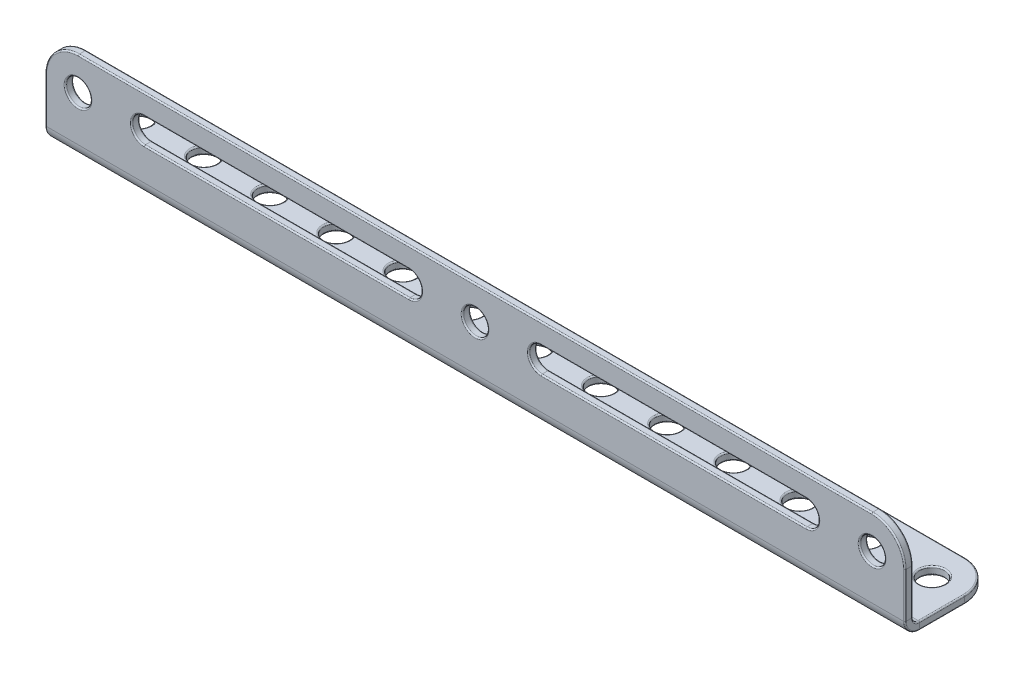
ISO-10303-21;
HEADER;
FILE_DESCRIPTION(('STEP AP214'),'2;1');
FILE_NAME('part.step','',(''),(''),'','','');
FILE_SCHEMA(('AUTOMOTIVE_DESIGN { 1 0 10303 214 1 1 1 1 }'));
ENDSEC;
DATA;
#1=APPLICATION_CONTEXT('core data for automotive mechanical design processes');
#2=APPLICATION_PROTOCOL_DEFINITION('international standard','automotive_design',2000,#1);
#3=PRODUCT_CONTEXT('',#1,'mechanical');
#4=PRODUCT('Part','Part','',(#3));
#5=PRODUCT_RELATED_PRODUCT_CATEGORY('part','',(#4));
#6=PRODUCT_DEFINITION_FORMATION('','',#4);
#7=PRODUCT_DEFINITION_CONTEXT('part definition',#1,'design');
#8=PRODUCT_DEFINITION('design','',#6,#7);
#9=PRODUCT_DEFINITION_SHAPE('','',#8);
#10=(LENGTH_UNIT() NAMED_UNIT(*) SI_UNIT(.MILLI.,.METRE.));
#11=(NAMED_UNIT(*) PLANE_ANGLE_UNIT() SI_UNIT($,.RADIAN.));
#12=(NAMED_UNIT(*) SI_UNIT($,.STERADIAN.) SOLID_ANGLE_UNIT());
#13=UNCERTAINTY_MEASURE_WITH_UNIT(LENGTH_MEASURE(1.E-05),#10,'distance_accuracy_value','');
#14=(GEOMETRIC_REPRESENTATION_CONTEXT(3) GLOBAL_UNCERTAINTY_ASSIGNED_CONTEXT((#13)) GLOBAL_UNIT_ASSIGNED_CONTEXT((#10,
#11,#12)) REPRESENTATION_CONTEXT('',''));
#15=CARTESIAN_POINT('',(0.,0.,0.));
#16=DIRECTION('',(0.,0.,1.));
#17=DIRECTION('',(1.,0.,0.));
#18=AXIS2_PLACEMENT_3D('',#15,#16,#17);
#19=CARTESIAN_POINT('',(6.35,11.43,-17.78));
#20=DIRECTION('',(0.,0.,1.));
#21=DIRECTION('',(0.,-1.,0.));
#22=AXIS2_PLACEMENT_3D('',#19,#20,#21);
#23=PLANE('',#22);
#24=CARTESIAN_POINT('',(158.6865,11.43,-17.7800000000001));
#25=DIRECTION('',(0.,0.,1.));
#26=DIRECTION('',(0.,-1.,0.));
#27=AXIS2_PLACEMENT_3D('',#24,#25,#26);
#28=CIRCLE('',#27,2.667);
#29=CARTESIAN_POINT('',(158.6865,8.76300000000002,-17.78));
#30=VERTEX_POINT('',#29);
#31=EDGE_CURVE('E383',#30,#30,#28,.F.);
#32=ORIENTED_EDGE('',*,*,#31,.T.);
#33=EDGE_LOOP('',(#32));
#34=FACE_BOUND('',#33,.T.);
#35=CARTESIAN_POINT('',(6.2865,11.43,-17.78));
#36=DIRECTION('',(0.,0.,1.));
#37=DIRECTION('',(0.,-1.,0.));
#38=AXIS2_PLACEMENT_3D('',#35,#36,#37);
#39=CIRCLE('',#38,2.66699999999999);
#40=CARTESIAN_POINT('',(6.2865,8.763,-17.78));
#41=VERTEX_POINT('',#40);
#42=EDGE_CURVE('E380',#41,#41,#39,.F.);
#43=ORIENTED_EDGE('',*,*,#42,.T.);
#44=EDGE_LOOP('',(#43));
#45=FACE_BOUND('',#44,.T.);
#46=DIRECTION('',(1.,0.,0.));
#47=VECTOR('',#46,1.);
#48=CARTESIAN_POINT('',(6.35,14.097,-17.78));
#49=LINE('',#48,#47);
#50=CARTESIAN_POINT('',(18.9865,14.097,-17.78));
#51=VERTEX_POINT('',#50);
#52=CARTESIAN_POINT('',(69.7865,14.097,-17.7800000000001));
#53=VERTEX_POINT('',#52);
#54=EDGE_CURVE('E375',#51,#53,#49,.T.);
#55=ORIENTED_EDGE('',*,*,#54,.T.);
#56=CARTESIAN_POINT('',(69.7865,11.43,-17.78));
#57=DIRECTION('',(0.,0.,1.));
#58=DIRECTION('',(0.,-1.,0.));
#59=AXIS2_PLACEMENT_3D('',#56,#57,#58);
#60=CIRCLE('',#59,2.667);
#61=CARTESIAN_POINT('',(69.7865,8.76300000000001,-17.78));
#62=VERTEX_POINT('',#61);
#63=EDGE_CURVE('E377',#53,#62,#60,.F.);
#64=ORIENTED_EDGE('',*,*,#63,.T.);
#65=DIRECTION('',(-1.,0.,0.));
#66=VECTOR('',#65,1.);
#67=CARTESIAN_POINT('',(6.35,8.763,-17.78));
#68=LINE('',#67,#66);
#69=CARTESIAN_POINT('',(18.9865,8.763,-17.78));
#70=VERTEX_POINT('',#69);
#71=EDGE_CURVE('E371',#62,#70,#68,.T.);
#72=ORIENTED_EDGE('',*,*,#71,.T.);
#73=CARTESIAN_POINT('',(18.9865,11.43,-17.78));
#74=DIRECTION('',(0.,0.,1.));
#75=DIRECTION('',(0.,-1.,0.));
#76=AXIS2_PLACEMENT_3D('',#73,#74,#75);
#77=CIRCLE('',#76,2.667);
#78=EDGE_CURVE('E373',#70,#51,#77,.F.);
#79=ORIENTED_EDGE('',*,*,#78,.T.);
#80=EDGE_LOOP('',(#55,#64,#72,#79));
#81=FACE_BOUND('',#80,.T.);
#82=DIRECTION('',(1.,0.,0.));
#83=VECTOR('',#82,1.);
#84=CARTESIAN_POINT('',(6.35,14.097,-17.78));
#85=LINE('',#84,#83);
#86=CARTESIAN_POINT('',(95.1865,14.097,-17.7800000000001));
#87=VERTEX_POINT('',#86);
#88=CARTESIAN_POINT('',(145.9865,14.097,-17.7800000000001));
#89=VERTEX_POINT('',#88);
#90=EDGE_CURVE('E366',#87,#89,#85,.T.);
#91=ORIENTED_EDGE('',*,*,#90,.T.);
#92=CARTESIAN_POINT('',(145.9865,11.43,-17.7800000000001));
#93=DIRECTION('',(0.,0.,1.));
#94=DIRECTION('',(0.,-1.,0.));
#95=AXIS2_PLACEMENT_3D('',#92,#93,#94);
#96=CIRCLE('',#95,2.667);
#97=CARTESIAN_POINT('',(145.9865,8.76300000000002,-17.78));
#98=VERTEX_POINT('',#97);
#99=EDGE_CURVE('E368',#89,#98,#96,.F.);
#100=ORIENTED_EDGE('',*,*,#99,.T.);
#101=DIRECTION('',(-1.,0.,0.));
#102=VECTOR('',#101,1.);
#103=CARTESIAN_POINT('',(6.35,8.763,-17.78));
#104=LINE('',#103,#102);
#105=CARTESIAN_POINT('',(95.1865,8.76300000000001,-17.78));
#106=VERTEX_POINT('',#105);
#107=EDGE_CURVE('E362',#98,#106,#104,.T.);
#108=ORIENTED_EDGE('',*,*,#107,.T.);
#109=CARTESIAN_POINT('',(95.1865,11.43,-17.78));
#110=DIRECTION('',(0.,0.,1.));
#111=DIRECTION('',(0.,-1.,0.));
#112=AXIS2_PLACEMENT_3D('',#109,#110,#111);
#113=CIRCLE('',#112,2.667);
#114=EDGE_CURVE('E364',#106,#87,#113,.F.);
#115=ORIENTED_EDGE('',*,*,#114,.T.);
#116=EDGE_LOOP('',(#91,#100,#108,#115));
#117=FACE_BOUND('',#116,.T.);
#118=CARTESIAN_POINT('',(82.4865,11.43,-17.78));
#119=DIRECTION('',(0.,0.,1.));
#120=DIRECTION('',(0.,-1.,0.));
#121=AXIS2_PLACEMENT_3D('',#118,#119,#120);
#122=CIRCLE('',#121,2.667);
#123=CARTESIAN_POINT('',(82.4865,8.76300000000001,-17.78));
#124=VERTEX_POINT('',#123);
#125=EDGE_CURVE('E353',#124,#124,#122,.F.);
#126=ORIENTED_EDGE('',*,*,#125,.T.);
#127=EDGE_LOOP('',(#126));
#128=FACE_BOUND('',#127,.T.);
#129=DIRECTION('',(1.,0.,0.));
#130=VECTOR('',#129,1.);
#131=CARTESIAN_POINT('',(6.35,2.79400000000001,-17.78));
#132=LINE('',#131,#130);
#133=CARTESIAN_POINT('',(0.254000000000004,2.79400000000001,-17.78));
#134=VERTEX_POINT('',#133);
#135=CARTESIAN_POINT('',(164.719,2.79400000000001,-17.78));
#136=VERTEX_POINT('',#135);
#137=EDGE_CURVE('E356',#134,#136,#132,.T.);
#138=ORIENTED_EDGE('',*,*,#137,.T.);
#139=DIRECTION('',(0.,-1.,0.));
#140=VECTOR('',#139,1.);
#141=CARTESIAN_POINT('',(164.719,11.43,-17.7800000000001));
#142=LINE('',#141,#140);
#143=CARTESIAN_POINT('',(164.719,11.43,-17.7800000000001));
#144=VERTEX_POINT('',#143);
#145=EDGE_CURVE('E323',#136,#144,#142,.F.);
#146=ORIENTED_EDGE('',*,*,#145,.T.);
#147=CARTESIAN_POINT('',(158.623,11.43,-17.7800000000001));
#148=DIRECTION('',(0.,0.,1.));
#149=DIRECTION('',(0.,-1.,0.));
#150=AXIS2_PLACEMENT_3D('',#147,#148,#149);
#151=CIRCLE('',#150,6.096);
#152=CARTESIAN_POINT('',(158.623,17.526,-17.7800000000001));
#153=VERTEX_POINT('',#152);
#154=EDGE_CURVE('E393',#144,#153,#151,.T.);
#155=ORIENTED_EDGE('',*,*,#154,.T.);
#156=DIRECTION('',(1.,0.,0.));
#157=VECTOR('',#156,1.);
#158=CARTESIAN_POINT('',(6.35000000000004,17.526,-17.7800000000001));
#159=LINE('',#158,#157);
#160=CARTESIAN_POINT('',(6.35000000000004,17.526,-17.7800000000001));
#161=VERTEX_POINT('',#160);
#162=EDGE_CURVE('E391',#153,#161,#159,.F.);
#163=ORIENTED_EDGE('',*,*,#162,.T.);
#164=CARTESIAN_POINT('',(6.35,11.43,-17.78));
#165=DIRECTION('',(0.,0.,1.));
#166=DIRECTION('',(0.,-1.,0.));
#167=AXIS2_PLACEMENT_3D('',#164,#165,#166);
#168=CIRCLE('',#167,6.096);
#169=CARTESIAN_POINT('',(0.254000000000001,11.43,-17.78));
#170=VERTEX_POINT('',#169);
#171=EDGE_CURVE('E388',#161,#170,#168,.T.);
#172=ORIENTED_EDGE('',*,*,#171,.T.);
#173=DIRECTION('',(0.,1.,0.));
#174=VECTOR('',#173,1.);
#175=CARTESIAN_POINT('',(0.254000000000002,2.79400000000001,-17.78));
#176=LINE('',#175,#174);
#177=EDGE_CURVE('E386',#170,#134,#176,.F.);
#178=ORIENTED_EDGE('',*,*,#177,.T.);
#179=EDGE_LOOP('',(#138,#146,#155,#163,#172,#178));
#180=FACE_BOUND('',#179,.T.);
#181=ADVANCED_FACE('F54',(#34,#45,#81,#117,#128,#180),#23,.T.);
#182=CARTESIAN_POINT('',(6.35,11.43,-19.304));
#183=DIRECTION('',(0.,0.,1.));
#184=DIRECTION('',(0.,-1.,0.));
#185=AXIS2_PLACEMENT_3D('',#182,#183,#184);
#186=PLANE('',#185);
#187=CARTESIAN_POINT('',(158.6865,11.43,-19.3040000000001));
#188=DIRECTION('',(0.,0.,1.));
#189=DIRECTION('',(0.,-1.,0.));
#190=AXIS2_PLACEMENT_3D('',#187,#188,#189);
#191=CIRCLE('',#190,2.667);
#192=CARTESIAN_POINT('',(158.6865,8.76300000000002,-19.304));
#193=VERTEX_POINT('',#192);
#194=EDGE_CURVE('E12',#193,#193,#191,.T.);
#195=ORIENTED_EDGE('',*,*,#194,.T.);
#196=EDGE_LOOP('',(#195));
#197=FACE_BOUND('',#196,.T.);
#198=CARTESIAN_POINT('',(6.2865,11.43,-19.304));
#199=DIRECTION('',(0.,0.,1.));
#200=DIRECTION('',(0.,-1.,0.));
#201=AXIS2_PLACEMENT_3D('',#198,#199,#200);
#202=CIRCLE('',#201,2.66699999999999);
#203=CARTESIAN_POINT('',(6.2865,8.763,-19.304));
#204=VERTEX_POINT('',#203);
#205=EDGE_CURVE('E62',#204,#204,#202,.T.);
#206=ORIENTED_EDGE('',*,*,#205,.T.);
#207=EDGE_LOOP('',(#206));
#208=FACE_BOUND('',#207,.T.);
#209=CARTESIAN_POINT('',(69.7865,11.43,-19.304));
#210=DIRECTION('',(0.,0.,1.));
#211=DIRECTION('',(0.,-1.,0.));
#212=AXIS2_PLACEMENT_3D('',#209,#210,#211);
#213=CIRCLE('',#212,2.667);
#214=CARTESIAN_POINT('',(69.7865,8.763,-19.304));
#215=VERTEX_POINT('',#214);
#216=CARTESIAN_POINT('',(69.7865,14.097,-19.3040000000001));
#217=VERTEX_POINT('',#216);
#218=EDGE_CURVE('E69',#215,#217,#213,.T.);
#219=ORIENTED_EDGE('',*,*,#218,.T.);
#220=DIRECTION('',(1.,0.,0.));
#221=VECTOR('',#220,1.);
#222=CARTESIAN_POINT('',(18.9865,14.097,-19.304));
#223=LINE('',#222,#221);
#224=CARTESIAN_POINT('',(18.9865,14.097,-19.304));
#225=VERTEX_POINT('',#224);
#226=EDGE_CURVE('E710',#217,#225,#223,.F.);
#227=ORIENTED_EDGE('',*,*,#226,.T.);
#228=CARTESIAN_POINT('',(18.9865,11.43,-19.304));
#229=DIRECTION('',(0.,0.,1.));
#230=DIRECTION('',(0.,-1.,0.));
#231=AXIS2_PLACEMENT_3D('',#228,#229,#230);
#232=CIRCLE('',#231,2.667);
#233=CARTESIAN_POINT('',(18.9865,8.763,-19.304));
#234=VERTEX_POINT('',#233);
#235=EDGE_CURVE('E706',#225,#234,#232,.T.);
#236=ORIENTED_EDGE('',*,*,#235,.T.);
#237=DIRECTION('',(-1.,0.,0.));
#238=VECTOR('',#237,1.);
#239=CARTESIAN_POINT('',(69.7865,8.763,-19.304));
#240=LINE('',#239,#238);
#241=EDGE_CURVE('E74',#234,#215,#240,.F.);
#242=ORIENTED_EDGE('',*,*,#241,.T.);
#243=EDGE_LOOP('',(#219,#227,#236,#242));
#244=FACE_BOUND('',#243,.T.);
#245=CARTESIAN_POINT('',(145.9865,11.43,-19.3040000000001));
#246=DIRECTION('',(0.,0.,1.));
#247=DIRECTION('',(0.,-1.,0.));
#248=AXIS2_PLACEMENT_3D('',#245,#246,#247);
#249=CIRCLE('',#248,2.667);
#250=CARTESIAN_POINT('',(145.9865,8.76300000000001,-19.304));
#251=VERTEX_POINT('',#250);
#252=CARTESIAN_POINT('',(145.9865,14.097,-19.3040000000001));
#253=VERTEX_POINT('',#252);
#254=EDGE_CURVE('E701',#251,#253,#249,.T.);
#255=ORIENTED_EDGE('',*,*,#254,.T.);
#256=DIRECTION('',(1.,0.,0.));
#257=VECTOR('',#256,1.);
#258=CARTESIAN_POINT('',(95.1865,14.097,-19.3040000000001));
#259=LINE('',#258,#257);
#260=CARTESIAN_POINT('',(95.1865,14.097,-19.3040000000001));
#261=VERTEX_POINT('',#260);
#262=EDGE_CURVE('E703',#253,#261,#259,.F.);
#263=ORIENTED_EDGE('',*,*,#262,.T.);
#264=CARTESIAN_POINT('',(95.1865,11.43,-19.304));
#265=DIRECTION('',(0.,0.,1.));
#266=DIRECTION('',(0.,-1.,0.));
#267=AXIS2_PLACEMENT_3D('',#264,#265,#266);
#268=CIRCLE('',#267,2.667);
#269=CARTESIAN_POINT('',(95.1865,8.76300000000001,-19.304));
#270=VERTEX_POINT('',#269);
#271=EDGE_CURVE('E697',#261,#270,#268,.T.);
#272=ORIENTED_EDGE('',*,*,#271,.T.);
#273=DIRECTION('',(-1.,0.,0.));
#274=VECTOR('',#273,1.);
#275=CARTESIAN_POINT('',(145.9865,8.76300000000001,-19.304));
#276=LINE('',#275,#274);
#277=EDGE_CURVE('E699',#270,#251,#276,.F.);
#278=ORIENTED_EDGE('',*,*,#277,.T.);
#279=EDGE_LOOP('',(#255,#263,#272,#278));
#280=FACE_BOUND('',#279,.T.);
#281=CARTESIAN_POINT('',(82.4865,11.43,-19.304));
#282=DIRECTION('',(0.,0.,1.));
#283=DIRECTION('',(0.,-1.,0.));
#284=AXIS2_PLACEMENT_3D('',#281,#282,#283);
#285=CIRCLE('',#284,2.667);
#286=CARTESIAN_POINT('',(82.4865,8.76300000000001,-19.304));
#287=VERTEX_POINT('',#286);
#288=EDGE_CURVE('E694',#287,#287,#285,.T.);
#289=ORIENTED_EDGE('',*,*,#288,.T.);
#290=EDGE_LOOP('',(#289));
#291=FACE_BOUND('',#290,.T.);
#292=CARTESIAN_POINT('',(158.623,11.43,-19.3040000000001));
#293=DIRECTION('',(0.,0.,1.));
#294=DIRECTION('',(0.,-1.,0.));
#295=AXIS2_PLACEMENT_3D('',#292,#293,#294);
#296=CIRCLE('',#295,6.096);
#297=CARTESIAN_POINT('',(158.623,17.526,-19.3040000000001));
#298=VERTEX_POINT('',#297);
#299=CARTESIAN_POINT('',(164.719,11.43,-19.3040000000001));
#300=VERTEX_POINT('',#299);
#301=EDGE_CURVE('E690',#298,#300,#296,.F.);
#302=ORIENTED_EDGE('',*,*,#301,.T.);
#303=DIRECTION('',(0.,-1.,0.));
#304=VECTOR('',#303,1.);
#305=CARTESIAN_POINT('',(164.719,11.43,-19.3040000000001));
#306=LINE('',#305,#304);
#307=CARTESIAN_POINT('',(164.719,2.794,-19.304));
#308=VERTEX_POINT('',#307);
#309=EDGE_CURVE('E692',#300,#308,#306,.T.);
#310=ORIENTED_EDGE('',*,*,#309,.T.);
#311=DIRECTION('',(1.,0.,0.));
#312=VECTOR('',#311,1.);
#313=CARTESIAN_POINT('',(6.35,2.794,-19.304));
#314=LINE('',#313,#312);
#315=CARTESIAN_POINT('',(0.254000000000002,2.794,-19.304));
#316=VERTEX_POINT('',#315);
#317=EDGE_CURVE('E334',#316,#308,#314,.T.);
#318=ORIENTED_EDGE('',*,*,#317,.F.);
#319=DIRECTION('',(0.,1.,0.));
#320=VECTOR('',#319,1.);
#321=CARTESIAN_POINT('',(0.254000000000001,11.43,-19.304));
#322=LINE('',#321,#320);
#323=CARTESIAN_POINT('',(0.254000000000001,11.4299999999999,-19.304));
#324=VERTEX_POINT('',#323);
#325=EDGE_CURVE('E685',#316,#324,#322,.T.);
#326=ORIENTED_EDGE('',*,*,#325,.T.);
#327=CARTESIAN_POINT('',(6.35,11.43,-19.304));
#328=DIRECTION('',(0.,0.,1.));
#329=DIRECTION('',(0.,-1.,0.));
#330=AXIS2_PLACEMENT_3D('',#327,#328,#329);
#331=CIRCLE('',#330,6.096);
#332=CARTESIAN_POINT('',(6.35000000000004,17.526,-19.3040000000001));
#333=VERTEX_POINT('',#332);
#334=EDGE_CURVE('E687',#324,#333,#331,.F.);
#335=ORIENTED_EDGE('',*,*,#334,.T.);
#336=DIRECTION('',(1.,0.,0.));
#337=VECTOR('',#336,1.);
#338=CARTESIAN_POINT('',(6.35,17.526,-19.3040000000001));
#339=LINE('',#338,#337);
#340=EDGE_CURVE('E340',#333,#298,#339,.T.);
#341=ORIENTED_EDGE('',*,*,#340,.T.);
#342=EDGE_LOOP('',(#302,#310,#318,#326,#335,#341));
#343=FACE_BOUND('',#342,.T.);
#344=ADVANCED_FACE('F714',(#197,#208,#244,#280,#291,#343),#186,.F.);
#345=CARTESIAN_POINT('',(6.35,11.43,-19.304));
#346=DIRECTION('',(0.,0.,1.));
#347=DIRECTION('',(0.,-1.,0.));
#348=AXIS2_PLACEMENT_3D('',#345,#346,#347);
#349=CYLINDRICAL_SURFACE('',#348,6.35);
#350=DIRECTION('',(0.,0.,1.));
#351=VECTOR('',#350,1.);
#352=CARTESIAN_POINT('',(0.,11.4299999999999,-19.304));
#353=LINE('',#352,#351);
#354=CARTESIAN_POINT('',(0.,11.4299999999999,-19.05));
#355=VERTEX_POINT('',#354);
#356=CARTESIAN_POINT('',(0.,11.43,-18.034));
#357=VERTEX_POINT('',#356);
#358=EDGE_CURVE('E912',#355,#357,#353,.T.);
#359=ORIENTED_EDGE('',*,*,#358,.T.);
#360=CARTESIAN_POINT('',(6.35,11.43,-18.034));
#361=DIRECTION('',(0.,0.,1.));
#362=DIRECTION('',(0.,-1.,0.));
#363=AXIS2_PLACEMENT_3D('',#360,#361,#362);
#364=CIRCLE('',#363,6.35);
#365=CARTESIAN_POINT('',(6.35000000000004,17.78,-18.0340000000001));
#366=VERTEX_POINT('',#365);
#367=EDGE_CURVE('E333',#357,#366,#364,.F.);
#368=ORIENTED_EDGE('',*,*,#367,.T.);
#369=DIRECTION('',(0.,0.,1.));
#370=VECTOR('',#369,1.);
#371=CARTESIAN_POINT('',(6.35000000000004,17.78,-19.3040000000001));
#372=LINE('',#371,#370);
#373=CARTESIAN_POINT('',(6.35000000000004,17.78,-19.0500000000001));
#374=VERTEX_POINT('',#373);
#375=EDGE_CURVE('E315',#374,#366,#372,.T.);
#376=ORIENTED_EDGE('',*,*,#375,.F.);
#377=CARTESIAN_POINT('',(6.35,11.43,-19.05));
#378=DIRECTION('',(0.,0.,1.));
#379=DIRECTION('',(0.,-1.,0.));
#380=AXIS2_PLACEMENT_3D('',#377,#378,#379);
#381=CIRCLE('',#380,6.35);
#382=EDGE_CURVE('E330',#374,#355,#381,.T.);
#383=ORIENTED_EDGE('',*,*,#382,.T.);
#384=EDGE_LOOP('',(#359,#368,#376,#383));
#385=FACE_BOUND('',#384,.T.);
#386=ADVANCED_FACE('F328',(#385),#349,.T.);
#387=CARTESIAN_POINT('',(6.35000000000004,17.78,-19.3040000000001));
#388=DIRECTION('',(0.,-1.,0.));
#389=DIRECTION('',(-1.,0.,0.));
#390=AXIS2_PLACEMENT_3D('',#387,#388,#389);
#391=PLANE('',#390);
#392=ORIENTED_EDGE('',*,*,#375,.T.);
#393=DIRECTION('',(1.,0.,0.));
#394=VECTOR('',#393,1.);
#395=CARTESIAN_POINT('',(158.623,17.78,-18.0340000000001));
#396=LINE('',#395,#394);
#397=CARTESIAN_POINT('',(158.623,17.78,-18.0340000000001));
#398=VERTEX_POINT('',#397);
#399=EDGE_CURVE('E322',#366,#398,#396,.T.);
#400=ORIENTED_EDGE('',*,*,#399,.T.);
#401=DIRECTION('',(0.,0.,1.));
#402=VECTOR('',#401,1.);
#403=CARTESIAN_POINT('',(158.623,17.78,-19.3040000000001));
#404=LINE('',#403,#402);
#405=CARTESIAN_POINT('',(158.623,17.78,-19.0500000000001));
#406=VERTEX_POINT('',#405);
#407=EDGE_CURVE('E317',#406,#398,#404,.T.);
#408=ORIENTED_EDGE('',*,*,#407,.F.);
#409=DIRECTION('',(1.,0.,0.));
#410=VECTOR('',#409,1.);
#411=CARTESIAN_POINT('',(6.35000000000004,17.78,-19.0500000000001));
#412=LINE('',#411,#410);
#413=EDGE_CURVE('E312',#406,#374,#412,.F.);
#414=ORIENTED_EDGE('',*,*,#413,.T.);
#415=EDGE_LOOP('',(#392,#400,#408,#414));
#416=FACE_BOUND('',#415,.T.);
#417=ADVANCED_FACE('F314',(#416),#391,.F.);
#418=CARTESIAN_POINT('',(158.623,11.43,-19.3040000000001));
#419=DIRECTION('',(0.,0.,1.));
#420=DIRECTION('',(0.,-1.,0.));
#421=AXIS2_PLACEMENT_3D('',#418,#419,#420);
#422=CYLINDRICAL_SURFACE('',#421,6.35);
#423=ORIENTED_EDGE('',*,*,#407,.T.);
#424=CARTESIAN_POINT('',(158.623,11.43,-18.0340000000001));
#425=DIRECTION('',(0.,0.,1.));
#426=DIRECTION('',(0.,-1.,0.));
#427=AXIS2_PLACEMENT_3D('',#424,#425,#426);
#428=CIRCLE('',#427,6.35);
#429=CARTESIAN_POINT('',(164.973,11.43,-18.0340000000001));
#430=VERTEX_POINT('',#429);
#431=EDGE_CURVE('E399',#398,#430,#428,.F.);
#432=ORIENTED_EDGE('',*,*,#431,.T.);
#433=DIRECTION('',(0.,0.,1.));
#434=VECTOR('',#433,1.);
#435=CARTESIAN_POINT('',(164.973,11.43,-19.3040000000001));
#436=LINE('',#435,#434);
#437=CARTESIAN_POINT('',(164.973,11.43,-19.0500000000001));
#438=VERTEX_POINT('',#437);
#439=EDGE_CURVE('E914',#438,#430,#436,.T.);
#440=ORIENTED_EDGE('',*,*,#439,.F.);
#441=CARTESIAN_POINT('',(158.623,11.43,-19.0500000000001));
#442=DIRECTION('',(0.,0.,1.));
#443=DIRECTION('',(0.,-1.,0.));
#444=AXIS2_PLACEMENT_3D('',#441,#442,#443);
#445=CIRCLE('',#444,6.35);
#446=EDGE_CURVE('E397',#438,#406,#445,.T.);
#447=ORIENTED_EDGE('',*,*,#446,.T.);
#448=EDGE_LOOP('',(#423,#432,#440,#447));
#449=FACE_BOUND('',#448,.T.);
#450=ADVANCED_FACE('F751',(#449),#422,.T.);
#451=CARTESIAN_POINT('',(164.973,11.43,-19.3040000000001));
#452=DIRECTION('',(-1.,0.,0.));
#453=DIRECTION('',(0.,1.,0.));
#454=AXIS2_PLACEMENT_3D('',#451,#452,#453);
#455=PLANE('',#454);
#456=ORIENTED_EDGE('',*,*,#439,.T.);
#457=DIRECTION('',(0.,-1.,0.));
#458=VECTOR('',#457,1.);
#459=CARTESIAN_POINT('',(164.973,2.79400000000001,-18.034));
#460=LINE('',#459,#458);
#461=CARTESIAN_POINT('',(164.973,2.79400000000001,-18.0340000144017));
#462=VERTEX_POINT('',#461);
#463=EDGE_CURVE('E403',#430,#462,#460,.T.);
#464=ORIENTED_EDGE('',*,*,#463,.T.);
#465=DIRECTION('',(0.,0.,1.));
#466=VECTOR('',#465,1.);
#467=CARTESIAN_POINT('',(164.973,2.794,-19.304));
#468=LINE('',#467,#466);
#469=CARTESIAN_POINT('',(164.973,2.79400000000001,-19.05));
#470=VERTEX_POINT('',#469);
#471=EDGE_CURVE('E920',#470,#462,#468,.T.);
#472=ORIENTED_EDGE('',*,*,#471,.F.);
#473=DIRECTION('',(0.,-1.,0.));
#474=VECTOR('',#473,1.);
#475=CARTESIAN_POINT('',(164.973,11.43,-19.0500000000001));
#476=LINE('',#475,#474);
#477=EDGE_CURVE('E401',#470,#438,#476,.F.);
#478=ORIENTED_EDGE('',*,*,#477,.T.);
#479=EDGE_LOOP('',(#456,#464,#472,#478));
#480=FACE_BOUND('',#479,.T.);
#481=ADVANCED_FACE('F749',(#480),#455,.F.);
#482=CARTESIAN_POINT('',(0.,11.4299999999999,-19.304));
#483=DIRECTION('',(1.,0.,0.));
#484=DIRECTION('',(0.,-1.,0.));
#485=AXIS2_PLACEMENT_3D('',#482,#483,#484);
#486=PLANE('',#485);
#487=DIRECTION('',(0.,0.,-1.));
#488=VECTOR('',#487,1.);
#489=CARTESIAN_POINT('',(0.,2.794,-19.304));
#490=LINE('',#489,#488);
#491=CARTESIAN_POINT('',(0.,2.79400000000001,-18.0340000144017));
#492=VERTEX_POINT('',#491);
#493=CARTESIAN_POINT('',(0.,2.79400000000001,-19.05));
#494=VERTEX_POINT('',#493);
#495=EDGE_CURVE('E351',#492,#494,#490,.T.);
#496=ORIENTED_EDGE('',*,*,#495,.F.);
#497=DIRECTION('',(0.,1.,0.));
#498=VECTOR('',#497,1.);
#499=CARTESIAN_POINT('',(0.,11.43,-18.034));
#500=LINE('',#499,#498);
#501=EDGE_CURVE('E407',#492,#357,#500,.T.);
#502=ORIENTED_EDGE('',*,*,#501,.T.);
#503=ORIENTED_EDGE('',*,*,#358,.F.);
#504=DIRECTION('',(0.,1.,0.));
#505=VECTOR('',#504,1.);
#506=CARTESIAN_POINT('',(0.,11.4299999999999,-19.05));
#507=LINE('',#506,#505);
#508=EDGE_CURVE('E405',#355,#494,#507,.F.);
#509=ORIENTED_EDGE('',*,*,#508,.T.);
#510=EDGE_LOOP('',(#496,#502,#503,#509));
#511=FACE_BOUND('',#510,.T.);
#512=ADVANCED_FACE('F56',(#511),#486,.F.);
#513=CARTESIAN_POINT('',(18.9865,11.43,-19.304));
#514=DIRECTION('',(0.,0.,1.));
#515=DIRECTION('',(0.,-1.,0.));
#516=AXIS2_PLACEMENT_3D('',#513,#514,#515);
#517=CYLINDRICAL_SURFACE('',#516,2.413);
#518=DIRECTION('',(0.,0.,1.));
#519=VECTOR('',#518,1.);
#520=CARTESIAN_POINT('',(18.9865,13.843,-19.304));
#521=LINE('',#520,#519);
#522=CARTESIAN_POINT('',(18.9865,13.843,-19.05));
#523=VERTEX_POINT('',#522);
#524=CARTESIAN_POINT('',(18.9865,13.843,-18.034));
#525=VERTEX_POINT('',#524);
#526=EDGE_CURVE('E909',#523,#525,#521,.T.);
#527=ORIENTED_EDGE('',*,*,#526,.T.);
#528=CARTESIAN_POINT('',(18.9865,11.43,-18.034));
#529=DIRECTION('',(0.,0.,1.));
#530=DIRECTION('',(0.,-1.,0.));
#531=AXIS2_PLACEMENT_3D('',#528,#529,#530);
#532=CIRCLE('',#531,2.413);
#533=CARTESIAN_POINT('',(18.9865,9.017,-18.034));
#534=VERTEX_POINT('',#533);
#535=EDGE_CURVE('E433',#525,#534,#532,.T.);
#536=ORIENTED_EDGE('',*,*,#535,.T.);
#537=DIRECTION('',(0.,0.,1.));
#538=VECTOR('',#537,1.);
#539=CARTESIAN_POINT('',(18.9865,9.01699999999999,-19.304));
#540=LINE('',#539,#538);
#541=CARTESIAN_POINT('',(18.9865,9.017,-19.05));
#542=VERTEX_POINT('',#541);
#543=EDGE_CURVE('E900',#542,#534,#540,.T.);
#544=ORIENTED_EDGE('',*,*,#543,.F.);
#545=CARTESIAN_POINT('',(18.9865,11.43,-19.05));
#546=DIRECTION('',(0.,0.,1.));
#547=DIRECTION('',(0.,-1.,0.));
#548=AXIS2_PLACEMENT_3D('',#545,#546,#547);
#549=CIRCLE('',#548,2.413);
#550=EDGE_CURVE('E431',#542,#523,#549,.F.);
#551=ORIENTED_EDGE('',*,*,#550,.T.);
#552=EDGE_LOOP('',(#527,#536,#544,#551));
#553=FACE_BOUND('',#552,.T.);
#554=ADVANCED_FACE('F761',(#553),#517,.F.);
#555=CARTESIAN_POINT('',(18.9865,13.843,-19.304));
#556=DIRECTION('',(0.,-1.,0.));
#557=DIRECTION('',(-1.,0.,0.));
#558=AXIS2_PLACEMENT_3D('',#555,#556,#557);
#559=PLANE('',#558);
#560=DIRECTION('',(0.,0.,1.));
#561=VECTOR('',#560,1.);
#562=CARTESIAN_POINT('',(69.7865,13.843,-19.3040000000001));
#563=LINE('',#562,#561);
#564=CARTESIAN_POINT('',(69.7865,13.843,-19.0500000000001));
#565=VERTEX_POINT('',#564);
#566=CARTESIAN_POINT('',(69.7865,13.843,-18.0340000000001));
#567=VERTEX_POINT('',#566);
#568=EDGE_CURVE('E906',#565,#567,#563,.T.);
#569=ORIENTED_EDGE('',*,*,#568,.T.);
#570=DIRECTION('',(1.,0.,0.));
#571=VECTOR('',#570,1.);
#572=CARTESIAN_POINT('',(18.9865,13.843,-18.034));
#573=LINE('',#572,#571);
#574=EDGE_CURVE('E429',#567,#525,#573,.F.);
#575=ORIENTED_EDGE('',*,*,#574,.T.);
#576=ORIENTED_EDGE('',*,*,#526,.F.);
#577=DIRECTION('',(1.,0.,0.));
#578=VECTOR('',#577,1.);
#579=CARTESIAN_POINT('',(69.7865,13.843,-19.0500000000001));
#580=LINE('',#579,#578);
#581=EDGE_CURVE('E426',#523,#565,#580,.T.);
#582=ORIENTED_EDGE('',*,*,#581,.T.);
#583=EDGE_LOOP('',(#569,#575,#576,#582));
#584=FACE_BOUND('',#583,.T.);
#585=ADVANCED_FACE('F764',(#584),#559,.T.);
#586=CARTESIAN_POINT('',(69.7865,11.43,-19.304));
#587=DIRECTION('',(0.,0.,1.));
#588=DIRECTION('',(0.,-1.,0.));
#589=AXIS2_PLACEMENT_3D('',#586,#587,#588);
#590=CYLINDRICAL_SURFACE('',#589,2.413);
#591=DIRECTION('',(0.,0.,1.));
#592=VECTOR('',#591,1.);
#593=CARTESIAN_POINT('',(69.7865,9.017,-19.304));
#594=LINE('',#593,#592);
#595=CARTESIAN_POINT('',(69.7865,9.017,-19.05));
#596=VERTEX_POINT('',#595);
#597=CARTESIAN_POINT('',(69.7865,9.01700000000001,-18.034));
#598=VERTEX_POINT('',#597);
#599=EDGE_CURVE('E903',#596,#598,#594,.T.);
#600=ORIENTED_EDGE('',*,*,#599,.T.);
#601=CARTESIAN_POINT('',(69.7865,11.43,-18.034));
#602=DIRECTION('',(0.,0.,1.));
#603=DIRECTION('',(0.,-1.,0.));
#604=AXIS2_PLACEMENT_3D('',#601,#602,#603);
#605=CIRCLE('',#604,2.413);
#606=EDGE_CURVE('E423',#598,#567,#605,.T.);
#607=ORIENTED_EDGE('',*,*,#606,.T.);
#608=ORIENTED_EDGE('',*,*,#568,.F.);
#609=CARTESIAN_POINT('',(69.7865,11.43,-19.05));
#610=DIRECTION('',(0.,0.,1.));
#611=DIRECTION('',(0.,-1.,0.));
#612=AXIS2_PLACEMENT_3D('',#609,#610,#611);
#613=CIRCLE('',#612,2.413);
#614=EDGE_CURVE('E421',#565,#596,#613,.F.);
#615=ORIENTED_EDGE('',*,*,#614,.T.);
#616=EDGE_LOOP('',(#600,#607,#608,#615));
#617=FACE_BOUND('',#616,.T.);
#618=ADVANCED_FACE('F768',(#617),#590,.F.);
#619=CARTESIAN_POINT('',(18.9865,9.01699999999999,-19.304));
#620=DIRECTION('',(0.,1.,0.));
#621=DIRECTION('',(1.,0.,0.));
#622=AXIS2_PLACEMENT_3D('',#619,#620,#621);
#623=PLANE('',#622);
#624=ORIENTED_EDGE('',*,*,#543,.T.);
#625=DIRECTION('',(-1.,0.,0.));
#626=VECTOR('',#625,1.);
#627=CARTESIAN_POINT('',(18.9865,9.017,-18.034));
#628=LINE('',#627,#626);
#629=EDGE_CURVE('E437',#534,#598,#628,.F.);
#630=ORIENTED_EDGE('',*,*,#629,.T.);
#631=ORIENTED_EDGE('',*,*,#599,.F.);
#632=DIRECTION('',(-1.,0.,0.));
#633=VECTOR('',#632,1.);
#634=CARTESIAN_POINT('',(18.9865,9.017,-19.05));
#635=LINE('',#634,#633);
#636=EDGE_CURVE('E435',#596,#542,#635,.T.);
#637=ORIENTED_EDGE('',*,*,#636,.T.);
#638=EDGE_LOOP('',(#624,#630,#631,#637));
#639=FACE_BOUND('',#638,.T.);
#640=ADVANCED_FACE('F772',(#639),#623,.T.);
#641=CARTESIAN_POINT('',(95.1865,11.43,-19.304));
#642=DIRECTION('',(0.,0.,1.));
#643=DIRECTION('',(0.,-1.,0.));
#644=AXIS2_PLACEMENT_3D('',#641,#642,#643);
#645=CYLINDRICAL_SURFACE('',#644,2.413);
#646=DIRECTION('',(0.,0.,1.));
#647=VECTOR('',#646,1.);
#648=CARTESIAN_POINT('',(95.1865,13.843,-19.3040000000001));
#649=LINE('',#648,#647);
#650=CARTESIAN_POINT('',(95.1865,13.843,-19.0500000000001));
#651=VERTEX_POINT('',#650);
#652=CARTESIAN_POINT('',(95.1865,13.843,-18.0340000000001));
#653=VERTEX_POINT('',#652);
#654=EDGE_CURVE('E897',#651,#653,#649,.T.);
#655=ORIENTED_EDGE('',*,*,#654,.T.);
#656=CARTESIAN_POINT('',(95.1865,11.43,-18.034));
#657=DIRECTION('',(0.,0.,1.));
#658=DIRECTION('',(0.,-1.,0.));
#659=AXIS2_PLACEMENT_3D('',#656,#657,#658);
#660=CIRCLE('',#659,2.413);
#661=CARTESIAN_POINT('',(95.1865,9.01700000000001,-18.034));
#662=VERTEX_POINT('',#661);
#663=EDGE_CURVE('E451',#653,#662,#660,.T.);
#664=ORIENTED_EDGE('',*,*,#663,.T.);
#665=DIRECTION('',(0.,0.,1.));
#666=VECTOR('',#665,1.);
#667=CARTESIAN_POINT('',(95.1865,9.017,-19.304));
#668=LINE('',#667,#666);
#669=CARTESIAN_POINT('',(95.1865,9.01700000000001,-19.05));
#670=VERTEX_POINT('',#669);
#671=EDGE_CURVE('E798',#670,#662,#668,.T.);
#672=ORIENTED_EDGE('',*,*,#671,.F.);
#673=CARTESIAN_POINT('',(95.1865,11.43,-19.05));
#674=DIRECTION('',(0.,0.,1.));
#675=DIRECTION('',(0.,-1.,0.));
#676=AXIS2_PLACEMENT_3D('',#673,#674,#675);
#677=CIRCLE('',#676,2.413);
#678=EDGE_CURVE('E449',#670,#651,#677,.F.);
#679=ORIENTED_EDGE('',*,*,#678,.T.);
#680=EDGE_LOOP('',(#655,#664,#672,#679));
#681=FACE_BOUND('',#680,.T.);
#682=ADVANCED_FACE('F776',(#681),#645,.F.);
#683=CARTESIAN_POINT('',(95.1865,13.843,-19.3040000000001));
#684=DIRECTION('',(0.,-1.,0.));
#685=DIRECTION('',(-1.,0.,0.));
#686=AXIS2_PLACEMENT_3D('',#683,#684,#685);
#687=PLANE('',#686);
#688=DIRECTION('',(0.,0.,1.));
#689=VECTOR('',#688,1.);
#690=CARTESIAN_POINT('',(145.9865,13.843,-19.3040000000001));
#691=LINE('',#690,#689);
#692=CARTESIAN_POINT('',(145.9865,13.843,-19.0500000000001));
#693=VERTEX_POINT('',#692);
#694=CARTESIAN_POINT('',(145.9865,13.843,-18.0340000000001));
#695=VERTEX_POINT('',#694);
#696=EDGE_CURVE('E797',#693,#695,#691,.T.);
#697=ORIENTED_EDGE('',*,*,#696,.T.);
#698=DIRECTION('',(1.,0.,0.));
#699=VECTOR('',#698,1.);
#700=CARTESIAN_POINT('',(95.1865,13.843,-18.0340000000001));
#701=LINE('',#700,#699);
#702=EDGE_CURVE('E447',#695,#653,#701,.F.);
#703=ORIENTED_EDGE('',*,*,#702,.T.);
#704=ORIENTED_EDGE('',*,*,#654,.F.);
#705=DIRECTION('',(1.,0.,0.));
#706=VECTOR('',#705,1.);
#707=CARTESIAN_POINT('',(145.9865,13.843,-19.0500000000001));
#708=LINE('',#707,#706);
#709=EDGE_CURVE('E444',#651,#693,#708,.T.);
#710=ORIENTED_EDGE('',*,*,#709,.T.);
#711=EDGE_LOOP('',(#697,#703,#704,#710));
#712=FACE_BOUND('',#711,.T.);
#713=ADVANCED_FACE('F780',(#712),#687,.T.);
#714=CARTESIAN_POINT('',(145.9865,11.43,-19.3040000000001));
#715=DIRECTION('',(0.,0.,1.));
#716=DIRECTION('',(0.,-1.,0.));
#717=AXIS2_PLACEMENT_3D('',#714,#715,#716);
#718=CYLINDRICAL_SURFACE('',#717,2.413);
#719=DIRECTION('',(0.,0.,1.));
#720=VECTOR('',#719,1.);
#721=CARTESIAN_POINT('',(145.9865,9.01700000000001,-19.304));
#722=LINE('',#721,#720);
#723=CARTESIAN_POINT('',(145.9865,9.01700000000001,-19.05));
#724=VERTEX_POINT('',#723);
#725=CARTESIAN_POINT('',(145.9865,9.01700000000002,-18.034));
#726=VERTEX_POINT('',#725);
#727=EDGE_CURVE('E791',#724,#726,#722,.T.);
#728=ORIENTED_EDGE('',*,*,#727,.T.);
#729=CARTESIAN_POINT('',(145.9865,11.43,-18.0340000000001));
#730=DIRECTION('',(0.,0.,1.));
#731=DIRECTION('',(0.,-1.,0.));
#732=AXIS2_PLACEMENT_3D('',#729,#730,#731);
#733=CIRCLE('',#732,2.413);
#734=EDGE_CURVE('E441',#726,#695,#733,.T.);
#735=ORIENTED_EDGE('',*,*,#734,.T.);
#736=ORIENTED_EDGE('',*,*,#696,.F.);
#737=CARTESIAN_POINT('',(145.9865,11.43,-19.0500000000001));
#738=DIRECTION('',(0.,0.,1.));
#739=DIRECTION('',(0.,-1.,0.));
#740=AXIS2_PLACEMENT_3D('',#737,#738,#739);
#741=CIRCLE('',#740,2.413);
#742=EDGE_CURVE('E439',#693,#724,#741,.F.);
#743=ORIENTED_EDGE('',*,*,#742,.T.);
#744=EDGE_LOOP('',(#728,#735,#736,#743));
#745=FACE_BOUND('',#744,.T.);
#746=ADVANCED_FACE('F737',(#745),#718,.F.);
#747=CARTESIAN_POINT('',(95.1865,9.017,-19.304));
#748=DIRECTION('',(0.,1.,0.));
#749=DIRECTION('',(1.,0.,0.));
#750=AXIS2_PLACEMENT_3D('',#747,#748,#749);
#751=PLANE('',#750);
#752=ORIENTED_EDGE('',*,*,#671,.T.);
#753=DIRECTION('',(-1.,0.,0.));
#754=VECTOR('',#753,1.);
#755=CARTESIAN_POINT('',(95.1865,9.01700000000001,-18.034));
#756=LINE('',#755,#754);
#757=EDGE_CURVE('E455',#662,#726,#756,.F.);
#758=ORIENTED_EDGE('',*,*,#757,.T.);
#759=ORIENTED_EDGE('',*,*,#727,.F.);
#760=DIRECTION('',(-1.,0.,0.));
#761=VECTOR('',#760,1.);
#762=CARTESIAN_POINT('',(95.1865,9.01700000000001,-19.05));
#763=LINE('',#762,#761);
#764=EDGE_CURVE('E453',#724,#670,#763,.T.);
#765=ORIENTED_EDGE('',*,*,#764,.T.);
#766=EDGE_LOOP('',(#752,#758,#759,#765));
#767=FACE_BOUND('',#766,.T.);
#768=ADVANCED_FACE('F727',(#767),#751,.T.);
#769=CARTESIAN_POINT('',(6.2865,11.43,-19.304));
#770=DIRECTION('',(0.,0.,1.));
#771=DIRECTION('',(0.,-1.,0.));
#772=AXIS2_PLACEMENT_3D('',#769,#770,#771);
#773=CYLINDRICAL_SURFACE('',#772,2.41299999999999);
#774=CARTESIAN_POINT('',(6.2865,11.43,-18.034));
#775=DIRECTION('',(0.,0.,1.));
#776=DIRECTION('',(0.,-1.,0.));
#777=AXIS2_PLACEMENT_3D('',#774,#775,#776);
#778=CIRCLE('',#777,2.41299999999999);
#779=CARTESIAN_POINT('',(6.2865,9.017,-18.034));
#780=VERTEX_POINT('',#779);
#781=EDGE_CURVE('E418',#780,#780,#778,.T.);
#782=CARTESIAN_POINT('',(6.2865,11.43,-19.05));
#783=DIRECTION('',(0.,0.,1.));
#784=DIRECTION('',(0.,-1.,0.));
#785=AXIS2_PLACEMENT_3D('',#782,#783,#784);
#786=CIRCLE('',#785,2.41299999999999);
#787=CARTESIAN_POINT('',(6.2865,9.017,-19.05));
#788=VERTEX_POINT('',#787);
#789=EDGE_CURVE('E415',#788,#788,#786,.F.);
#790=CARTESIAN_POINT('',(6.2865,9.017,-18.034));
#791=CARTESIAN_POINT('',(6.2865,9.017,-18.0445833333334));
#792=CARTESIAN_POINT('',(6.2865,9.017,-18.0551666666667));
#793=CARTESIAN_POINT('',(6.2865,9.017,-18.0763333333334));
#794=CARTESIAN_POINT('',(6.2865,9.017,-18.0869166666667));
#795=CARTESIAN_POINT('',(6.2865,9.017,-18.1080833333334));
#796=CARTESIAN_POINT('',(6.2865,9.017,-18.1186666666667));
#797=CARTESIAN_POINT('',(6.2865,9.017,-18.1398333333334));
#798=CARTESIAN_POINT('',(6.2865,9.017,-18.1504166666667));
#799=CARTESIAN_POINT('',(6.2865,9.017,-18.1715833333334));
#800=CARTESIAN_POINT('',(6.2865,9.017,-18.1821666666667));
#801=CARTESIAN_POINT('',(6.2865,9.017,-18.2033333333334));
#802=CARTESIAN_POINT('',(6.2865,9.017,-18.2139166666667));
#803=CARTESIAN_POINT('',(6.2865,9.017,-18.2350833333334));
#804=CARTESIAN_POINT('',(6.2865,9.017,-18.2456666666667));
#805=CARTESIAN_POINT('',(6.2865,9.017,-18.2668333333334));
#806=CARTESIAN_POINT('',(6.2865,9.017,-18.2774166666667));
#807=CARTESIAN_POINT('',(6.2865,9.017,-18.2985833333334));
#808=CARTESIAN_POINT('',(6.2865,9.017,-18.3091666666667));
#809=CARTESIAN_POINT('',(6.2865,9.017,-18.3303333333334));
#810=CARTESIAN_POINT('',(6.2865,9.017,-18.3409166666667));
#811=CARTESIAN_POINT('',(6.2865,9.017,-18.3620833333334));
#812=CARTESIAN_POINT('',(6.2865,9.017,-18.3726666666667));
#813=CARTESIAN_POINT('',(6.2865,9.017,-18.3938333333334));
#814=CARTESIAN_POINT('',(6.2865,9.017,-18.4044166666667));
#815=CARTESIAN_POINT('',(6.2865,9.017,-18.4255833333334));
#816=CARTESIAN_POINT('',(6.2865,9.017,-18.4361666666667));
#817=CARTESIAN_POINT('',(6.2865,9.017,-18.4573333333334));
#818=CARTESIAN_POINT('',(6.2865,9.017,-18.4679166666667));
#819=CARTESIAN_POINT('',(6.2865,9.017,-18.4890833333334));
#820=CARTESIAN_POINT('',(6.2865,9.017,-18.4996666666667));
#821=CARTESIAN_POINT('',(6.2865,9.017,-18.5208333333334));
#822=CARTESIAN_POINT('',(6.2865,9.017,-18.5314166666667));
#823=CARTESIAN_POINT('',(6.2865,9.017,-18.5525833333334));
#824=CARTESIAN_POINT('',(6.2865,9.017,-18.5631666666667));
#825=CARTESIAN_POINT('',(6.2865,9.017,-18.5843333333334));
#826=CARTESIAN_POINT('',(6.2865,9.017,-18.5949166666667));
#827=CARTESIAN_POINT('',(6.2865,9.017,-18.6160833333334));
#828=CARTESIAN_POINT('',(6.2865,9.017,-18.6266666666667));
#829=CARTESIAN_POINT('',(6.2865,9.017,-18.6478333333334));
#830=CARTESIAN_POINT('',(6.2865,9.017,-18.6584166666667));
#831=CARTESIAN_POINT('',(6.2865,9.017,-18.6795833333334));
#832=CARTESIAN_POINT('',(6.2865,9.017,-18.6901666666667));
#833=CARTESIAN_POINT('',(6.2865,9.017,-18.7113333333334));
#834=CARTESIAN_POINT('',(6.2865,9.017,-18.7219166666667));
#835=CARTESIAN_POINT('',(6.2865,9.017,-18.7430833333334));
#836=CARTESIAN_POINT('',(6.2865,9.017,-18.7536666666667));
#837=CARTESIAN_POINT('',(6.2865,9.017,-18.7748333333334));
#838=CARTESIAN_POINT('',(6.2865,9.017,-18.7854166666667));
#839=CARTESIAN_POINT('',(6.2865,9.017,-18.8065833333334));
#840=CARTESIAN_POINT('',(6.2865,9.017,-18.8171666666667));
#841=CARTESIAN_POINT('',(6.2865,9.017,-18.8383333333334));
#842=CARTESIAN_POINT('',(6.2865,9.017,-18.8489166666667));
#843=CARTESIAN_POINT('',(6.2865,9.017,-18.8700833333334));
#844=CARTESIAN_POINT('',(6.2865,9.017,-18.8806666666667));
#845=CARTESIAN_POINT('',(6.2865,9.017,-18.9018333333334));
#846=CARTESIAN_POINT('',(6.2865,9.017,-18.9124166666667));
#847=CARTESIAN_POINT('',(6.2865,9.017,-18.9335833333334));
#848=CARTESIAN_POINT('',(6.2865,9.017,-18.9441666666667));
#849=CARTESIAN_POINT('',(6.2865,9.017,-18.9653333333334));
#850=CARTESIAN_POINT('',(6.2865,9.017,-18.9759166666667));
#851=CARTESIAN_POINT('',(6.2865,9.017,-18.9970833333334));
#852=CARTESIAN_POINT('',(6.2865,9.017,-19.0076666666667));
#853=CARTESIAN_POINT('',(6.2865,9.017,-19.0288333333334));
#854=CARTESIAN_POINT('',(6.2865,9.017,-19.0394166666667));
#855=CARTESIAN_POINT('',(6.2865,9.017,-19.05));
#856=B_SPLINE_CURVE_WITH_KNOTS('',3,(#790,#791,#792,#793,#794,#795,#796,#797,#798,#799,#800,
#801,#802,#803,#804,#805,#806,#807,#808,#809,#810,#811,#812,#813,#814,#815,#816,#817,#818,#819,
#820,#821,#822,#823,#824,#825,#826,#827,#828,#829,#830,#831,#832,#833,#834,#835,#836,#837,#838,
#839,#840,#841,#842,#843,#844,#845,#846,#847,#848,#849,#850,#851,#852,#853,#854,#855),
.UNSPECIFIED.,.F.,.F.,(4,2,2,2,2,2,2,2,2,2,2,2,2,2,2,2,2,2,2,2,2,2,2,2,2,2,2,2,2,2,2,2,4),(0.,
0.0317500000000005,0.0635000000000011,0.0952500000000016,0.127000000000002,0.158750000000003,
0.1905,0.22225,0.254000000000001,0.285750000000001,0.317500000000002,0.349250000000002,
0.381000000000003,0.41275,0.4445,0.476250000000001,0.508000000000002,0.539750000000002,
0.571500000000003,0.603250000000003,0.635,0.666750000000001,0.698500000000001,0.730250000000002,
0.762000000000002,0.793750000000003,0.8255,0.85725,0.889000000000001,0.920750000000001,
0.952500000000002,0.984250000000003,1.016),.UNSPECIFIED.);
#857=EDGE_CURVE('BSEAM724',#780,#788,#856,.T.);
#858=ORIENTED_EDGE('',*,*,#781,.T.);
#859=ORIENTED_EDGE('',*,*,#789,.T.);
#860=ORIENTED_EDGE('',*,*,#857,.T.);
#861=ORIENTED_EDGE('',*,*,#857,.F.);
#862=EDGE_LOOP('',(#858,#860,#859,#861));
#863=FACE_BOUND('',#862,.T.);
#864=ADVANCED_FACE('F724',(#863),#773,.F.);
#865=CARTESIAN_POINT('',(82.4865,11.43,-19.304));
#866=DIRECTION('',(0.,0.,1.));
#867=DIRECTION('',(0.,-1.,0.));
#868=AXIS2_PLACEMENT_3D('',#865,#866,#867);
#869=CYLINDRICAL_SURFACE('',#868,2.413);
#870=CARTESIAN_POINT('',(82.4865,11.43,-18.034));
#871=DIRECTION('',(0.,0.,1.));
#872=DIRECTION('',(0.,-1.,0.));
#873=AXIS2_PLACEMENT_3D('',#870,#871,#872);
#874=CIRCLE('',#873,2.413);
#875=CARTESIAN_POINT('',(82.4865,9.01700000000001,-18.034));
#876=VERTEX_POINT('',#875);
#877=EDGE_CURVE('E460',#876,#876,#874,.T.);
#878=CARTESIAN_POINT('',(82.4865,11.43,-19.05));
#879=DIRECTION('',(0.,0.,1.));
#880=DIRECTION('',(0.,-1.,0.));
#881=AXIS2_PLACEMENT_3D('',#878,#879,#880);
#882=CIRCLE('',#881,2.413);
#883=CARTESIAN_POINT('',(82.4865,9.01700000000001,-19.05));
#884=VERTEX_POINT('',#883);
#885=EDGE_CURVE('E457',#884,#884,#882,.F.);
#886=CARTESIAN_POINT('',(82.4865,9.01700000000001,-18.034));
#887=CARTESIAN_POINT('',(82.4865,9.01700000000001,-18.0445833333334));
#888=CARTESIAN_POINT('',(82.4865,9.01700000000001,-18.0551666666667));
#889=CARTESIAN_POINT('',(82.4865,9.01700000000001,-18.0763333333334));
#890=CARTESIAN_POINT('',(82.4865,9.01700000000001,-18.0869166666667));
#891=CARTESIAN_POINT('',(82.4865,9.01700000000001,-18.1080833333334));
#892=CARTESIAN_POINT('',(82.4865,9.01700000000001,-18.1186666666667));
#893=CARTESIAN_POINT('',(82.4865,9.01700000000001,-18.1398333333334));
#894=CARTESIAN_POINT('',(82.4865,9.01700000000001,-18.1504166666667));
#895=CARTESIAN_POINT('',(82.4865,9.01700000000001,-18.1715833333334));
#896=CARTESIAN_POINT('',(82.4865,9.01700000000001,-18.1821666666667));
#897=CARTESIAN_POINT('',(82.4865,9.01700000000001,-18.2033333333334));
#898=CARTESIAN_POINT('',(82.4865,9.01700000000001,-18.2139166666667));
#899=CARTESIAN_POINT('',(82.4865,9.01700000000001,-18.2350833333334));
#900=CARTESIAN_POINT('',(82.4865,9.01700000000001,-18.2456666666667));
#901=CARTESIAN_POINT('',(82.4865,9.01700000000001,-18.2668333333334));
#902=CARTESIAN_POINT('',(82.4865,9.01700000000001,-18.2774166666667));
#903=CARTESIAN_POINT('',(82.4865,9.01700000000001,-18.2985833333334));
#904=CARTESIAN_POINT('',(82.4865,9.01700000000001,-18.3091666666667));
#905=CARTESIAN_POINT('',(82.4865,9.01700000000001,-18.3303333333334));
#906=CARTESIAN_POINT('',(82.4865,9.01700000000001,-18.3409166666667));
#907=CARTESIAN_POINT('',(82.4865,9.01700000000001,-18.3620833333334));
#908=CARTESIAN_POINT('',(82.4865,9.01700000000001,-18.3726666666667));
#909=CARTESIAN_POINT('',(82.4865,9.01700000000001,-18.3938333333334));
#910=CARTESIAN_POINT('',(82.4865,9.01700000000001,-18.4044166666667));
#911=CARTESIAN_POINT('',(82.4865,9.01700000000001,-18.4255833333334));
#912=CARTESIAN_POINT('',(82.4865,9.01700000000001,-18.4361666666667));
#913=CARTESIAN_POINT('',(82.4865,9.01700000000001,-18.4573333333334));
#914=CARTESIAN_POINT('',(82.4865,9.01700000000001,-18.4679166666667));
#915=CARTESIAN_POINT('',(82.4865,9.01700000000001,-18.4890833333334));
#916=CARTESIAN_POINT('',(82.4865,9.01700000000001,-18.4996666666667));
#917=CARTESIAN_POINT('',(82.4865,9.01700000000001,-18.5208333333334));
#918=CARTESIAN_POINT('',(82.4865,9.01700000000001,-18.5314166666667));
#919=CARTESIAN_POINT('',(82.4865,9.01700000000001,-18.5525833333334));
#920=CARTESIAN_POINT('',(82.4865,9.01700000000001,-18.5631666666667));
#921=CARTESIAN_POINT('',(82.4865,9.01700000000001,-18.5843333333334));
#922=CARTESIAN_POINT('',(82.4865,9.01700000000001,-18.5949166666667));
#923=CARTESIAN_POINT('',(82.4865,9.01700000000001,-18.6160833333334));
#924=CARTESIAN_POINT('',(82.4865,9.01700000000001,-18.6266666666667));
#925=CARTESIAN_POINT('',(82.4865,9.01700000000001,-18.6478333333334));
#926=CARTESIAN_POINT('',(82.4865,9.01700000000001,-18.6584166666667));
#927=CARTESIAN_POINT('',(82.4865,9.01700000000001,-18.6795833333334));
#928=CARTESIAN_POINT('',(82.4865,9.01700000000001,-18.6901666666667));
#929=CARTESIAN_POINT('',(82.4865,9.01700000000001,-18.7113333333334));
#930=CARTESIAN_POINT('',(82.4865,9.01700000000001,-18.7219166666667));
#931=CARTESIAN_POINT('',(82.4865,9.01700000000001,-18.7430833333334));
#932=CARTESIAN_POINT('',(82.4865,9.01700000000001,-18.7536666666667));
#933=CARTESIAN_POINT('',(82.4865,9.01700000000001,-18.7748333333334));
#934=CARTESIAN_POINT('',(82.4865,9.01700000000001,-18.7854166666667));
#935=CARTESIAN_POINT('',(82.4865,9.01700000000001,-18.8065833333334));
#936=CARTESIAN_POINT('',(82.4865,9.01700000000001,-18.8171666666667));
#937=CARTESIAN_POINT('',(82.4865,9.01700000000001,-18.8383333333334));
#938=CARTESIAN_POINT('',(82.4865,9.01700000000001,-18.8489166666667));
#939=CARTESIAN_POINT('',(82.4865,9.01700000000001,-18.8700833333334));
#940=CARTESIAN_POINT('',(82.4865,9.01700000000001,-18.8806666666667));
#941=CARTESIAN_POINT('',(82.4865,9.01700000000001,-18.9018333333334));
#942=CARTESIAN_POINT('',(82.4865,9.01700000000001,-18.9124166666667));
#943=CARTESIAN_POINT('',(82.4865,9.01700000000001,-18.9335833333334));
#944=CARTESIAN_POINT('',(82.4865,9.01700000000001,-18.9441666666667));
#945=CARTESIAN_POINT('',(82.4865,9.01700000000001,-18.9653333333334));
#946=CARTESIAN_POINT('',(82.4865,9.01700000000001,-18.9759166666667));
#947=CARTESIAN_POINT('',(82.4865,9.01700000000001,-18.9970833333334));
#948=CARTESIAN_POINT('',(82.4865,9.01700000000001,-19.0076666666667));
#949=CARTESIAN_POINT('',(82.4865,9.01700000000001,-19.0288333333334));
#950=CARTESIAN_POINT('',(82.4865,9.01700000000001,-19.0394166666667));
#951=CARTESIAN_POINT('',(82.4865,9.01700000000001,-19.05));
#952=B_SPLINE_CURVE_WITH_KNOTS('',3,(#886,#887,#888,#889,#890,#891,#892,#893,#894,#895,#896,
#897,#898,#899,#900,#901,#902,#903,#904,#905,#906,#907,#908,#909,#910,#911,#912,#913,#914,#915,
#916,#917,#918,#919,#920,#921,#922,#923,#924,#925,#926,#927,#928,#929,#930,#931,#932,#933,#934,
#935,#936,#937,#938,#939,#940,#941,#942,#943,#944,#945,#946,#947,#948,#949,#950,#951),
.UNSPECIFIED.,.F.,.F.,(4,2,2,2,2,2,2,2,2,2,2,2,2,2,2,2,2,2,2,2,2,2,2,2,2,2,2,2,2,2,2,2,4),(0.,
0.0317499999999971,0.0634999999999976,0.0952499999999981,0.126999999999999,0.158749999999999,
0.1905,0.222249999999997,0.253999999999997,0.285749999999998,0.317499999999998,
0.349249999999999,0.380999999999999,0.41275,0.444499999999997,0.476249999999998,
0.507999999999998,0.539749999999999,0.571499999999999,0.60325,0.634999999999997,
0.666749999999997,0.698499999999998,0.730249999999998,0.761999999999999,0.793749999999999,
0.825499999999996,0.857249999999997,0.888999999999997,0.920749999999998,0.952499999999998,
0.984249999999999,1.016),.UNSPECIFIED.);
#953=EDGE_CURVE('BSEAM726',#876,#884,#952,.T.);
#954=ORIENTED_EDGE('',*,*,#877,.T.);
#955=ORIENTED_EDGE('',*,*,#885,.T.);
#956=ORIENTED_EDGE('',*,*,#953,.T.);
#957=ORIENTED_EDGE('',*,*,#953,.F.);
#958=EDGE_LOOP('',(#954,#956,#955,#957));
#959=FACE_BOUND('',#958,.T.);
#960=ADVANCED_FACE('F726',(#959),#869,.F.);
#961=CARTESIAN_POINT('',(158.6865,11.43,-19.3040000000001));
#962=DIRECTION('',(0.,0.,1.));
#963=DIRECTION('',(0.,-1.,0.));
#964=AXIS2_PLACEMENT_3D('',#961,#962,#963);
#965=CYLINDRICAL_SURFACE('',#964,2.413);
#966=CARTESIAN_POINT('',(158.6865,11.43,-18.0340000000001));
#967=DIRECTION('',(0.,0.,1.));
#968=DIRECTION('',(0.,-1.,0.));
#969=AXIS2_PLACEMENT_3D('',#966,#967,#968);
#970=CIRCLE('',#969,2.413);
#971=CARTESIAN_POINT('',(158.6865,9.01700000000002,-18.034));
#972=VERTEX_POINT('',#971);
#973=EDGE_CURVE('E412',#972,#972,#970,.T.);
#974=CARTESIAN_POINT('',(158.6865,11.43,-19.0500000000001));
#975=DIRECTION('',(0.,0.,1.));
#976=DIRECTION('',(0.,-1.,0.));
#977=AXIS2_PLACEMENT_3D('',#974,#975,#976);
#978=CIRCLE('',#977,2.413);
#979=CARTESIAN_POINT('',(158.6865,9.01700000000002,-19.0500000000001));
#980=VERTEX_POINT('',#979);
#981=EDGE_CURVE('E409',#980,#980,#978,.F.);
#982=CARTESIAN_POINT('',(158.6865,9.01700000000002,-18.034));
#983=CARTESIAN_POINT('',(158.6865,9.01700000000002,-18.0445833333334));
#984=CARTESIAN_POINT('',(158.6865,9.01700000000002,-18.0551666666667));
#985=CARTESIAN_POINT('',(158.6865,9.01700000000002,-18.0763333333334));
#986=CARTESIAN_POINT('',(158.6865,9.01700000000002,-18.0869166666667));
#987=CARTESIAN_POINT('',(158.6865,9.01700000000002,-18.1080833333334));
#988=CARTESIAN_POINT('',(158.6865,9.01700000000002,-18.1186666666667));
#989=CARTESIAN_POINT('',(158.6865,9.01700000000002,-18.1398333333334));
#990=CARTESIAN_POINT('',(158.6865,9.01700000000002,-18.1504166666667));
#991=CARTESIAN_POINT('',(158.6865,9.01700000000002,-18.1715833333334));
#992=CARTESIAN_POINT('',(158.6865,9.01700000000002,-18.1821666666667));
#993=CARTESIAN_POINT('',(158.6865,9.01700000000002,-18.2033333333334));
#994=CARTESIAN_POINT('',(158.6865,9.01700000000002,-18.2139166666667));
#995=CARTESIAN_POINT('',(158.6865,9.01700000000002,-18.2350833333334));
#996=CARTESIAN_POINT('',(158.6865,9.01700000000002,-18.2456666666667));
#997=CARTESIAN_POINT('',(158.6865,9.01700000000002,-18.2668333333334));
#998=CARTESIAN_POINT('',(158.6865,9.01700000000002,-18.2774166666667));
#999=CARTESIAN_POINT('',(158.6865,9.01700000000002,-18.2985833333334));
#1000=CARTESIAN_POINT('',(158.6865,9.01700000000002,-18.3091666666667));
#1001=CARTESIAN_POINT('',(158.6865,9.01700000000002,-18.3303333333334));
#1002=CARTESIAN_POINT('',(158.6865,9.01700000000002,-18.3409166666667));
#1003=CARTESIAN_POINT('',(158.6865,9.01700000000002,-18.3620833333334));
#1004=CARTESIAN_POINT('',(158.6865,9.01700000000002,-18.3726666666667));
#1005=CARTESIAN_POINT('',(158.6865,9.01700000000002,-18.3938333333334));
#1006=CARTESIAN_POINT('',(158.6865,9.01700000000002,-18.4044166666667));
#1007=CARTESIAN_POINT('',(158.6865,9.01700000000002,-18.4255833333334));
#1008=CARTESIAN_POINT('',(158.6865,9.01700000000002,-18.4361666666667));
#1009=CARTESIAN_POINT('',(158.6865,9.01700000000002,-18.4573333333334));
#1010=CARTESIAN_POINT('',(158.6865,9.01700000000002,-18.4679166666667));
#1011=CARTESIAN_POINT('',(158.6865,9.01700000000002,-18.4890833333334));
#1012=CARTESIAN_POINT('',(158.6865,9.01700000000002,-18.4996666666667));
#1013=CARTESIAN_POINT('',(158.6865,9.01700000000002,-18.5208333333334));
#1014=CARTESIAN_POINT('',(158.6865,9.01700000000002,-18.5314166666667));
#1015=CARTESIAN_POINT('',(158.6865,9.01700000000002,-18.5525833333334));
#1016=CARTESIAN_POINT('',(158.6865,9.01700000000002,-18.5631666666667));
#1017=CARTESIAN_POINT('',(158.6865,9.01700000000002,-18.5843333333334));
#1018=CARTESIAN_POINT('',(158.6865,9.01700000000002,-18.5949166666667));
#1019=CARTESIAN_POINT('',(158.6865,9.01700000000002,-18.6160833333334));
#1020=CARTESIAN_POINT('',(158.6865,9.01700000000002,-18.6266666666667));
#1021=CARTESIAN_POINT('',(158.6865,9.01700000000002,-18.6478333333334));
#1022=CARTESIAN_POINT('',(158.6865,9.01700000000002,-18.6584166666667));
#1023=CARTESIAN_POINT('',(158.6865,9.01700000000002,-18.6795833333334));
#1024=CARTESIAN_POINT('',(158.6865,9.01700000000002,-18.6901666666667));
#1025=CARTESIAN_POINT('',(158.6865,9.01700000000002,-18.7113333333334));
#1026=CARTESIAN_POINT('',(158.6865,9.01700000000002,-18.7219166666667));
#1027=CARTESIAN_POINT('',(158.6865,9.01700000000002,-18.7430833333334));
#1028=CARTESIAN_POINT('',(158.6865,9.01700000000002,-18.7536666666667));
#1029=CARTESIAN_POINT('',(158.6865,9.01700000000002,-18.7748333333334));
#1030=CARTESIAN_POINT('',(158.6865,9.01700000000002,-18.7854166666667));
#1031=CARTESIAN_POINT('',(158.6865,9.01700000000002,-18.8065833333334));
#1032=CARTESIAN_POINT('',(158.6865,9.01700000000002,-18.8171666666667));
#1033=CARTESIAN_POINT('',(158.6865,9.01700000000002,-18.8383333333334));
#1034=CARTESIAN_POINT('',(158.6865,9.01700000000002,-18.8489166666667));
#1035=CARTESIAN_POINT('',(158.6865,9.01700000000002,-18.8700833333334));
#1036=CARTESIAN_POINT('',(158.6865,9.01700000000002,-18.8806666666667));
#1037=CARTESIAN_POINT('',(158.6865,9.01700000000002,-18.9018333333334));
#1038=CARTESIAN_POINT('',(158.6865,9.01700000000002,-18.9124166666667));
#1039=CARTESIAN_POINT('',(158.6865,9.01700000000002,-18.9335833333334));
#1040=CARTESIAN_POINT('',(158.6865,9.01700000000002,-18.9441666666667));
#1041=CARTESIAN_POINT('',(158.6865,9.01700000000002,-18.9653333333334));
#1042=CARTESIAN_POINT('',(158.6865,9.01700000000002,-18.9759166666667));
#1043=CARTESIAN_POINT('',(158.6865,9.01700000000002,-18.9970833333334));
#1044=CARTESIAN_POINT('',(158.6865,9.01700000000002,-19.0076666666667));
#1045=CARTESIAN_POINT('',(158.6865,9.01700000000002,-19.0288333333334));
#1046=CARTESIAN_POINT('',(158.6865,9.01700000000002,-19.0394166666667));
#1047=CARTESIAN_POINT('',(158.6865,9.01700000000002,-19.0500000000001));
#1048=B_SPLINE_CURVE_WITH_KNOTS('',3,(#982,#983,#984,#985,#986,#987,#988,#989,#990,#991,#992,
#993,#994,#995,#996,#997,#998,#999,#1000,#1001,#1002,#1003,#1004,#1005,#1006,#1007,#1008,#1009,
#1010,#1011,#1012,#1013,#1014,#1015,#1016,#1017,#1018,#1019,#1020,#1021,#1022,#1023,#1024,#1025,
#1026,#1027,#1028,#1029,#1030,#1031,#1032,#1033,#1034,#1035,#1036,#1037,#1038,#1039,#1040,#1041,
#1042,#1043,#1044,#1045,#1046,#1047),.UNSPECIFIED.,.F.,.F.,(4,2,2,2,2,2,2,2,2,2,2,2,2,2,2,2,2,2,
2,2,2,2,2,2,2,2,2,2,2,2,2,2,4),(0.,0.0317500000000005,0.0635000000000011,0.0952500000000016,
0.127000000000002,0.158750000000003,0.1905,0.22225,0.254000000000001,0.285750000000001,
0.317500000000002,0.349250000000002,0.381000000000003,0.41275,0.4445,0.476250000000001,
0.508000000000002,0.539750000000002,0.571500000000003,0.603250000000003,0.635,0.666750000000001,
0.698500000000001,0.730250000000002,0.762000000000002,0.793750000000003,0.8255,0.85725,
0.889000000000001,0.920750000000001,0.952500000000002,0.984250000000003,1.016),.UNSPECIFIED.);
#1049=EDGE_CURVE('BSEAM734',#972,#980,#1048,.T.);
#1050=ORIENTED_EDGE('',*,*,#973,.T.);
#1051=ORIENTED_EDGE('',*,*,#981,.T.);
#1052=ORIENTED_EDGE('',*,*,#1049,.T.);
#1053=ORIENTED_EDGE('',*,*,#1049,.F.);
#1054=EDGE_LOOP('',(#1050,#1052,#1051,#1053));
#1055=FACE_BOUND('',#1054,.T.);
#1056=ADVANCED_FACE('F734',(#1055),#965,.F.);
#1057=CARTESIAN_POINT('',(6.35,1.524,-29.21));
#1058=DIRECTION('',(0.,-1.,0.));
#1059=DIRECTION('',(0.,0.,-1.));
#1060=AXIS2_PLACEMENT_3D('',#1057,#1058,#1059);
#1061=CYLINDRICAL_SURFACE('',#1060,6.35);
#1062=DIRECTION('',(0.,-1.,0.));
#1063=VECTOR('',#1062,1.);
#1064=CARTESIAN_POINT('',(6.35000000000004,1.524,-35.56));
#1065=LINE('',#1064,#1063);
#1066=CARTESIAN_POINT('',(6.35000000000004,1.27,-35.56));
#1067=VERTEX_POINT('',#1066);
#1068=CARTESIAN_POINT('',(6.35000000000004,0.254000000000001,-35.56));
#1069=VERTEX_POINT('',#1068);
#1070=EDGE_CURVE('E889',#1067,#1069,#1065,.T.);
#1071=ORIENTED_EDGE('',*,*,#1070,.T.);
#1072=CARTESIAN_POINT('',(6.35,0.254,-29.21));
#1073=DIRECTION('',(0.,-1.,0.));
#1074=DIRECTION('',(0.,0.,-1.));
#1075=AXIS2_PLACEMENT_3D('',#1072,#1073,#1074);
#1076=CIRCLE('',#1075,6.35);
#1077=CARTESIAN_POINT('',(0.,0.254000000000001,-29.21));
#1078=VERTEX_POINT('',#1077);
#1079=EDGE_CURVE('E542',#1069,#1078,#1076,.F.);
#1080=ORIENTED_EDGE('',*,*,#1079,.T.);
#1081=DIRECTION('',(0.,-1.,0.));
#1082=VECTOR('',#1081,1.);
#1083=CARTESIAN_POINT('',(0.,1.524,-29.21));
#1084=LINE('',#1083,#1082);
#1085=CARTESIAN_POINT('',(0.,1.27,-29.21));
#1086=VERTEX_POINT('',#1085);
#1087=EDGE_CURVE('E871',#1086,#1078,#1084,.T.);
#1088=ORIENTED_EDGE('',*,*,#1087,.F.);
#1089=CARTESIAN_POINT('',(6.35,1.27,-29.21));
#1090=DIRECTION('',(0.,-1.,0.));
#1091=DIRECTION('',(0.,0.,-1.));
#1092=AXIS2_PLACEMENT_3D('',#1089,#1090,#1091);
#1093=CIRCLE('',#1092,6.35);
#1094=EDGE_CURVE('E539',#1086,#1067,#1093,.T.);
#1095=ORIENTED_EDGE('',*,*,#1094,.T.);
#1096=EDGE_LOOP('',(#1071,#1080,#1088,#1095));
#1097=FACE_BOUND('',#1096,.T.);
#1098=ADVANCED_FACE('F1227',(#1097),#1061,.T.);
#1099=CARTESIAN_POINT('',(6.35000000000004,1.524,-35.56));
#1100=DIRECTION('',(0.,0.,1.));
#1101=DIRECTION('',(1.,0.,0.));
#1102=AXIS2_PLACEMENT_3D('',#1099,#1100,#1101);
#1103=PLANE('',#1102);
#1104=DIRECTION('',(0.,-1.,0.));
#1105=VECTOR('',#1104,1.);
#1106=CARTESIAN_POINT('',(158.623,1.524,-35.56));
#1107=LINE('',#1106,#1105);
#1108=CARTESIAN_POINT('',(158.623,1.27,-35.56));
#1109=VERTEX_POINT('',#1108);
#1110=CARTESIAN_POINT('',(158.623,0.254000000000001,-35.56));
#1111=VERTEX_POINT('',#1110);
#1112=EDGE_CURVE('E886',#1109,#1111,#1107,.T.);
#1113=ORIENTED_EDGE('',*,*,#1112,.T.);
#1114=DIRECTION('',(-1.,0.,0.));
#1115=VECTOR('',#1114,1.);
#1116=CARTESIAN_POINT('',(6.35000000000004,0.254,-35.56));
#1117=LINE('',#1116,#1115);
#1118=EDGE_CURVE('E537',#1111,#1069,#1117,.T.);
#1119=ORIENTED_EDGE('',*,*,#1118,.T.);
#1120=ORIENTED_EDGE('',*,*,#1070,.F.);
#1121=DIRECTION('',(-1.,0.,0.));
#1122=VECTOR('',#1121,1.);
#1123=CARTESIAN_POINT('',(6.35000000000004,1.27,-35.56));
#1124=LINE('',#1123,#1122);
#1125=EDGE_CURVE('E535',#1067,#1109,#1124,.F.);
#1126=ORIENTED_EDGE('',*,*,#1125,.T.);
#1127=EDGE_LOOP('',(#1113,#1119,#1120,#1126));
#1128=FACE_BOUND('',#1127,.T.);
#1129=ADVANCED_FACE('F1230',(#1128),#1103,.F.);
#1130=CARTESIAN_POINT('',(158.623,1.524,-29.21));
#1131=DIRECTION('',(0.,-1.,0.));
#1132=DIRECTION('',(0.,0.,-1.));
#1133=AXIS2_PLACEMENT_3D('',#1130,#1131,#1132);
#1134=CYLINDRICAL_SURFACE('',#1133,6.35);
#1135=DIRECTION('',(0.,-1.,0.));
#1136=VECTOR('',#1135,1.);
#1137=CARTESIAN_POINT('',(164.973,1.524,-29.21));
#1138=LINE('',#1137,#1136);
#1139=CARTESIAN_POINT('',(164.973,1.27,-29.21));
#1140=VERTEX_POINT('',#1139);
#1141=CARTESIAN_POINT('',(164.973,0.254000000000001,-29.21));
#1142=VERTEX_POINT('',#1141);
#1143=EDGE_CURVE('E883',#1140,#1142,#1138,.T.);
#1144=ORIENTED_EDGE('',*,*,#1143,.T.);
#1145=CARTESIAN_POINT('',(158.623,0.254,-29.21));
#1146=DIRECTION('',(0.,-1.,0.));
#1147=DIRECTION('',(0.,0.,-1.));
#1148=AXIS2_PLACEMENT_3D('',#1145,#1146,#1147);
#1149=CIRCLE('',#1148,6.35);
#1150=EDGE_CURVE('E533',#1142,#1111,#1149,.F.);
#1151=ORIENTED_EDGE('',*,*,#1150,.T.);
#1152=ORIENTED_EDGE('',*,*,#1112,.F.);
#1153=CARTESIAN_POINT('',(158.623,1.27,-29.21));
#1154=DIRECTION('',(0.,-1.,0.));
#1155=DIRECTION('',(0.,0.,-1.));
#1156=AXIS2_PLACEMENT_3D('',#1153,#1154,#1155);
#1157=CIRCLE('',#1156,6.35);
#1158=EDGE_CURVE('E531',#1109,#1140,#1157,.T.);
#1159=ORIENTED_EDGE('',*,*,#1158,.T.);
#1160=EDGE_LOOP('',(#1144,#1151,#1152,#1159));
#1161=FACE_BOUND('',#1160,.T.);
#1162=ADVANCED_FACE('F1234',(#1161),#1134,.T.);
#1163=CARTESIAN_POINT('',(6.35,1.524,-6.35));
#1164=DIRECTION('',(0.,-1.,0.));
#1165=DIRECTION('',(0.,0.,-1.));
#1166=AXIS2_PLACEMENT_3D('',#1163,#1164,#1165);
#1167=PLANE('',#1166);
#1168=CARTESIAN_POINT('',(6.35,1.524,-29.21));
#1169=DIRECTION('',(0.,-1.,0.));
#1170=DIRECTION('',(0.,0.,-1.));
#1171=AXIS2_PLACEMENT_3D('',#1168,#1169,#1170);
#1172=CIRCLE('',#1171,2.667);
#1173=CARTESIAN_POINT('',(6.35,1.524,-31.877));
#1174=VERTEX_POINT('',#1173);
#1175=EDGE_CURVE('E667',#1174,#1174,#1172,.T.);
#1176=ORIENTED_EDGE('',*,*,#1175,.T.);
#1177=EDGE_LOOP('',(#1176));
#1178=FACE_BOUND('',#1177,.T.);
#1179=CARTESIAN_POINT('',(19.05,1.524,-29.21));
#1180=DIRECTION('',(0.,-1.,0.));
#1181=DIRECTION('',(0.,0.,-1.));
#1182=AXIS2_PLACEMENT_3D('',#1179,#1180,#1181);
#1183=CIRCLE('',#1182,2.667);
#1184=CARTESIAN_POINT('',(19.05,1.524,-31.877));
#1185=VERTEX_POINT('',#1184);
#1186=EDGE_CURVE('E664',#1185,#1185,#1183,.T.);
#1187=ORIENTED_EDGE('',*,*,#1186,.T.);
#1188=EDGE_LOOP('',(#1187));
#1189=FACE_BOUND('',#1188,.T.);
#1190=CARTESIAN_POINT('',(31.75,1.524,-29.21));
#1191=DIRECTION('',(0.,-1.,0.));
#1192=DIRECTION('',(0.,0.,-1.));
#1193=AXIS2_PLACEMENT_3D('',#1190,#1191,#1192);
#1194=CIRCLE('',#1193,2.667);
#1195=CARTESIAN_POINT('',(31.75,1.524,-31.877));
#1196=VERTEX_POINT('',#1195);
#1197=EDGE_CURVE('E661',#1196,#1196,#1194,.T.);
#1198=ORIENTED_EDGE('',*,*,#1197,.T.);
#1199=EDGE_LOOP('',(#1198));
#1200=FACE_BOUND('',#1199,.T.);
#1201=CARTESIAN_POINT('',(44.45,1.524,-29.21));
#1202=DIRECTION('',(0.,-1.,0.));
#1203=DIRECTION('',(0.,0.,-1.));
#1204=AXIS2_PLACEMENT_3D('',#1201,#1202,#1203);
#1205=CIRCLE('',#1204,2.667);
#1206=CARTESIAN_POINT('',(44.45,1.524,-31.877));
#1207=VERTEX_POINT('',#1206);
#1208=EDGE_CURVE('E658',#1207,#1207,#1205,.T.);
#1209=ORIENTED_EDGE('',*,*,#1208,.T.);
#1210=EDGE_LOOP('',(#1209));
#1211=FACE_BOUND('',#1210,.T.);
#1212=CARTESIAN_POINT('',(57.15,1.524,-29.21));
#1213=DIRECTION('',(0.,-1.,0.));
#1214=DIRECTION('',(0.,0.,-1.));
#1215=AXIS2_PLACEMENT_3D('',#1212,#1213,#1214);
#1216=CIRCLE('',#1215,2.667);
#1217=CARTESIAN_POINT('',(57.15,1.524,-31.877));
#1218=VERTEX_POINT('',#1217);
#1219=EDGE_CURVE('E655',#1218,#1218,#1216,.T.);
#1220=ORIENTED_EDGE('',*,*,#1219,.T.);
#1221=EDGE_LOOP('',(#1220));
#1222=FACE_BOUND('',#1221,.T.);
#1223=CARTESIAN_POINT('',(69.85,1.524,-29.21));
#1224=DIRECTION('',(0.,-1.,0.));
#1225=DIRECTION('',(0.,0.,-1.));
#1226=AXIS2_PLACEMENT_3D('',#1223,#1224,#1225);
#1227=CIRCLE('',#1226,2.667);
#1228=CARTESIAN_POINT('',(69.85,1.524,-31.877));
#1229=VERTEX_POINT('',#1228);
#1230=EDGE_CURVE('E652',#1229,#1229,#1227,.T.);
#1231=ORIENTED_EDGE('',*,*,#1230,.T.);
#1232=EDGE_LOOP('',(#1231));
#1233=FACE_BOUND('',#1232,.T.);
#1234=CARTESIAN_POINT('',(82.55,1.524,-29.21));
#1235=DIRECTION('',(0.,-1.,0.));
#1236=DIRECTION('',(0.,0.,-1.));
#1237=AXIS2_PLACEMENT_3D('',#1234,#1235,#1236);
#1238=CIRCLE('',#1237,2.667);
#1239=CARTESIAN_POINT('',(82.55,1.524,-31.877));
#1240=VERTEX_POINT('',#1239);
#1241=EDGE_CURVE('E649',#1240,#1240,#1238,.T.);
#1242=ORIENTED_EDGE('',*,*,#1241,.T.);
#1243=EDGE_LOOP('',(#1242));
#1244=FACE_BOUND('',#1243,.T.);
#1245=CARTESIAN_POINT('',(95.25,1.524,-29.21));
#1246=DIRECTION('',(0.,-1.,0.));
#1247=DIRECTION('',(0.,0.,-1.));
#1248=AXIS2_PLACEMENT_3D('',#1245,#1246,#1247);
#1249=CIRCLE('',#1248,2.667);
#1250=CARTESIAN_POINT('',(95.25,1.524,-31.877));
#1251=VERTEX_POINT('',#1250);
#1252=EDGE_CURVE('E646',#1251,#1251,#1249,.T.);
#1253=ORIENTED_EDGE('',*,*,#1252,.T.);
#1254=EDGE_LOOP('',(#1253));
#1255=FACE_BOUND('',#1254,.T.);
#1256=CARTESIAN_POINT('',(107.95,1.524,-29.21));
#1257=DIRECTION('',(0.,-1.,0.));
#1258=DIRECTION('',(0.,0.,-1.));
#1259=AXIS2_PLACEMENT_3D('',#1256,#1257,#1258);
#1260=CIRCLE('',#1259,2.667);
#1261=CARTESIAN_POINT('',(107.95,1.524,-31.877));
#1262=VERTEX_POINT('',#1261);
#1263=EDGE_CURVE('E643',#1262,#1262,#1260,.T.);
#1264=ORIENTED_EDGE('',*,*,#1263,.T.);
#1265=EDGE_LOOP('',(#1264));
#1266=FACE_BOUND('',#1265,.T.);
#1267=CARTESIAN_POINT('',(120.65,1.524,-29.21));
#1268=DIRECTION('',(0.,-1.,0.));
#1269=DIRECTION('',(0.,0.,-1.));
#1270=AXIS2_PLACEMENT_3D('',#1267,#1268,#1269);
#1271=CIRCLE('',#1270,2.667);
#1272=CARTESIAN_POINT('',(120.65,1.524,-31.877));
#1273=VERTEX_POINT('',#1272);
#1274=EDGE_CURVE('E640',#1273,#1273,#1271,.T.);
#1275=ORIENTED_EDGE('',*,*,#1274,.T.);
#1276=EDGE_LOOP('',(#1275));
#1277=FACE_BOUND('',#1276,.T.);
#1278=CARTESIAN_POINT('',(133.35,1.524,-29.21));
#1279=DIRECTION('',(0.,-1.,0.));
#1280=DIRECTION('',(0.,0.,-1.));
#1281=AXIS2_PLACEMENT_3D('',#1278,#1279,#1280);
#1282=CIRCLE('',#1281,2.667);
#1283=CARTESIAN_POINT('',(133.35,1.524,-31.877));
#1284=VERTEX_POINT('',#1283);
#1285=EDGE_CURVE('E637',#1284,#1284,#1282,.T.);
#1286=ORIENTED_EDGE('',*,*,#1285,.T.);
#1287=EDGE_LOOP('',(#1286));
#1288=FACE_BOUND('',#1287,.T.);
#1289=CARTESIAN_POINT('',(146.05,1.524,-29.21));
#1290=DIRECTION('',(0.,-1.,0.));
#1291=DIRECTION('',(0.,0.,-1.));
#1292=AXIS2_PLACEMENT_3D('',#1289,#1290,#1291);
#1293=CIRCLE('',#1292,2.667);
#1294=CARTESIAN_POINT('',(146.05,1.524,-31.877));
#1295=VERTEX_POINT('',#1294);
#1296=EDGE_CURVE('E634',#1295,#1295,#1293,.T.);
#1297=ORIENTED_EDGE('',*,*,#1296,.T.);
#1298=EDGE_LOOP('',(#1297));
#1299=FACE_BOUND('',#1298,.T.);
#1300=CARTESIAN_POINT('',(158.75,1.524,-29.21));
#1301=DIRECTION('',(0.,-1.,0.));
#1302=DIRECTION('',(0.,0.,-1.));
#1303=AXIS2_PLACEMENT_3D('',#1300,#1301,#1302);
#1304=CIRCLE('',#1303,2.667);
#1305=CARTESIAN_POINT('',(158.75,1.524,-31.877));
#1306=VERTEX_POINT('',#1305);
#1307=EDGE_CURVE('E630',#1306,#1306,#1304,.T.);
#1308=ORIENTED_EDGE('',*,*,#1307,.T.);
#1309=EDGE_LOOP('',(#1308));
#1310=FACE_BOUND('',#1309,.T.);
#1311=DIRECTION('',(1.,0.,0.));
#1312=VECTOR('',#1311,1.);
#1313=CARTESIAN_POINT('',(6.35,1.524,-20.574));
#1314=LINE('',#1313,#1312);
#1315=CARTESIAN_POINT('',(0.254000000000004,1.524,-20.574));
#1316=VERTEX_POINT('',#1315);
#1317=CARTESIAN_POINT('',(164.719,1.524,-20.574));
#1318=VERTEX_POINT('',#1317);
#1319=EDGE_CURVE('E880',#1316,#1318,#1314,.T.);
#1320=ORIENTED_EDGE('',*,*,#1319,.T.);
#1321=DIRECTION('',(0.,0.,-1.));
#1322=VECTOR('',#1321,1.);
#1323=CARTESIAN_POINT('',(164.719,1.524,-6.35));
#1324=LINE('',#1323,#1322);
#1325=CARTESIAN_POINT('',(164.719,1.524,-29.21));
#1326=VERTEX_POINT('',#1325);
#1327=EDGE_CURVE('E679',#1318,#1326,#1324,.T.);
#1328=ORIENTED_EDGE('',*,*,#1327,.T.);
#1329=CARTESIAN_POINT('',(158.623,1.524,-29.21));
#1330=DIRECTION('',(0.,-1.,0.));
#1331=DIRECTION('',(0.,0.,-1.));
#1332=AXIS2_PLACEMENT_3D('',#1329,#1330,#1331);
#1333=CIRCLE('',#1332,6.096);
#1334=CARTESIAN_POINT('',(158.623,1.524,-35.306));
#1335=VERTEX_POINT('',#1334);
#1336=EDGE_CURVE('E677',#1326,#1335,#1333,.F.);
#1337=ORIENTED_EDGE('',*,*,#1336,.T.);
#1338=DIRECTION('',(-1.,0.,0.));
#1339=VECTOR('',#1338,1.);
#1340=CARTESIAN_POINT('',(6.35,1.524,-35.306));
#1341=LINE('',#1340,#1339);
#1342=CARTESIAN_POINT('',(6.35000000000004,1.524,-35.306));
#1343=VERTEX_POINT('',#1342);
#1344=EDGE_CURVE('E675',#1335,#1343,#1341,.T.);
#1345=ORIENTED_EDGE('',*,*,#1344,.T.);
#1346=CARTESIAN_POINT('',(6.35,1.524,-29.21));
#1347=DIRECTION('',(0.,-1.,0.));
#1348=DIRECTION('',(0.,0.,-1.));
#1349=AXIS2_PLACEMENT_3D('',#1346,#1347,#1348);
#1350=CIRCLE('',#1349,6.096);
#1351=CARTESIAN_POINT('',(0.254,1.524,-29.21));
#1352=VERTEX_POINT('',#1351);
#1353=EDGE_CURVE('E672',#1343,#1352,#1350,.F.);
#1354=ORIENTED_EDGE('',*,*,#1353,.T.);
#1355=DIRECTION('',(0.,0.,1.));
#1356=VECTOR('',#1355,1.);
#1357=CARTESIAN_POINT('',(0.254,1.524,-6.35));
#1358=LINE('',#1357,#1356);
#1359=EDGE_CURVE('E670',#1352,#1316,#1358,.T.);
#1360=ORIENTED_EDGE('',*,*,#1359,.T.);
#1361=EDGE_LOOP('',(#1320,#1328,#1337,#1345,#1354,#1360));
#1362=FACE_BOUND('',#1361,.T.);
#1363=ADVANCED_FACE('F1013',(#1178,#1189,#1200,#1211,#1222,#1233,#1244,#1255,#1266,#1277,#1288,
#1299,#1310,#1362),#1167,.F.);
#1364=CARTESIAN_POINT('',(164.973,1.524,-6.35));
#1365=DIRECTION('',(-1.,0.,0.));
#1366=DIRECTION('',(0.,0.,1.));
#1367=AXIS2_PLACEMENT_3D('',#1364,#1365,#1366);
#1368=PLANE('',#1367);
#1369=DIRECTION('',(0.,-1.,0.));
#1370=VECTOR('',#1369,1.);
#1371=CARTESIAN_POINT('',(164.973,1.524,-20.574));
#1372=LINE('',#1371,#1370);
#1373=CARTESIAN_POINT('',(164.973,1.27000001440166,-20.574));
#1374=VERTEX_POINT('',#1373);
#1375=CARTESIAN_POINT('',(164.973,0.254,-20.574));
#1376=VERTEX_POINT('',#1375);
#1377=EDGE_CURVE('E877',#1374,#1376,#1372,.T.);
#1378=ORIENTED_EDGE('',*,*,#1377,.T.);
#1379=DIRECTION('',(0.,0.,-1.));
#1380=VECTOR('',#1379,1.);
#1381=CARTESIAN_POINT('',(164.973,0.254,-29.21));
#1382=LINE('',#1381,#1380);
#1383=EDGE_CURVE('E477',#1376,#1142,#1382,.T.);
#1384=ORIENTED_EDGE('',*,*,#1383,.T.);
#1385=ORIENTED_EDGE('',*,*,#1143,.F.);
#1386=DIRECTION('',(0.,0.,-1.));
#1387=VECTOR('',#1386,1.);
#1388=CARTESIAN_POINT('',(164.973,1.27,-6.35));
#1389=LINE('',#1388,#1387);
#1390=EDGE_CURVE('E475',#1140,#1374,#1389,.F.);
#1391=ORIENTED_EDGE('',*,*,#1390,.T.);
#1392=EDGE_LOOP('',(#1378,#1384,#1385,#1391));
#1393=FACE_BOUND('',#1392,.T.);
#1394=ADVANCED_FACE('F1241',(#1393),#1368,.F.);
#1395=CARTESIAN_POINT('',(6.35,0.,-6.35));
#1396=DIRECTION('',(0.,-1.,0.));
#1397=DIRECTION('',(0.,0.,-1.));
#1398=AXIS2_PLACEMENT_3D('',#1395,#1396,#1397);
#1399=PLANE('',#1398);
#1400=CARTESIAN_POINT('',(6.35,0.,-29.21));
#1401=DIRECTION('',(0.,-1.,0.));
#1402=DIRECTION('',(0.,0.,-1.));
#1403=AXIS2_PLACEMENT_3D('',#1400,#1401,#1402);
#1404=CIRCLE('',#1403,2.667);
#1405=CARTESIAN_POINT('',(6.35,0.,-31.877));
#1406=VERTEX_POINT('',#1405);
#1407=EDGE_CURVE('E517',#1406,#1406,#1404,.F.);
#1408=ORIENTED_EDGE('',*,*,#1407,.T.);
#1409=EDGE_LOOP('',(#1408));
#1410=FACE_BOUND('',#1409,.T.);
#1411=CARTESIAN_POINT('',(19.05,0.,-29.21));
#1412=DIRECTION('',(0.,-1.,0.));
#1413=DIRECTION('',(0.,0.,-1.));
#1414=AXIS2_PLACEMENT_3D('',#1411,#1412,#1413);
#1415=CIRCLE('',#1414,2.667);
#1416=CARTESIAN_POINT('',(19.05,0.,-31.877));
#1417=VERTEX_POINT('',#1416);
#1418=EDGE_CURVE('E514',#1417,#1417,#1415,.F.);
#1419=ORIENTED_EDGE('',*,*,#1418,.T.);
#1420=EDGE_LOOP('',(#1419));
#1421=FACE_BOUND('',#1420,.T.);
#1422=CARTESIAN_POINT('',(31.75,0.,-29.21));
#1423=DIRECTION('',(0.,-1.,0.));
#1424=DIRECTION('',(0.,0.,-1.));
#1425=AXIS2_PLACEMENT_3D('',#1422,#1423,#1424);
#1426=CIRCLE('',#1425,2.667);
#1427=CARTESIAN_POINT('',(31.75,0.,-31.877));
#1428=VERTEX_POINT('',#1427);
#1429=EDGE_CURVE('E511',#1428,#1428,#1426,.F.);
#1430=ORIENTED_EDGE('',*,*,#1429,.T.);
#1431=EDGE_LOOP('',(#1430));
#1432=FACE_BOUND('',#1431,.T.);
#1433=CARTESIAN_POINT('',(44.45,0.,-29.21));
#1434=DIRECTION('',(0.,-1.,0.));
#1435=DIRECTION('',(0.,0.,-1.));
#1436=AXIS2_PLACEMENT_3D('',#1433,#1434,#1435);
#1437=CIRCLE('',#1436,2.667);
#1438=CARTESIAN_POINT('',(44.45,0.,-31.877));
#1439=VERTEX_POINT('',#1438);
#1440=EDGE_CURVE('E508',#1439,#1439,#1437,.F.);
#1441=ORIENTED_EDGE('',*,*,#1440,.T.);
#1442=EDGE_LOOP('',(#1441));
#1443=FACE_BOUND('',#1442,.T.);
#1444=CARTESIAN_POINT('',(57.15,0.,-29.21));
#1445=DIRECTION('',(0.,-1.,0.));
#1446=DIRECTION('',(0.,0.,-1.));
#1447=AXIS2_PLACEMENT_3D('',#1444,#1445,#1446);
#1448=CIRCLE('',#1447,2.667);
#1449=CARTESIAN_POINT('',(57.15,0.,-31.877));
#1450=VERTEX_POINT('',#1449);
#1451=EDGE_CURVE('E505',#1450,#1450,#1448,.F.);
#1452=ORIENTED_EDGE('',*,*,#1451,.T.);
#1453=EDGE_LOOP('',(#1452));
#1454=FACE_BOUND('',#1453,.T.);
#1455=CARTESIAN_POINT('',(69.85,0.,-29.21));
#1456=DIRECTION('',(0.,-1.,0.));
#1457=DIRECTION('',(0.,0.,-1.));
#1458=AXIS2_PLACEMENT_3D('',#1455,#1456,#1457);
#1459=CIRCLE('',#1458,2.667);
#1460=CARTESIAN_POINT('',(69.85,0.,-31.877));
#1461=VERTEX_POINT('',#1460);
#1462=EDGE_CURVE('E502',#1461,#1461,#1459,.F.);
#1463=ORIENTED_EDGE('',*,*,#1462,.T.);
#1464=EDGE_LOOP('',(#1463));
#1465=FACE_BOUND('',#1464,.T.);
#1466=CARTESIAN_POINT('',(82.55,0.,-29.21));
#1467=DIRECTION('',(0.,-1.,0.));
#1468=DIRECTION('',(0.,0.,-1.));
#1469=AXIS2_PLACEMENT_3D('',#1466,#1467,#1468);
#1470=CIRCLE('',#1469,2.667);
#1471=CARTESIAN_POINT('',(82.55,0.,-31.877));
#1472=VERTEX_POINT('',#1471);
#1473=EDGE_CURVE('E498',#1472,#1472,#1470,.F.);
#1474=ORIENTED_EDGE('',*,*,#1473,.T.);
#1475=EDGE_LOOP('',(#1474));
#1476=FACE_BOUND('',#1475,.T.);
#1477=CARTESIAN_POINT('',(95.25,0.,-29.21));
#1478=DIRECTION('',(0.,-1.,0.));
#1479=DIRECTION('',(0.,0.,-1.));
#1480=AXIS2_PLACEMENT_3D('',#1477,#1478,#1479);
#1481=CIRCLE('',#1480,2.667);
#1482=CARTESIAN_POINT('',(95.25,0.,-31.877));
#1483=VERTEX_POINT('',#1482);
#1484=EDGE_CURVE('E495',#1483,#1483,#1481,.F.);
#1485=ORIENTED_EDGE('',*,*,#1484,.T.);
#1486=EDGE_LOOP('',(#1485));
#1487=FACE_BOUND('',#1486,.T.);
#1488=CARTESIAN_POINT('',(107.95,0.,-29.21));
#1489=DIRECTION('',(0.,-1.,0.));
#1490=DIRECTION('',(0.,0.,-1.));
#1491=AXIS2_PLACEMENT_3D('',#1488,#1489,#1490);
#1492=CIRCLE('',#1491,2.667);
#1493=CARTESIAN_POINT('',(107.95,0.,-31.877));
#1494=VERTEX_POINT('',#1493);
#1495=EDGE_CURVE('E492',#1494,#1494,#1492,.F.);
#1496=ORIENTED_EDGE('',*,*,#1495,.T.);
#1497=EDGE_LOOP('',(#1496));
#1498=FACE_BOUND('',#1497,.T.);
#1499=CARTESIAN_POINT('',(120.65,0.,-29.21));
#1500=DIRECTION('',(0.,-1.,0.));
#1501=DIRECTION('',(0.,0.,-1.));
#1502=AXIS2_PLACEMENT_3D('',#1499,#1500,#1501);
#1503=CIRCLE('',#1502,2.667);
#1504=CARTESIAN_POINT('',(120.65,0.,-31.877));
#1505=VERTEX_POINT('',#1504);
#1506=EDGE_CURVE('E489',#1505,#1505,#1503,.F.);
#1507=ORIENTED_EDGE('',*,*,#1506,.T.);
#1508=EDGE_LOOP('',(#1507));
#1509=FACE_BOUND('',#1508,.T.);
#1510=CARTESIAN_POINT('',(133.35,0.,-29.21));
#1511=DIRECTION('',(0.,-1.,0.));
#1512=DIRECTION('',(0.,0.,-1.));
#1513=AXIS2_PLACEMENT_3D('',#1510,#1511,#1512);
#1514=CIRCLE('',#1513,2.667);
#1515=CARTESIAN_POINT('',(133.35,0.,-31.877));
#1516=VERTEX_POINT('',#1515);
#1517=EDGE_CURVE('E486',#1516,#1516,#1514,.F.);
#1518=ORIENTED_EDGE('',*,*,#1517,.T.);
#1519=EDGE_LOOP('',(#1518));
#1520=FACE_BOUND('',#1519,.T.);
#1521=CARTESIAN_POINT('',(146.05,0.,-29.21));
#1522=DIRECTION('',(0.,-1.,0.));
#1523=DIRECTION('',(0.,0.,-1.));
#1524=AXIS2_PLACEMENT_3D('',#1521,#1522,#1523);
#1525=CIRCLE('',#1524,2.667);
#1526=CARTESIAN_POINT('',(146.05,0.,-31.877));
#1527=VERTEX_POINT('',#1526);
#1528=EDGE_CURVE('E483',#1527,#1527,#1525,.F.);
#1529=ORIENTED_EDGE('',*,*,#1528,.T.);
#1530=EDGE_LOOP('',(#1529));
#1531=FACE_BOUND('',#1530,.T.);
#1532=CARTESIAN_POINT('',(158.75,0.,-29.21));
#1533=DIRECTION('',(0.,-1.,0.));
#1534=DIRECTION('',(0.,0.,-1.));
#1535=AXIS2_PLACEMENT_3D('',#1532,#1533,#1534);
#1536=CIRCLE('',#1535,2.667);
#1537=CARTESIAN_POINT('',(158.75,0.,-31.877));
#1538=VERTEX_POINT('',#1537);
#1539=EDGE_CURVE('E479',#1538,#1538,#1536,.F.);
#1540=ORIENTED_EDGE('',*,*,#1539,.T.);
#1541=EDGE_LOOP('',(#1540));
#1542=FACE_BOUND('',#1541,.T.);
#1543=CARTESIAN_POINT('',(158.623,0.,-29.21));
#1544=DIRECTION('',(0.,-1.,0.));
#1545=DIRECTION('',(0.,0.,-1.));
#1546=AXIS2_PLACEMENT_3D('',#1543,#1544,#1545);
#1547=CIRCLE('',#1546,6.096);
#1548=CARTESIAN_POINT('',(158.623,0.,-35.306));
#1549=VERTEX_POINT('',#1548);
#1550=CARTESIAN_POINT('',(164.719,0.,-29.21));
#1551=VERTEX_POINT('',#1550);
#1552=EDGE_CURVE('E527',#1549,#1551,#1547,.T.);
#1553=ORIENTED_EDGE('',*,*,#1552,.T.);
#1554=DIRECTION('',(0.,0.,-1.));
#1555=VECTOR('',#1554,1.);
#1556=CARTESIAN_POINT('',(164.719,0.,-20.574));
#1557=LINE('',#1556,#1555);
#1558=CARTESIAN_POINT('',(164.719,0.,-20.574));
#1559=VERTEX_POINT('',#1558);
#1560=EDGE_CURVE('E529',#1551,#1559,#1557,.F.);
#1561=ORIENTED_EDGE('',*,*,#1560,.T.);
#1562=DIRECTION('',(1.,0.,0.));
#1563=VECTOR('',#1562,1.);
#1564=CARTESIAN_POINT('',(6.35,0.,-20.574));
#1565=LINE('',#1564,#1563);
#1566=CARTESIAN_POINT('',(0.254,0.,-20.574));
#1567=VERTEX_POINT('',#1566);
#1568=EDGE_CURVE('E870',#1567,#1559,#1565,.T.);
#1569=ORIENTED_EDGE('',*,*,#1568,.F.);
#1570=DIRECTION('',(0.,0.,1.));
#1571=VECTOR('',#1570,1.);
#1572=CARTESIAN_POINT('',(0.254,0.,-29.21));
#1573=LINE('',#1572,#1571);
#1574=CARTESIAN_POINT('',(0.254,0.,-29.21));
#1575=VERTEX_POINT('',#1574);
#1576=EDGE_CURVE('E521',#1567,#1575,#1573,.F.);
#1577=ORIENTED_EDGE('',*,*,#1576,.T.);
#1578=CARTESIAN_POINT('',(6.35,0.,-29.21));
#1579=DIRECTION('',(0.,-1.,0.));
#1580=DIRECTION('',(0.,0.,-1.));
#1581=AXIS2_PLACEMENT_3D('',#1578,#1579,#1580);
#1582=CIRCLE('',#1581,6.096);
#1583=CARTESIAN_POINT('',(6.35000000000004,0.,-35.306));
#1584=VERTEX_POINT('',#1583);
#1585=EDGE_CURVE('E523',#1575,#1584,#1582,.T.);
#1586=ORIENTED_EDGE('',*,*,#1585,.T.);
#1587=DIRECTION('',(-1.,0.,0.));
#1588=VECTOR('',#1587,1.);
#1589=CARTESIAN_POINT('',(158.623,0.,-35.306));
#1590=LINE('',#1589,#1588);
#1591=EDGE_CURVE('E525',#1584,#1549,#1590,.F.);
#1592=ORIENTED_EDGE('',*,*,#1591,.T.);
#1593=EDGE_LOOP('',(#1553,#1561,#1569,#1577,#1586,#1592));
#1594=FACE_BOUND('',#1593,.T.);
#1595=ADVANCED_FACE('F1245',(#1410,#1421,#1432,#1443,#1454,#1465,#1476,#1487,#1498,#1509,#1520,
#1531,#1542,#1594),#1399,.T.);
#1596=CARTESIAN_POINT('',(0.,1.524,-6.35000000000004));
#1597=DIRECTION('',(1.,0.,0.));
#1598=DIRECTION('',(0.,0.,-1.));
#1599=AXIS2_PLACEMENT_3D('',#1596,#1597,#1598);
#1600=PLANE('',#1599);
#1601=ORIENTED_EDGE('',*,*,#1087,.T.);
#1602=DIRECTION('',(0.,0.,1.));
#1603=VECTOR('',#1602,1.);
#1604=CARTESIAN_POINT('',(0.,0.254,-20.574));
#1605=LINE('',#1604,#1603);
#1606=CARTESIAN_POINT('',(0.,0.254,-20.574));
#1607=VERTEX_POINT('',#1606);
#1608=EDGE_CURVE('E546',#1078,#1607,#1605,.T.);
#1609=ORIENTED_EDGE('',*,*,#1608,.T.);
#1610=DIRECTION('',(0.,1.,0.));
#1611=VECTOR('',#1610,1.);
#1612=CARTESIAN_POINT('',(0.,1.524,-20.574));
#1613=LINE('',#1612,#1611);
#1614=CARTESIAN_POINT('',(0.,1.27000001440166,-20.574));
#1615=VERTEX_POINT('',#1614);
#1616=EDGE_CURVE('E874',#1607,#1615,#1613,.T.);
#1617=ORIENTED_EDGE('',*,*,#1616,.T.);
#1618=DIRECTION('',(0.,0.,1.));
#1619=VECTOR('',#1618,1.);
#1620=CARTESIAN_POINT('',(0.,1.27,-6.35000000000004));
#1621=LINE('',#1620,#1619);
#1622=EDGE_CURVE('E544',#1615,#1086,#1621,.F.);
#1623=ORIENTED_EDGE('',*,*,#1622,.T.);
#1624=EDGE_LOOP('',(#1601,#1609,#1617,#1623));
#1625=FACE_BOUND('',#1624,.T.);
#1626=ADVANCED_FACE('F1225',(#1625),#1600,.F.);
#1627=CARTESIAN_POINT('',(0.,2.79399998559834,-20.574));
#1628=DIRECTION('',(1.,0.,0.));
#1629=DIRECTION('',(0.,0.,-1.));
#1630=AXIS2_PLACEMENT_3D('',#1627,#1628,#1629);
#1631=PLANE('',#1630);
#1632=ORIENTED_EDGE('',*,*,#1616,.F.);
#1633=CARTESIAN_POINT('',(0.,2.794,-20.574));
#1634=DIRECTION('',(1.,0.,0.));
#1635=DIRECTION('',(0.,0.,-1.));
#1636=AXIS2_PLACEMENT_3D('',#1633,#1634,#1635);
#1637=CIRCLE('',#1636,2.53999998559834);
#1638=EDGE_CURVE('E465',#1607,#492,#1637,.F.);
#1639=ORIENTED_EDGE('',*,*,#1638,.T.);
#1640=ORIENTED_EDGE('',*,*,#495,.T.);
#1641=CARTESIAN_POINT('',(0.,2.794,-20.574));
#1642=DIRECTION('',(1.,0.,0.));
#1643=DIRECTION('',(0.,0.,-1.));
#1644=AXIS2_PLACEMENT_3D('',#1641,#1642,#1643);
#1645=CIRCLE('',#1644,1.52399998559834);
#1646=EDGE_CURVE('E463',#494,#1615,#1645,.T.);
#1647=ORIENTED_EDGE('',*,*,#1646,.T.);
#1648=EDGE_LOOP('',(#1632,#1639,#1640,#1647));
#1649=FACE_BOUND('',#1648,.T.);
#1650=ADVANCED_FACE('F1221',(#1649),#1631,.F.);
#1651=CARTESIAN_POINT('',(164.973,2.79399998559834,-20.574));
#1652=DIRECTION('',(-1.,0.,0.));
#1653=DIRECTION('',(0.,0.,1.));
#1654=AXIS2_PLACEMENT_3D('',#1651,#1652,#1653);
#1655=PLANE('',#1654);
#1656=ORIENTED_EDGE('',*,*,#471,.T.);
#1657=CARTESIAN_POINT('',(164.973,2.794,-20.574));
#1658=DIRECTION('',(-1.,0.,0.));
#1659=DIRECTION('',(0.,0.,1.));
#1660=AXIS2_PLACEMENT_3D('',#1657,#1658,#1659);
#1661=CIRCLE('',#1660,2.53999998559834);
#1662=EDGE_CURVE('E473',#462,#1376,#1661,.F.);
#1663=ORIENTED_EDGE('',*,*,#1662,.T.);
#1664=ORIENTED_EDGE('',*,*,#1377,.F.);
#1665=CARTESIAN_POINT('',(164.973,2.794,-20.574));
#1666=DIRECTION('',(-1.,0.,0.));
#1667=DIRECTION('',(0.,0.,1.));
#1668=AXIS2_PLACEMENT_3D('',#1665,#1666,#1667);
#1669=CIRCLE('',#1668,1.52399998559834);
#1670=EDGE_CURVE('E471',#1374,#470,#1669,.T.);
#1671=ORIENTED_EDGE('',*,*,#1670,.T.);
#1672=EDGE_LOOP('',(#1656,#1663,#1664,#1671));
#1673=FACE_BOUND('',#1672,.T.);
#1674=ADVANCED_FACE('F1218',(#1673),#1655,.F.);
#1675=CARTESIAN_POINT('',(-82.5881468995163,2.794,-20.574));
#1676=DIRECTION('',(1.,0.,0.));
#1677=DIRECTION('',(0.,0.,-1.));
#1678=AXIS2_PLACEMENT_3D('',#1675,#1676,#1677);
#1679=CYLINDRICAL_SURFACE('',#1678,1.26999998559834);
#1680=ORIENTED_EDGE('',*,*,#1319,.F.);
#1681=CARTESIAN_POINT('',(0.254000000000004,2.794,-20.574));
#1682=DIRECTION('',(1.,0.,0.));
#1683=DIRECTION('',(0.,0.,-1.));
#1684=AXIS2_PLACEMENT_3D('',#1681,#1682,#1683);
#1685=CIRCLE('',#1684,1.26999998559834);
#1686=EDGE_CURVE('E683',#1316,#316,#1685,.F.);
#1687=ORIENTED_EDGE('',*,*,#1686,.T.);
#1688=ORIENTED_EDGE('',*,*,#317,.T.);
#1689=CARTESIAN_POINT('',(164.719,2.794,-20.574));
#1690=DIRECTION('',(-1.,0.,0.));
#1691=DIRECTION('',(0.,0.,1.));
#1692=AXIS2_PLACEMENT_3D('',#1689,#1690,#1691);
#1693=CIRCLE('',#1692,1.26999998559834);
#1694=EDGE_CURVE('E681',#308,#1318,#1693,.F.);
#1695=ORIENTED_EDGE('',*,*,#1694,.T.);
#1696=EDGE_LOOP('',(#1680,#1687,#1688,#1695));
#1697=FACE_BOUND('',#1696,.T.);
#1698=ADVANCED_FACE('F970',(#1697),#1679,.F.);
#1699=CARTESIAN_POINT('',(-82.5881468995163,2.794,-20.574));
#1700=DIRECTION('',(1.,0.,0.));
#1701=DIRECTION('',(0.,0.,-1.));
#1702=AXIS2_PLACEMENT_3D('',#1699,#1700,#1701);
#1703=CYLINDRICAL_SURFACE('',#1702,2.79399998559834);
#1704=ORIENTED_EDGE('',*,*,#137,.F.);
#1705=CARTESIAN_POINT('',(0.254000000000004,2.794,-20.574));
#1706=DIRECTION('',(1.,0.,0.));
#1707=DIRECTION('',(0.,0.,-1.));
#1708=AXIS2_PLACEMENT_3D('',#1705,#1706,#1707);
#1709=CIRCLE('',#1708,2.79399998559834);
#1710=EDGE_CURVE('E469',#134,#1567,#1709,.T.);
#1711=ORIENTED_EDGE('',*,*,#1710,.T.);
#1712=ORIENTED_EDGE('',*,*,#1568,.T.);
#1713=CARTESIAN_POINT('',(164.719,2.794,-20.574));
#1714=DIRECTION('',(-1.,0.,0.));
#1715=DIRECTION('',(0.,0.,1.));
#1716=AXIS2_PLACEMENT_3D('',#1713,#1714,#1715);
#1717=CIRCLE('',#1716,2.79399998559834);
#1718=EDGE_CURVE('E467',#1559,#136,#1717,.T.);
#1719=ORIENTED_EDGE('',*,*,#1718,.T.);
#1720=EDGE_LOOP('',(#1704,#1711,#1712,#1719));
#1721=FACE_BOUND('',#1720,.T.);
#1722=ADVANCED_FACE('F1212',(#1721),#1703,.T.);
#1723=CARTESIAN_POINT('',(6.35,0.,-29.21));
#1724=DIRECTION('',(0.,1.,0.));
#1725=DIRECTION('',(0.,0.,1.));
#1726=AXIS2_PLACEMENT_3D('',#1723,#1724,#1725);
#1727=CYLINDRICAL_SURFACE('',#1726,2.413);
#1728=CARTESIAN_POINT('',(6.35,0.254,-29.21));
#1729=DIRECTION('',(0.,-1.,0.));
#1730=DIRECTION('',(0.,0.,-1.));
#1731=AXIS2_PLACEMENT_3D('',#1728,#1729,#1730);
#1732=CIRCLE('',#1731,2.413);
#1733=CARTESIAN_POINT('',(6.35,0.254,-26.797));
#1734=VERTEX_POINT('',#1733);
#1735=EDGE_CURVE('E552',#1734,#1734,#1732,.T.);
#1736=CARTESIAN_POINT('',(6.35,1.27,-29.21));
#1737=DIRECTION('',(0.,-1.,0.));
#1738=DIRECTION('',(0.,0.,-1.));
#1739=AXIS2_PLACEMENT_3D('',#1736,#1737,#1738);
#1740=CIRCLE('',#1739,2.413);
#1741=CARTESIAN_POINT('',(6.35,1.27,-26.797));
#1742=VERTEX_POINT('',#1741);
#1743=EDGE_CURVE('E548',#1742,#1742,#1740,.F.);
#1744=CARTESIAN_POINT('',(6.35,0.254,-26.797));
#1745=CARTESIAN_POINT('',(6.35,0.264583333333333,-26.797));
#1746=CARTESIAN_POINT('',(6.35,0.275166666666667,-26.797));
#1747=CARTESIAN_POINT('',(6.35,0.296333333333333,-26.797));
#1748=CARTESIAN_POINT('',(6.35,0.306916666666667,-26.797));
#1749=CARTESIAN_POINT('',(6.35,0.328083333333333,-26.797));
#1750=CARTESIAN_POINT('',(6.35,0.338666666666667,-26.797));
#1751=CARTESIAN_POINT('',(6.35,0.359833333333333,-26.797));
#1752=CARTESIAN_POINT('',(6.35,0.370416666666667,-26.797));
#1753=CARTESIAN_POINT('',(6.35,0.391583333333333,-26.797));
#1754=CARTESIAN_POINT('',(6.35,0.402166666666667,-26.797));
#1755=CARTESIAN_POINT('',(6.35,0.423333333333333,-26.797));
#1756=CARTESIAN_POINT('',(6.35,0.433916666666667,-26.797));
#1757=CARTESIAN_POINT('',(6.35,0.455083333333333,-26.797));
#1758=CARTESIAN_POINT('',(6.35,0.465666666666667,-26.797));
#1759=CARTESIAN_POINT('',(6.35,0.486833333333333,-26.797));
#1760=CARTESIAN_POINT('',(6.35,0.497416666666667,-26.797));
#1761=CARTESIAN_POINT('',(6.35,0.518583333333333,-26.797));
#1762=CARTESIAN_POINT('',(6.35,0.529166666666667,-26.797));
#1763=CARTESIAN_POINT('',(6.35,0.550333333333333,-26.797));
#1764=CARTESIAN_POINT('',(6.35,0.560916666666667,-26.797));
#1765=CARTESIAN_POINT('',(6.35,0.582083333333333,-26.797));
#1766=CARTESIAN_POINT('',(6.35,0.592666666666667,-26.797));
#1767=CARTESIAN_POINT('',(6.35,0.613833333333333,-26.797));
#1768=CARTESIAN_POINT('',(6.35,0.624416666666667,-26.797));
#1769=CARTESIAN_POINT('',(6.35,0.645583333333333,-26.797));
#1770=CARTESIAN_POINT('',(6.35,0.656166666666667,-26.797));
#1771=CARTESIAN_POINT('',(6.35,0.677333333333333,-26.797));
#1772=CARTESIAN_POINT('',(6.35,0.687916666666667,-26.797));
#1773=CARTESIAN_POINT('',(6.35,0.709083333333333,-26.797));
#1774=CARTESIAN_POINT('',(6.35,0.719666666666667,-26.797));
#1775=CARTESIAN_POINT('',(6.35,0.740833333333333,-26.797));
#1776=CARTESIAN_POINT('',(6.35,0.751416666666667,-26.797));
#1777=CARTESIAN_POINT('',(6.35,0.772583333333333,-26.797));
#1778=CARTESIAN_POINT('',(6.35,0.783166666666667,-26.797));
#1779=CARTESIAN_POINT('',(6.35,0.804333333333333,-26.797));
#1780=CARTESIAN_POINT('',(6.35,0.814916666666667,-26.797));
#1781=CARTESIAN_POINT('',(6.35,0.836083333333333,-26.797));
#1782=CARTESIAN_POINT('',(6.35,0.846666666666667,-26.797));
#1783=CARTESIAN_POINT('',(6.35,0.867833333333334,-26.797));
#1784=CARTESIAN_POINT('',(6.35,0.878416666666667,-26.797));
#1785=CARTESIAN_POINT('',(6.35,0.899583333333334,-26.797));
#1786=CARTESIAN_POINT('',(6.35,0.910166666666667,-26.797));
#1787=CARTESIAN_POINT('',(6.35,0.931333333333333,-26.797));
#1788=CARTESIAN_POINT('',(6.35,0.941916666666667,-26.797));
#1789=CARTESIAN_POINT('',(6.35,0.963083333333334,-26.797));
#1790=CARTESIAN_POINT('',(6.35,0.973666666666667,-26.797));
#1791=CARTESIAN_POINT('',(6.35,0.994833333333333,-26.797));
#1792=CARTESIAN_POINT('',(6.35,1.00541666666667,-26.797));
#1793=CARTESIAN_POINT('',(6.35,1.02658333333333,-26.797));
#1794=CARTESIAN_POINT('',(6.35,1.03716666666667,-26.797));
#1795=CARTESIAN_POINT('',(6.35,1.05833333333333,-26.797));
#1796=CARTESIAN_POINT('',(6.35,1.06891666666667,-26.797));
#1797=CARTESIAN_POINT('',(6.35,1.09008333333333,-26.797));
#1798=CARTESIAN_POINT('',(6.35,1.10066666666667,-26.797));
#1799=CARTESIAN_POINT('',(6.35,1.12183333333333,-26.797));
#1800=CARTESIAN_POINT('',(6.35,1.13241666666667,-26.797));
#1801=CARTESIAN_POINT('',(6.35,1.15358333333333,-26.797));
#1802=CARTESIAN_POINT('',(6.35,1.16416666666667,-26.797));
#1803=CARTESIAN_POINT('',(6.35,1.18533333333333,-26.797));
#1804=CARTESIAN_POINT('',(6.35,1.19591666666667,-26.797));
#1805=CARTESIAN_POINT('',(6.35,1.21708333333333,-26.797));
#1806=CARTESIAN_POINT('',(6.35,1.22766666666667,-26.797));
#1807=CARTESIAN_POINT('',(6.35,1.24883333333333,-26.797));
#1808=CARTESIAN_POINT('',(6.35,1.25941666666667,-26.797));
#1809=CARTESIAN_POINT('',(6.35,1.27,-26.797));
#1810=B_SPLINE_CURVE_WITH_KNOTS('',3,(#1744,#1745,#1746,#1747,#1748,#1749,#1750,#1751,#1752,
#1753,#1754,#1755,#1756,#1757,#1758,#1759,#1760,#1761,#1762,#1763,#1764,#1765,#1766,#1767,#1768,
#1769,#1770,#1771,#1772,#1773,#1774,#1775,#1776,#1777,#1778,#1779,#1780,#1781,#1782,#1783,#1784,
#1785,#1786,#1787,#1788,#1789,#1790,#1791,#1792,#1793,#1794,#1795,#1796,#1797,#1798,#1799,#1800,
#1801,#1802,#1803,#1804,#1805,#1806,#1807,#1808,#1809),.UNSPECIFIED.,.F.,.F.,(4,2,2,2,2,2,2,2,2,
2,2,2,2,2,2,2,2,2,2,2,2,2,2,2,2,2,2,2,2,2,2,2,4),(0.,0.03175,0.0635,0.09525,0.127,0.15875,
0.1905,0.22225,0.254,0.28575,0.3175,0.34925,0.381,0.41275,0.4445,0.47625,0.508,0.53975,0.5715,
0.60325,0.635,0.66675,0.6985,0.73025,0.762,0.79375,0.8255,0.85725,0.889,0.92075,0.9525,0.98425,
1.016),.UNSPECIFIED.);
#1811=EDGE_CURVE('BSEAM1208',#1734,#1742,#1810,.T.);
#1812=ORIENTED_EDGE('',*,*,#1735,.T.);
#1813=ORIENTED_EDGE('',*,*,#1743,.T.);
#1814=ORIENTED_EDGE('',*,*,#1811,.T.);
#1815=ORIENTED_EDGE('',*,*,#1811,.F.);
#1816=EDGE_LOOP('',(#1812,#1814,#1813,#1815));
#1817=FACE_BOUND('',#1816,.T.);
#1818=ADVANCED_FACE('F1208',(#1817),#1727,.F.);
#1819=CARTESIAN_POINT('',(19.05,0.,-29.21));
#1820=DIRECTION('',(0.,1.,0.));
#1821=DIRECTION('',(0.,0.,1.));
#1822=AXIS2_PLACEMENT_3D('',#1819,#1820,#1821);
#1823=CYLINDRICAL_SURFACE('',#1822,2.413);
#1824=CARTESIAN_POINT('',(19.05,0.254,-29.21));
#1825=DIRECTION('',(0.,-1.,0.));
#1826=DIRECTION('',(0.,0.,-1.));
#1827=AXIS2_PLACEMENT_3D('',#1824,#1825,#1826);
#1828=CIRCLE('',#1827,2.413);
#1829=CARTESIAN_POINT('',(19.05,0.254,-26.797));
#1830=VERTEX_POINT('',#1829);
#1831=EDGE_CURVE('E559',#1830,#1830,#1828,.T.);
#1832=CARTESIAN_POINT('',(19.05,1.27,-29.21));
#1833=DIRECTION('',(0.,-1.,0.));
#1834=DIRECTION('',(0.,0.,-1.));
#1835=AXIS2_PLACEMENT_3D('',#1832,#1833,#1834);
#1836=CIRCLE('',#1835,2.413);
#1837=CARTESIAN_POINT('',(19.05,1.27,-26.797));
#1838=VERTEX_POINT('',#1837);
#1839=EDGE_CURVE('E556',#1838,#1838,#1836,.F.);
#1840=CARTESIAN_POINT('',(19.05,0.254,-26.797));
#1841=CARTESIAN_POINT('',(19.05,0.264583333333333,-26.797));
#1842=CARTESIAN_POINT('',(19.05,0.275166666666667,-26.797));
#1843=CARTESIAN_POINT('',(19.05,0.296333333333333,-26.797));
#1844=CARTESIAN_POINT('',(19.05,0.306916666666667,-26.797));
#1845=CARTESIAN_POINT('',(19.05,0.328083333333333,-26.797));
#1846=CARTESIAN_POINT('',(19.05,0.338666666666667,-26.797));
#1847=CARTESIAN_POINT('',(19.05,0.359833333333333,-26.797));
#1848=CARTESIAN_POINT('',(19.05,0.370416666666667,-26.797));
#1849=CARTESIAN_POINT('',(19.05,0.391583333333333,-26.797));
#1850=CARTESIAN_POINT('',(19.05,0.402166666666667,-26.797));
#1851=CARTESIAN_POINT('',(19.05,0.423333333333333,-26.797));
#1852=CARTESIAN_POINT('',(19.05,0.433916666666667,-26.797));
#1853=CARTESIAN_POINT('',(19.05,0.455083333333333,-26.797));
#1854=CARTESIAN_POINT('',(19.05,0.465666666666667,-26.797));
#1855=CARTESIAN_POINT('',(19.05,0.486833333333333,-26.797));
#1856=CARTESIAN_POINT('',(19.05,0.497416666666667,-26.797));
#1857=CARTESIAN_POINT('',(19.05,0.518583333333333,-26.797));
#1858=CARTESIAN_POINT('',(19.05,0.529166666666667,-26.797));
#1859=CARTESIAN_POINT('',(19.05,0.550333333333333,-26.797));
#1860=CARTESIAN_POINT('',(19.05,0.560916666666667,-26.797));
#1861=CARTESIAN_POINT('',(19.05,0.582083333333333,-26.797));
#1862=CARTESIAN_POINT('',(19.05,0.592666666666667,-26.797));
#1863=CARTESIAN_POINT('',(19.05,0.613833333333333,-26.797));
#1864=CARTESIAN_POINT('',(19.05,0.624416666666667,-26.797));
#1865=CARTESIAN_POINT('',(19.05,0.645583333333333,-26.797));
#1866=CARTESIAN_POINT('',(19.05,0.656166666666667,-26.797));
#1867=CARTESIAN_POINT('',(19.05,0.677333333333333,-26.797));
#1868=CARTESIAN_POINT('',(19.05,0.687916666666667,-26.797));
#1869=CARTESIAN_POINT('',(19.05,0.709083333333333,-26.797));
#1870=CARTESIAN_POINT('',(19.05,0.719666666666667,-26.797));
#1871=CARTESIAN_POINT('',(19.05,0.740833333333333,-26.797));
#1872=CARTESIAN_POINT('',(19.05,0.751416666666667,-26.797));
#1873=CARTESIAN_POINT('',(19.05,0.772583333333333,-26.797));
#1874=CARTESIAN_POINT('',(19.05,0.783166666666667,-26.797));
#1875=CARTESIAN_POINT('',(19.05,0.804333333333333,-26.797));
#1876=CARTESIAN_POINT('',(19.05,0.814916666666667,-26.797));
#1877=CARTESIAN_POINT('',(19.05,0.836083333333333,-26.797));
#1878=CARTESIAN_POINT('',(19.05,0.846666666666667,-26.797));
#1879=CARTESIAN_POINT('',(19.05,0.867833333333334,-26.797));
#1880=CARTESIAN_POINT('',(19.05,0.878416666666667,-26.797));
#1881=CARTESIAN_POINT('',(19.05,0.899583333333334,-26.797));
#1882=CARTESIAN_POINT('',(19.05,0.910166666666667,-26.797));
#1883=CARTESIAN_POINT('',(19.05,0.931333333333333,-26.797));
#1884=CARTESIAN_POINT('',(19.05,0.941916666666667,-26.797));
#1885=CARTESIAN_POINT('',(19.05,0.963083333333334,-26.797));
#1886=CARTESIAN_POINT('',(19.05,0.973666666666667,-26.797));
#1887=CARTESIAN_POINT('',(19.05,0.994833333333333,-26.797));
#1888=CARTESIAN_POINT('',(19.05,1.00541666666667,-26.797));
#1889=CARTESIAN_POINT('',(19.05,1.02658333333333,-26.797));
#1890=CARTESIAN_POINT('',(19.05,1.03716666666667,-26.797));
#1891=CARTESIAN_POINT('',(19.05,1.05833333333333,-26.797));
#1892=CARTESIAN_POINT('',(19.05,1.06891666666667,-26.797));
#1893=CARTESIAN_POINT('',(19.05,1.09008333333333,-26.797));
#1894=CARTESIAN_POINT('',(19.05,1.10066666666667,-26.797));
#1895=CARTESIAN_POINT('',(19.05,1.12183333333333,-26.797));
#1896=CARTESIAN_POINT('',(19.05,1.13241666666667,-26.797));
#1897=CARTESIAN_POINT('',(19.05,1.15358333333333,-26.797));
#1898=CARTESIAN_POINT('',(19.05,1.16416666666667,-26.797));
#1899=CARTESIAN_POINT('',(19.05,1.18533333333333,-26.797));
#1900=CARTESIAN_POINT('',(19.05,1.19591666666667,-26.797));
#1901=CARTESIAN_POINT('',(19.05,1.21708333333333,-26.797));
#1902=CARTESIAN_POINT('',(19.05,1.22766666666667,-26.797));
#1903=CARTESIAN_POINT('',(19.05,1.24883333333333,-26.797));
#1904=CARTESIAN_POINT('',(19.05,1.25941666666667,-26.797));
#1905=CARTESIAN_POINT('',(19.05,1.27,-26.797));
#1906=B_SPLINE_CURVE_WITH_KNOTS('',3,(#1840,#1841,#1842,#1843,#1844,#1845,#1846,#1847,#1848,
#1849,#1850,#1851,#1852,#1853,#1854,#1855,#1856,#1857,#1858,#1859,#1860,#1861,#1862,#1863,#1864,
#1865,#1866,#1867,#1868,#1869,#1870,#1871,#1872,#1873,#1874,#1875,#1876,#1877,#1878,#1879,#1880,
#1881,#1882,#1883,#1884,#1885,#1886,#1887,#1888,#1889,#1890,#1891,#1892,#1893,#1894,#1895,#1896,
#1897,#1898,#1899,#1900,#1901,#1902,#1903,#1904,#1905),.UNSPECIFIED.,.F.,.F.,(4,2,2,2,2,2,2,2,2,
2,2,2,2,2,2,2,2,2,2,2,2,2,2,2,2,2,2,2,2,2,2,2,4),(0.,0.03175,0.0635,0.09525,0.127,0.15875,
0.1905,0.22225,0.254,0.28575,0.3175,0.34925,0.381,0.41275,0.4445,0.47625,0.508,0.53975,0.5715,
0.60325,0.635,0.66675,0.6985,0.73025,0.762,0.79375,0.8255,0.85725,0.889,0.92075,0.9525,0.98425,
1.016),.UNSPECIFIED.);
#1907=EDGE_CURVE('BSEAM1204',#1830,#1838,#1906,.T.);
#1908=ORIENTED_EDGE('',*,*,#1831,.T.);
#1909=ORIENTED_EDGE('',*,*,#1839,.T.);
#1910=ORIENTED_EDGE('',*,*,#1907,.T.);
#1911=ORIENTED_EDGE('',*,*,#1907,.F.);
#1912=EDGE_LOOP('',(#1908,#1910,#1909,#1911));
#1913=FACE_BOUND('',#1912,.T.);
#1914=ADVANCED_FACE('F1204',(#1913),#1823,.F.);
#1915=CARTESIAN_POINT('',(31.75,0.,-29.21));
#1916=DIRECTION('',(0.,1.,0.));
#1917=DIRECTION('',(0.,0.,1.));
#1918=AXIS2_PLACEMENT_3D('',#1915,#1916,#1917);
#1919=CYLINDRICAL_SURFACE('',#1918,2.413);
#1920=CARTESIAN_POINT('',(31.75,0.254,-29.21));
#1921=DIRECTION('',(0.,-1.,0.));
#1922=DIRECTION('',(0.,0.,-1.));
#1923=AXIS2_PLACEMENT_3D('',#1920,#1921,#1922);
#1924=CIRCLE('',#1923,2.413);
#1925=CARTESIAN_POINT('',(31.75,0.254,-26.797));
#1926=VERTEX_POINT('',#1925);
#1927=EDGE_CURVE('E565',#1926,#1926,#1924,.T.);
#1928=CARTESIAN_POINT('',(31.75,1.27,-29.21));
#1929=DIRECTION('',(0.,-1.,0.));
#1930=DIRECTION('',(0.,0.,-1.));
#1931=AXIS2_PLACEMENT_3D('',#1928,#1929,#1930);
#1932=CIRCLE('',#1931,2.413);
#1933=CARTESIAN_POINT('',(31.75,1.27,-26.797));
#1934=VERTEX_POINT('',#1933);
#1935=EDGE_CURVE('E562',#1934,#1934,#1932,.F.);
#1936=CARTESIAN_POINT('',(31.75,0.254,-26.797));
#1937=CARTESIAN_POINT('',(31.75,0.264583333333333,-26.797));
#1938=CARTESIAN_POINT('',(31.75,0.275166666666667,-26.797));
#1939=CARTESIAN_POINT('',(31.75,0.296333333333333,-26.797));
#1940=CARTESIAN_POINT('',(31.75,0.306916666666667,-26.797));
#1941=CARTESIAN_POINT('',(31.75,0.328083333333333,-26.797));
#1942=CARTESIAN_POINT('',(31.75,0.338666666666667,-26.797));
#1943=CARTESIAN_POINT('',(31.75,0.359833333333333,-26.797));
#1944=CARTESIAN_POINT('',(31.75,0.370416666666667,-26.797));
#1945=CARTESIAN_POINT('',(31.75,0.391583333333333,-26.797));
#1946=CARTESIAN_POINT('',(31.75,0.402166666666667,-26.797));
#1947=CARTESIAN_POINT('',(31.75,0.423333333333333,-26.797));
#1948=CARTESIAN_POINT('',(31.75,0.433916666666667,-26.797));
#1949=CARTESIAN_POINT('',(31.75,0.455083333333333,-26.797));
#1950=CARTESIAN_POINT('',(31.75,0.465666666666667,-26.797));
#1951=CARTESIAN_POINT('',(31.75,0.486833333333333,-26.797));
#1952=CARTESIAN_POINT('',(31.75,0.497416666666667,-26.797));
#1953=CARTESIAN_POINT('',(31.75,0.518583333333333,-26.797));
#1954=CARTESIAN_POINT('',(31.75,0.529166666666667,-26.797));
#1955=CARTESIAN_POINT('',(31.75,0.550333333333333,-26.797));
#1956=CARTESIAN_POINT('',(31.75,0.560916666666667,-26.797));
#1957=CARTESIAN_POINT('',(31.75,0.582083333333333,-26.797));
#1958=CARTESIAN_POINT('',(31.75,0.592666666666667,-26.797));
#1959=CARTESIAN_POINT('',(31.75,0.613833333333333,-26.797));
#1960=CARTESIAN_POINT('',(31.75,0.624416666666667,-26.797));
#1961=CARTESIAN_POINT('',(31.75,0.645583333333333,-26.797));
#1962=CARTESIAN_POINT('',(31.75,0.656166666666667,-26.797));
#1963=CARTESIAN_POINT('',(31.75,0.677333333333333,-26.797));
#1964=CARTESIAN_POINT('',(31.75,0.687916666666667,-26.797));
#1965=CARTESIAN_POINT('',(31.75,0.709083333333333,-26.797));
#1966=CARTESIAN_POINT('',(31.75,0.719666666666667,-26.797));
#1967=CARTESIAN_POINT('',(31.75,0.740833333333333,-26.797));
#1968=CARTESIAN_POINT('',(31.75,0.751416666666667,-26.797));
#1969=CARTESIAN_POINT('',(31.75,0.772583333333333,-26.797));
#1970=CARTESIAN_POINT('',(31.75,0.783166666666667,-26.797));
#1971=CARTESIAN_POINT('',(31.75,0.804333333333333,-26.797));
#1972=CARTESIAN_POINT('',(31.75,0.814916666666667,-26.797));
#1973=CARTESIAN_POINT('',(31.75,0.836083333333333,-26.797));
#1974=CARTESIAN_POINT('',(31.75,0.846666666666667,-26.797));
#1975=CARTESIAN_POINT('',(31.75,0.867833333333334,-26.797));
#1976=CARTESIAN_POINT('',(31.75,0.878416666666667,-26.797));
#1977=CARTESIAN_POINT('',(31.75,0.899583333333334,-26.797));
#1978=CARTESIAN_POINT('',(31.75,0.910166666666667,-26.797));
#1979=CARTESIAN_POINT('',(31.75,0.931333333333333,-26.797));
#1980=CARTESIAN_POINT('',(31.75,0.941916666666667,-26.797));
#1981=CARTESIAN_POINT('',(31.75,0.963083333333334,-26.797));
#1982=CARTESIAN_POINT('',(31.75,0.973666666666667,-26.797));
#1983=CARTESIAN_POINT('',(31.75,0.994833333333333,-26.797));
#1984=CARTESIAN_POINT('',(31.75,1.00541666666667,-26.797));
#1985=CARTESIAN_POINT('',(31.75,1.02658333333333,-26.797));
#1986=CARTESIAN_POINT('',(31.75,1.03716666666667,-26.797));
#1987=CARTESIAN_POINT('',(31.75,1.05833333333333,-26.797));
#1988=CARTESIAN_POINT('',(31.75,1.06891666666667,-26.797));
#1989=CARTESIAN_POINT('',(31.75,1.09008333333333,-26.797));
#1990=CARTESIAN_POINT('',(31.75,1.10066666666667,-26.797));
#1991=CARTESIAN_POINT('',(31.75,1.12183333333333,-26.797));
#1992=CARTESIAN_POINT('',(31.75,1.13241666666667,-26.797));
#1993=CARTESIAN_POINT('',(31.75,1.15358333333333,-26.797));
#1994=CARTESIAN_POINT('',(31.75,1.16416666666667,-26.797));
#1995=CARTESIAN_POINT('',(31.75,1.18533333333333,-26.797));
#1996=CARTESIAN_POINT('',(31.75,1.19591666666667,-26.797));
#1997=CARTESIAN_POINT('',(31.75,1.21708333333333,-26.797));
#1998=CARTESIAN_POINT('',(31.75,1.22766666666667,-26.797));
#1999=CARTESIAN_POINT('',(31.75,1.24883333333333,-26.797));
#2000=CARTESIAN_POINT('',(31.75,1.25941666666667,-26.797));
#2001=CARTESIAN_POINT('',(31.75,1.27,-26.797));
#2002=B_SPLINE_CURVE_WITH_KNOTS('',3,(#1936,#1937,#1938,#1939,#1940,#1941,#1942,#1943,#1944,
#1945,#1946,#1947,#1948,#1949,#1950,#1951,#1952,#1953,#1954,#1955,#1956,#1957,#1958,#1959,#1960,
#1961,#1962,#1963,#1964,#1965,#1966,#1967,#1968,#1969,#1970,#1971,#1972,#1973,#1974,#1975,#1976,
#1977,#1978,#1979,#1980,#1981,#1982,#1983,#1984,#1985,#1986,#1987,#1988,#1989,#1990,#1991,#1992,
#1993,#1994,#1995,#1996,#1997,#1998,#1999,#2000,#2001),.UNSPECIFIED.,.F.,.F.,(4,2,2,2,2,2,2,2,2,
2,2,2,2,2,2,2,2,2,2,2,2,2,2,2,2,2,2,2,2,2,2,2,4),(0.,0.03175,0.0635,0.09525,0.127,0.15875,
0.1905,0.22225,0.254,0.28575,0.3175,0.34925,0.381,0.41275,0.4445,0.47625,0.508,0.53975,0.5715,
0.60325,0.635,0.66675,0.6985,0.73025,0.762,0.79375,0.8255,0.85725,0.889,0.92075,0.9525,0.98425,
1.016),.UNSPECIFIED.);
#2003=EDGE_CURVE('BSEAM1200',#1926,#1934,#2002,.T.);
#2004=ORIENTED_EDGE('',*,*,#1927,.T.);
#2005=ORIENTED_EDGE('',*,*,#1935,.T.);
#2006=ORIENTED_EDGE('',*,*,#2003,.T.);
#2007=ORIENTED_EDGE('',*,*,#2003,.F.);
#2008=EDGE_LOOP('',(#2004,#2006,#2005,#2007));
#2009=FACE_BOUND('',#2008,.T.);
#2010=ADVANCED_FACE('F1200',(#2009),#1919,.F.);
#2011=CARTESIAN_POINT('',(44.45,0.,-29.21));
#2012=DIRECTION('',(0.,1.,0.));
#2013=DIRECTION('',(0.,0.,1.));
#2014=AXIS2_PLACEMENT_3D('',#2011,#2012,#2013);
#2015=CYLINDRICAL_SURFACE('',#2014,2.413);
#2016=CARTESIAN_POINT('',(44.45,0.254,-29.21));
#2017=DIRECTION('',(0.,-1.,0.));
#2018=DIRECTION('',(0.,0.,-1.));
#2019=AXIS2_PLACEMENT_3D('',#2016,#2017,#2018);
#2020=CIRCLE('',#2019,2.413);
#2021=CARTESIAN_POINT('',(44.45,0.254,-26.797));
#2022=VERTEX_POINT('',#2021);
#2023=EDGE_CURVE('E571',#2022,#2022,#2020,.T.);
#2024=CARTESIAN_POINT('',(44.45,1.27,-29.21));
#2025=DIRECTION('',(0.,-1.,0.));
#2026=DIRECTION('',(0.,0.,-1.));
#2027=AXIS2_PLACEMENT_3D('',#2024,#2025,#2026);
#2028=CIRCLE('',#2027,2.413);
#2029=CARTESIAN_POINT('',(44.45,1.27,-26.797));
#2030=VERTEX_POINT('',#2029);
#2031=EDGE_CURVE('E568',#2030,#2030,#2028,.F.);
#2032=CARTESIAN_POINT('',(44.45,0.254,-26.797));
#2033=CARTESIAN_POINT('',(44.45,0.264583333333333,-26.797));
#2034=CARTESIAN_POINT('',(44.45,0.275166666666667,-26.797));
#2035=CARTESIAN_POINT('',(44.45,0.296333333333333,-26.797));
#2036=CARTESIAN_POINT('',(44.45,0.306916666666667,-26.797));
#2037=CARTESIAN_POINT('',(44.45,0.328083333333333,-26.797));
#2038=CARTESIAN_POINT('',(44.45,0.338666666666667,-26.797));
#2039=CARTESIAN_POINT('',(44.45,0.359833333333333,-26.797));
#2040=CARTESIAN_POINT('',(44.45,0.370416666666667,-26.797));
#2041=CARTESIAN_POINT('',(44.45,0.391583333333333,-26.797));
#2042=CARTESIAN_POINT('',(44.45,0.402166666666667,-26.797));
#2043=CARTESIAN_POINT('',(44.45,0.423333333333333,-26.797));
#2044=CARTESIAN_POINT('',(44.45,0.433916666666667,-26.797));
#2045=CARTESIAN_POINT('',(44.45,0.455083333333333,-26.797));
#2046=CARTESIAN_POINT('',(44.45,0.465666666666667,-26.797));
#2047=CARTESIAN_POINT('',(44.45,0.486833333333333,-26.797));
#2048=CARTESIAN_POINT('',(44.45,0.497416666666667,-26.797));
#2049=CARTESIAN_POINT('',(44.45,0.518583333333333,-26.797));
#2050=CARTESIAN_POINT('',(44.45,0.529166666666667,-26.797));
#2051=CARTESIAN_POINT('',(44.45,0.550333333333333,-26.797));
#2052=CARTESIAN_POINT('',(44.45,0.560916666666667,-26.797));
#2053=CARTESIAN_POINT('',(44.45,0.582083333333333,-26.797));
#2054=CARTESIAN_POINT('',(44.45,0.592666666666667,-26.797));
#2055=CARTESIAN_POINT('',(44.45,0.613833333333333,-26.797));
#2056=CARTESIAN_POINT('',(44.45,0.624416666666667,-26.797));
#2057=CARTESIAN_POINT('',(44.45,0.645583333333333,-26.797));
#2058=CARTESIAN_POINT('',(44.45,0.656166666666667,-26.797));
#2059=CARTESIAN_POINT('',(44.45,0.677333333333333,-26.797));
#2060=CARTESIAN_POINT('',(44.45,0.687916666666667,-26.797));
#2061=CARTESIAN_POINT('',(44.45,0.709083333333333,-26.797));
#2062=CARTESIAN_POINT('',(44.45,0.719666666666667,-26.797));
#2063=CARTESIAN_POINT('',(44.45,0.740833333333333,-26.797));
#2064=CARTESIAN_POINT('',(44.45,0.751416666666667,-26.797));
#2065=CARTESIAN_POINT('',(44.45,0.772583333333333,-26.797));
#2066=CARTESIAN_POINT('',(44.45,0.783166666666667,-26.797));
#2067=CARTESIAN_POINT('',(44.45,0.804333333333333,-26.797));
#2068=CARTESIAN_POINT('',(44.45,0.814916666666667,-26.797));
#2069=CARTESIAN_POINT('',(44.45,0.836083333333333,-26.797));
#2070=CARTESIAN_POINT('',(44.45,0.846666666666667,-26.797));
#2071=CARTESIAN_POINT('',(44.45,0.867833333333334,-26.797));
#2072=CARTESIAN_POINT('',(44.45,0.878416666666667,-26.797));
#2073=CARTESIAN_POINT('',(44.45,0.899583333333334,-26.797));
#2074=CARTESIAN_POINT('',(44.45,0.910166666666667,-26.797));
#2075=CARTESIAN_POINT('',(44.45,0.931333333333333,-26.797));
#2076=CARTESIAN_POINT('',(44.45,0.941916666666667,-26.797));
#2077=CARTESIAN_POINT('',(44.45,0.963083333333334,-26.797));
#2078=CARTESIAN_POINT('',(44.45,0.973666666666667,-26.797));
#2079=CARTESIAN_POINT('',(44.45,0.994833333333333,-26.797));
#2080=CARTESIAN_POINT('',(44.45,1.00541666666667,-26.797));
#2081=CARTESIAN_POINT('',(44.45,1.02658333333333,-26.797));
#2082=CARTESIAN_POINT('',(44.45,1.03716666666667,-26.797));
#2083=CARTESIAN_POINT('',(44.45,1.05833333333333,-26.797));
#2084=CARTESIAN_POINT('',(44.45,1.06891666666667,-26.797));
#2085=CARTESIAN_POINT('',(44.45,1.09008333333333,-26.797));
#2086=CARTESIAN_POINT('',(44.45,1.10066666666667,-26.797));
#2087=CARTESIAN_POINT('',(44.45,1.12183333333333,-26.797));
#2088=CARTESIAN_POINT('',(44.45,1.13241666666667,-26.797));
#2089=CARTESIAN_POINT('',(44.45,1.15358333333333,-26.797));
#2090=CARTESIAN_POINT('',(44.45,1.16416666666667,-26.797));
#2091=CARTESIAN_POINT('',(44.45,1.18533333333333,-26.797));
#2092=CARTESIAN_POINT('',(44.45,1.19591666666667,-26.797));
#2093=CARTESIAN_POINT('',(44.45,1.21708333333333,-26.797));
#2094=CARTESIAN_POINT('',(44.45,1.22766666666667,-26.797));
#2095=CARTESIAN_POINT('',(44.45,1.24883333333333,-26.797));
#2096=CARTESIAN_POINT('',(44.45,1.25941666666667,-26.797));
#2097=CARTESIAN_POINT('',(44.45,1.27,-26.797));
#2098=B_SPLINE_CURVE_WITH_KNOTS('',3,(#2032,#2033,#2034,#2035,#2036,#2037,#2038,#2039,#2040,
#2041,#2042,#2043,#2044,#2045,#2046,#2047,#2048,#2049,#2050,#2051,#2052,#2053,#2054,#2055,#2056,
#2057,#2058,#2059,#2060,#2061,#2062,#2063,#2064,#2065,#2066,#2067,#2068,#2069,#2070,#2071,#2072,
#2073,#2074,#2075,#2076,#2077,#2078,#2079,#2080,#2081,#2082,#2083,#2084,#2085,#2086,#2087,#2088,
#2089,#2090,#2091,#2092,#2093,#2094,#2095,#2096,#2097),.UNSPECIFIED.,.F.,.F.,(4,2,2,2,2,2,2,2,2,
2,2,2,2,2,2,2,2,2,2,2,2,2,2,2,2,2,2,2,2,2,2,2,4),(0.,0.03175,0.0635,0.09525,0.127,0.15875,
0.1905,0.22225,0.254,0.28575,0.3175,0.34925,0.381,0.41275,0.4445,0.47625,0.508,0.53975,0.5715,
0.60325,0.635,0.66675,0.6985,0.73025,0.762,0.79375,0.8255,0.85725,0.889,0.92075,0.9525,0.98425,
1.016),.UNSPECIFIED.);
#2099=EDGE_CURVE('BSEAM1196',#2022,#2030,#2098,.T.);
#2100=ORIENTED_EDGE('',*,*,#2023,.T.);
#2101=ORIENTED_EDGE('',*,*,#2031,.T.);
#2102=ORIENTED_EDGE('',*,*,#2099,.T.);
#2103=ORIENTED_EDGE('',*,*,#2099,.F.);
#2104=EDGE_LOOP('',(#2100,#2102,#2101,#2103));
#2105=FACE_BOUND('',#2104,.T.);
#2106=ADVANCED_FACE('F1196',(#2105),#2015,.F.);
#2107=CARTESIAN_POINT('',(57.15,0.,-29.21));
#2108=DIRECTION('',(0.,1.,0.));
#2109=DIRECTION('',(0.,0.,1.));
#2110=AXIS2_PLACEMENT_3D('',#2107,#2108,#2109);
#2111=CYLINDRICAL_SURFACE('',#2110,2.413);
#2112=CARTESIAN_POINT('',(57.15,0.254,-29.21));
#2113=DIRECTION('',(0.,-1.,0.));
#2114=DIRECTION('',(0.,0.,-1.));
#2115=AXIS2_PLACEMENT_3D('',#2112,#2113,#2114);
#2116=CIRCLE('',#2115,2.413);
#2117=CARTESIAN_POINT('',(57.15,0.254,-26.797));
#2118=VERTEX_POINT('',#2117);
#2119=EDGE_CURVE('E577',#2118,#2118,#2116,.T.);
#2120=CARTESIAN_POINT('',(57.15,1.27,-29.21));
#2121=DIRECTION('',(0.,-1.,0.));
#2122=DIRECTION('',(0.,0.,-1.));
#2123=AXIS2_PLACEMENT_3D('',#2120,#2121,#2122);
#2124=CIRCLE('',#2123,2.413);
#2125=CARTESIAN_POINT('',(57.15,1.27,-26.797));
#2126=VERTEX_POINT('',#2125);
#2127=EDGE_CURVE('E574',#2126,#2126,#2124,.F.);
#2128=CARTESIAN_POINT('',(57.15,0.254,-26.797));
#2129=CARTESIAN_POINT('',(57.15,0.264583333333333,-26.797));
#2130=CARTESIAN_POINT('',(57.15,0.275166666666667,-26.797));
#2131=CARTESIAN_POINT('',(57.15,0.296333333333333,-26.797));
#2132=CARTESIAN_POINT('',(57.15,0.306916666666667,-26.797));
#2133=CARTESIAN_POINT('',(57.15,0.328083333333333,-26.797));
#2134=CARTESIAN_POINT('',(57.15,0.338666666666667,-26.797));
#2135=CARTESIAN_POINT('',(57.15,0.359833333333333,-26.797));
#2136=CARTESIAN_POINT('',(57.15,0.370416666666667,-26.797));
#2137=CARTESIAN_POINT('',(57.15,0.391583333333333,-26.797));
#2138=CARTESIAN_POINT('',(57.15,0.402166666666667,-26.797));
#2139=CARTESIAN_POINT('',(57.15,0.423333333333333,-26.797));
#2140=CARTESIAN_POINT('',(57.15,0.433916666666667,-26.797));
#2141=CARTESIAN_POINT('',(57.15,0.455083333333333,-26.797));
#2142=CARTESIAN_POINT('',(57.15,0.465666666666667,-26.797));
#2143=CARTESIAN_POINT('',(57.15,0.486833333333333,-26.797));
#2144=CARTESIAN_POINT('',(57.15,0.497416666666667,-26.797));
#2145=CARTESIAN_POINT('',(57.15,0.518583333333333,-26.797));
#2146=CARTESIAN_POINT('',(57.15,0.529166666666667,-26.797));
#2147=CARTESIAN_POINT('',(57.15,0.550333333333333,-26.797));
#2148=CARTESIAN_POINT('',(57.15,0.560916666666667,-26.797));
#2149=CARTESIAN_POINT('',(57.15,0.582083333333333,-26.797));
#2150=CARTESIAN_POINT('',(57.15,0.592666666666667,-26.797));
#2151=CARTESIAN_POINT('',(57.15,0.613833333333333,-26.797));
#2152=CARTESIAN_POINT('',(57.15,0.624416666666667,-26.797));
#2153=CARTESIAN_POINT('',(57.15,0.645583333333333,-26.797));
#2154=CARTESIAN_POINT('',(57.15,0.656166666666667,-26.797));
#2155=CARTESIAN_POINT('',(57.15,0.677333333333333,-26.797));
#2156=CARTESIAN_POINT('',(57.15,0.687916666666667,-26.797));
#2157=CARTESIAN_POINT('',(57.15,0.709083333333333,-26.797));
#2158=CARTESIAN_POINT('',(57.15,0.719666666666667,-26.797));
#2159=CARTESIAN_POINT('',(57.15,0.740833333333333,-26.797));
#2160=CARTESIAN_POINT('',(57.15,0.751416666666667,-26.797));
#2161=CARTESIAN_POINT('',(57.15,0.772583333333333,-26.797));
#2162=CARTESIAN_POINT('',(57.15,0.783166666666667,-26.797));
#2163=CARTESIAN_POINT('',(57.15,0.804333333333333,-26.797));
#2164=CARTESIAN_POINT('',(57.15,0.814916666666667,-26.797));
#2165=CARTESIAN_POINT('',(57.15,0.836083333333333,-26.797));
#2166=CARTESIAN_POINT('',(57.15,0.846666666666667,-26.797));
#2167=CARTESIAN_POINT('',(57.15,0.867833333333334,-26.797));
#2168=CARTESIAN_POINT('',(57.15,0.878416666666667,-26.797));
#2169=CARTESIAN_POINT('',(57.15,0.899583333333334,-26.797));
#2170=CARTESIAN_POINT('',(57.15,0.910166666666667,-26.797));
#2171=CARTESIAN_POINT('',(57.15,0.931333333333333,-26.797));
#2172=CARTESIAN_POINT('',(57.15,0.941916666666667,-26.797));
#2173=CARTESIAN_POINT('',(57.15,0.963083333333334,-26.797));
#2174=CARTESIAN_POINT('',(57.15,0.973666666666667,-26.797));
#2175=CARTESIAN_POINT('',(57.15,0.994833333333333,-26.797));
#2176=CARTESIAN_POINT('',(57.15,1.00541666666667,-26.797));
#2177=CARTESIAN_POINT('',(57.15,1.02658333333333,-26.797));
#2178=CARTESIAN_POINT('',(57.15,1.03716666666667,-26.797));
#2179=CARTESIAN_POINT('',(57.15,1.05833333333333,-26.797));
#2180=CARTESIAN_POINT('',(57.15,1.06891666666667,-26.797));
#2181=CARTESIAN_POINT('',(57.15,1.09008333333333,-26.797));
#2182=CARTESIAN_POINT('',(57.15,1.10066666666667,-26.797));
#2183=CARTESIAN_POINT('',(57.15,1.12183333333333,-26.797));
#2184=CARTESIAN_POINT('',(57.15,1.13241666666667,-26.797));
#2185=CARTESIAN_POINT('',(57.15,1.15358333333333,-26.797));
#2186=CARTESIAN_POINT('',(57.15,1.16416666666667,-26.797));
#2187=CARTESIAN_POINT('',(57.15,1.18533333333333,-26.797));
#2188=CARTESIAN_POINT('',(57.15,1.19591666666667,-26.797));
#2189=CARTESIAN_POINT('',(57.15,1.21708333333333,-26.797));
#2190=CARTESIAN_POINT('',(57.15,1.22766666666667,-26.797));
#2191=CARTESIAN_POINT('',(57.15,1.24883333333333,-26.797));
#2192=CARTESIAN_POINT('',(57.15,1.25941666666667,-26.797));
#2193=CARTESIAN_POINT('',(57.15,1.27,-26.797));
#2194=B_SPLINE_CURVE_WITH_KNOTS('',3,(#2128,#2129,#2130,#2131,#2132,#2133,#2134,#2135,#2136,
#2137,#2138,#2139,#2140,#2141,#2142,#2143,#2144,#2145,#2146,#2147,#2148,#2149,#2150,#2151,#2152,
#2153,#2154,#2155,#2156,#2157,#2158,#2159,#2160,#2161,#2162,#2163,#2164,#2165,#2166,#2167,#2168,
#2169,#2170,#2171,#2172,#2173,#2174,#2175,#2176,#2177,#2178,#2179,#2180,#2181,#2182,#2183,#2184,
#2185,#2186,#2187,#2188,#2189,#2190,#2191,#2192,#2193),.UNSPECIFIED.,.F.,.F.,(4,2,2,2,2,2,2,2,2,
2,2,2,2,2,2,2,2,2,2,2,2,2,2,2,2,2,2,2,2,2,2,2,4),(0.,0.03175,0.0635,0.09525,0.127,0.15875,
0.1905,0.22225,0.254,0.28575,0.3175,0.34925,0.381,0.41275,0.4445,0.47625,0.508,0.53975,0.5715,
0.60325,0.635,0.66675,0.6985,0.73025,0.762,0.79375,0.8255,0.85725,0.889,0.92075,0.9525,0.98425,
1.016),.UNSPECIFIED.);
#2195=EDGE_CURVE('BSEAM1192',#2118,#2126,#2194,.T.);
#2196=ORIENTED_EDGE('',*,*,#2119,.T.);
#2197=ORIENTED_EDGE('',*,*,#2127,.T.);
#2198=ORIENTED_EDGE('',*,*,#2195,.T.);
#2199=ORIENTED_EDGE('',*,*,#2195,.F.);
#2200=EDGE_LOOP('',(#2196,#2198,#2197,#2199));
#2201=FACE_BOUND('',#2200,.T.);
#2202=ADVANCED_FACE('F1192',(#2201),#2111,.F.);
#2203=CARTESIAN_POINT('',(69.85,0.,-29.21));
#2204=DIRECTION('',(0.,1.,0.));
#2205=DIRECTION('',(0.,0.,1.));
#2206=AXIS2_PLACEMENT_3D('',#2203,#2204,#2205);
#2207=CYLINDRICAL_SURFACE('',#2206,2.413);
#2208=CARTESIAN_POINT('',(69.85,0.254,-29.21));
#2209=DIRECTION('',(0.,-1.,0.));
#2210=DIRECTION('',(0.,0.,-1.));
#2211=AXIS2_PLACEMENT_3D('',#2208,#2209,#2210);
#2212=CIRCLE('',#2211,2.413);
#2213=CARTESIAN_POINT('',(69.85,0.254,-26.797));
#2214=VERTEX_POINT('',#2213);
#2215=EDGE_CURVE('E583',#2214,#2214,#2212,.T.);
#2216=CARTESIAN_POINT('',(69.85,1.27,-29.21));
#2217=DIRECTION('',(0.,-1.,0.));
#2218=DIRECTION('',(0.,0.,-1.));
#2219=AXIS2_PLACEMENT_3D('',#2216,#2217,#2218);
#2220=CIRCLE('',#2219,2.413);
#2221=CARTESIAN_POINT('',(69.85,1.27,-26.797));
#2222=VERTEX_POINT('',#2221);
#2223=EDGE_CURVE('E580',#2222,#2222,#2220,.F.);
#2224=CARTESIAN_POINT('',(69.85,0.254,-26.797));
#2225=CARTESIAN_POINT('',(69.85,0.264583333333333,-26.797));
#2226=CARTESIAN_POINT('',(69.85,0.275166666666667,-26.797));
#2227=CARTESIAN_POINT('',(69.85,0.296333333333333,-26.797));
#2228=CARTESIAN_POINT('',(69.85,0.306916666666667,-26.797));
#2229=CARTESIAN_POINT('',(69.85,0.328083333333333,-26.797));
#2230=CARTESIAN_POINT('',(69.85,0.338666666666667,-26.797));
#2231=CARTESIAN_POINT('',(69.85,0.359833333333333,-26.797));
#2232=CARTESIAN_POINT('',(69.85,0.370416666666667,-26.797));
#2233=CARTESIAN_POINT('',(69.85,0.391583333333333,-26.797));
#2234=CARTESIAN_POINT('',(69.85,0.402166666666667,-26.797));
#2235=CARTESIAN_POINT('',(69.85,0.423333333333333,-26.797));
#2236=CARTESIAN_POINT('',(69.85,0.433916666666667,-26.797));
#2237=CARTESIAN_POINT('',(69.85,0.455083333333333,-26.797));
#2238=CARTESIAN_POINT('',(69.85,0.465666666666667,-26.797));
#2239=CARTESIAN_POINT('',(69.85,0.486833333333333,-26.797));
#2240=CARTESIAN_POINT('',(69.85,0.497416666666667,-26.797));
#2241=CARTESIAN_POINT('',(69.85,0.518583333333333,-26.797));
#2242=CARTESIAN_POINT('',(69.85,0.529166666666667,-26.797));
#2243=CARTESIAN_POINT('',(69.85,0.550333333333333,-26.797));
#2244=CARTESIAN_POINT('',(69.85,0.560916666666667,-26.797));
#2245=CARTESIAN_POINT('',(69.85,0.582083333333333,-26.797));
#2246=CARTESIAN_POINT('',(69.85,0.592666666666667,-26.797));
#2247=CARTESIAN_POINT('',(69.85,0.613833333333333,-26.797));
#2248=CARTESIAN_POINT('',(69.85,0.624416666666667,-26.797));
#2249=CARTESIAN_POINT('',(69.85,0.645583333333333,-26.797));
#2250=CARTESIAN_POINT('',(69.85,0.656166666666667,-26.797));
#2251=CARTESIAN_POINT('',(69.85,0.677333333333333,-26.797));
#2252=CARTESIAN_POINT('',(69.85,0.687916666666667,-26.797));
#2253=CARTESIAN_POINT('',(69.85,0.709083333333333,-26.797));
#2254=CARTESIAN_POINT('',(69.85,0.719666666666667,-26.797));
#2255=CARTESIAN_POINT('',(69.85,0.740833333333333,-26.797));
#2256=CARTESIAN_POINT('',(69.85,0.751416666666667,-26.797));
#2257=CARTESIAN_POINT('',(69.85,0.772583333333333,-26.797));
#2258=CARTESIAN_POINT('',(69.85,0.783166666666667,-26.797));
#2259=CARTESIAN_POINT('',(69.85,0.804333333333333,-26.797));
#2260=CARTESIAN_POINT('',(69.85,0.814916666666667,-26.797));
#2261=CARTESIAN_POINT('',(69.85,0.836083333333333,-26.797));
#2262=CARTESIAN_POINT('',(69.85,0.846666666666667,-26.797));
#2263=CARTESIAN_POINT('',(69.85,0.867833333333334,-26.797));
#2264=CARTESIAN_POINT('',(69.85,0.878416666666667,-26.797));
#2265=CARTESIAN_POINT('',(69.85,0.899583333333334,-26.797));
#2266=CARTESIAN_POINT('',(69.85,0.910166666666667,-26.797));
#2267=CARTESIAN_POINT('',(69.85,0.931333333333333,-26.797));
#2268=CARTESIAN_POINT('',(69.85,0.941916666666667,-26.797));
#2269=CARTESIAN_POINT('',(69.85,0.963083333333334,-26.797));
#2270=CARTESIAN_POINT('',(69.85,0.973666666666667,-26.797));
#2271=CARTESIAN_POINT('',(69.85,0.994833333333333,-26.797));
#2272=CARTESIAN_POINT('',(69.85,1.00541666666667,-26.797));
#2273=CARTESIAN_POINT('',(69.85,1.02658333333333,-26.797));
#2274=CARTESIAN_POINT('',(69.85,1.03716666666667,-26.797));
#2275=CARTESIAN_POINT('',(69.85,1.05833333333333,-26.797));
#2276=CARTESIAN_POINT('',(69.85,1.06891666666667,-26.797));
#2277=CARTESIAN_POINT('',(69.85,1.09008333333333,-26.797));
#2278=CARTESIAN_POINT('',(69.85,1.10066666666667,-26.797));
#2279=CARTESIAN_POINT('',(69.85,1.12183333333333,-26.797));
#2280=CARTESIAN_POINT('',(69.85,1.13241666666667,-26.797));
#2281=CARTESIAN_POINT('',(69.85,1.15358333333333,-26.797));
#2282=CARTESIAN_POINT('',(69.85,1.16416666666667,-26.797));
#2283=CARTESIAN_POINT('',(69.85,1.18533333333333,-26.797));
#2284=CARTESIAN_POINT('',(69.85,1.19591666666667,-26.797));
#2285=CARTESIAN_POINT('',(69.85,1.21708333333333,-26.797));
#2286=CARTESIAN_POINT('',(69.85,1.22766666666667,-26.797));
#2287=CARTESIAN_POINT('',(69.85,1.24883333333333,-26.797));
#2288=CARTESIAN_POINT('',(69.85,1.25941666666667,-26.797));
#2289=CARTESIAN_POINT('',(69.85,1.27,-26.797));
#2290=B_SPLINE_CURVE_WITH_KNOTS('',3,(#2224,#2225,#2226,#2227,#2228,#2229,#2230,#2231,#2232,
#2233,#2234,#2235,#2236,#2237,#2238,#2239,#2240,#2241,#2242,#2243,#2244,#2245,#2246,#2247,#2248,
#2249,#2250,#2251,#2252,#2253,#2254,#2255,#2256,#2257,#2258,#2259,#2260,#2261,#2262,#2263,#2264,
#2265,#2266,#2267,#2268,#2269,#2270,#2271,#2272,#2273,#2274,#2275,#2276,#2277,#2278,#2279,#2280,
#2281,#2282,#2283,#2284,#2285,#2286,#2287,#2288,#2289),.UNSPECIFIED.,.F.,.F.,(4,2,2,2,2,2,2,2,2,
2,2,2,2,2,2,2,2,2,2,2,2,2,2,2,2,2,2,2,2,2,2,2,4),(0.,0.03175,0.0635,0.09525,0.127,0.15875,
0.1905,0.22225,0.254,0.28575,0.3175,0.34925,0.381,0.41275,0.4445,0.47625,0.508,0.53975,0.5715,
0.60325,0.635,0.66675,0.6985,0.73025,0.762,0.79375,0.8255,0.85725,0.889,0.92075,0.9525,0.98425,
1.016),.UNSPECIFIED.);
#2291=EDGE_CURVE('BSEAM1188',#2214,#2222,#2290,.T.);
#2292=ORIENTED_EDGE('',*,*,#2215,.T.);
#2293=ORIENTED_EDGE('',*,*,#2223,.T.);
#2294=ORIENTED_EDGE('',*,*,#2291,.T.);
#2295=ORIENTED_EDGE('',*,*,#2291,.F.);
#2296=EDGE_LOOP('',(#2292,#2294,#2293,#2295));
#2297=FACE_BOUND('',#2296,.T.);
#2298=ADVANCED_FACE('F1188',(#2297),#2207,.F.);
#2299=CARTESIAN_POINT('',(82.55,0.,-29.21));
#2300=DIRECTION('',(0.,1.,0.));
#2301=DIRECTION('',(0.,0.,1.));
#2302=AXIS2_PLACEMENT_3D('',#2299,#2300,#2301);
#2303=CYLINDRICAL_SURFACE('',#2302,2.413);
#2304=CARTESIAN_POINT('',(82.55,0.254,-29.21));
#2305=DIRECTION('',(0.,-1.,0.));
#2306=DIRECTION('',(0.,0.,-1.));
#2307=AXIS2_PLACEMENT_3D('',#2304,#2305,#2306);
#2308=CIRCLE('',#2307,2.413);
#2309=CARTESIAN_POINT('',(82.55,0.254,-26.797));
#2310=VERTEX_POINT('',#2309);
#2311=EDGE_CURVE('E589',#2310,#2310,#2308,.T.);
#2312=CARTESIAN_POINT('',(82.55,1.27,-29.21));
#2313=DIRECTION('',(0.,-1.,0.));
#2314=DIRECTION('',(0.,0.,-1.));
#2315=AXIS2_PLACEMENT_3D('',#2312,#2313,#2314);
#2316=CIRCLE('',#2315,2.413);
#2317=CARTESIAN_POINT('',(82.55,1.27,-26.797));
#2318=VERTEX_POINT('',#2317);
#2319=EDGE_CURVE('E586',#2318,#2318,#2316,.F.);
#2320=CARTESIAN_POINT('',(82.55,0.254,-26.797));
#2321=CARTESIAN_POINT('',(82.55,0.264583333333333,-26.797));
#2322=CARTESIAN_POINT('',(82.55,0.275166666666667,-26.797));
#2323=CARTESIAN_POINT('',(82.55,0.296333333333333,-26.797));
#2324=CARTESIAN_POINT('',(82.55,0.306916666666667,-26.797));
#2325=CARTESIAN_POINT('',(82.55,0.328083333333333,-26.797));
#2326=CARTESIAN_POINT('',(82.55,0.338666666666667,-26.797));
#2327=CARTESIAN_POINT('',(82.55,0.359833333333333,-26.797));
#2328=CARTESIAN_POINT('',(82.55,0.370416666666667,-26.797));
#2329=CARTESIAN_POINT('',(82.55,0.391583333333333,-26.797));
#2330=CARTESIAN_POINT('',(82.55,0.402166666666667,-26.797));
#2331=CARTESIAN_POINT('',(82.55,0.423333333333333,-26.797));
#2332=CARTESIAN_POINT('',(82.55,0.433916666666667,-26.797));
#2333=CARTESIAN_POINT('',(82.55,0.455083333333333,-26.797));
#2334=CARTESIAN_POINT('',(82.55,0.465666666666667,-26.797));
#2335=CARTESIAN_POINT('',(82.55,0.486833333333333,-26.797));
#2336=CARTESIAN_POINT('',(82.55,0.497416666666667,-26.797));
#2337=CARTESIAN_POINT('',(82.55,0.518583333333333,-26.797));
#2338=CARTESIAN_POINT('',(82.55,0.529166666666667,-26.797));
#2339=CARTESIAN_POINT('',(82.55,0.550333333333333,-26.797));
#2340=CARTESIAN_POINT('',(82.55,0.560916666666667,-26.797));
#2341=CARTESIAN_POINT('',(82.55,0.582083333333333,-26.797));
#2342=CARTESIAN_POINT('',(82.55,0.592666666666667,-26.797));
#2343=CARTESIAN_POINT('',(82.55,0.613833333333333,-26.797));
#2344=CARTESIAN_POINT('',(82.55,0.624416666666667,-26.797));
#2345=CARTESIAN_POINT('',(82.55,0.645583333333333,-26.797));
#2346=CARTESIAN_POINT('',(82.55,0.656166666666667,-26.797));
#2347=CARTESIAN_POINT('',(82.55,0.677333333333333,-26.797));
#2348=CARTESIAN_POINT('',(82.55,0.687916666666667,-26.797));
#2349=CARTESIAN_POINT('',(82.55,0.709083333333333,-26.797));
#2350=CARTESIAN_POINT('',(82.55,0.719666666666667,-26.797));
#2351=CARTESIAN_POINT('',(82.55,0.740833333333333,-26.797));
#2352=CARTESIAN_POINT('',(82.55,0.751416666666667,-26.797));
#2353=CARTESIAN_POINT('',(82.55,0.772583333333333,-26.797));
#2354=CARTESIAN_POINT('',(82.55,0.783166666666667,-26.797));
#2355=CARTESIAN_POINT('',(82.55,0.804333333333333,-26.797));
#2356=CARTESIAN_POINT('',(82.55,0.814916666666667,-26.797));
#2357=CARTESIAN_POINT('',(82.55,0.836083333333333,-26.797));
#2358=CARTESIAN_POINT('',(82.55,0.846666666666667,-26.797));
#2359=CARTESIAN_POINT('',(82.55,0.867833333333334,-26.797));
#2360=CARTESIAN_POINT('',(82.55,0.878416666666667,-26.797));
#2361=CARTESIAN_POINT('',(82.55,0.899583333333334,-26.797));
#2362=CARTESIAN_POINT('',(82.55,0.910166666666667,-26.797));
#2363=CARTESIAN_POINT('',(82.55,0.931333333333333,-26.797));
#2364=CARTESIAN_POINT('',(82.55,0.941916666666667,-26.797));
#2365=CARTESIAN_POINT('',(82.55,0.963083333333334,-26.797));
#2366=CARTESIAN_POINT('',(82.55,0.973666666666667,-26.797));
#2367=CARTESIAN_POINT('',(82.55,0.994833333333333,-26.797));
#2368=CARTESIAN_POINT('',(82.55,1.00541666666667,-26.797));
#2369=CARTESIAN_POINT('',(82.55,1.02658333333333,-26.797));
#2370=CARTESIAN_POINT('',(82.55,1.03716666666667,-26.797));
#2371=CARTESIAN_POINT('',(82.55,1.05833333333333,-26.797));
#2372=CARTESIAN_POINT('',(82.55,1.06891666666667,-26.797));
#2373=CARTESIAN_POINT('',(82.55,1.09008333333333,-26.797));
#2374=CARTESIAN_POINT('',(82.55,1.10066666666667,-26.797));
#2375=CARTESIAN_POINT('',(82.55,1.12183333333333,-26.797));
#2376=CARTESIAN_POINT('',(82.55,1.13241666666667,-26.797));
#2377=CARTESIAN_POINT('',(82.55,1.15358333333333,-26.797));
#2378=CARTESIAN_POINT('',(82.55,1.16416666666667,-26.797));
#2379=CARTESIAN_POINT('',(82.55,1.18533333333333,-26.797));
#2380=CARTESIAN_POINT('',(82.55,1.19591666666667,-26.797));
#2381=CARTESIAN_POINT('',(82.55,1.21708333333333,-26.797));
#2382=CARTESIAN_POINT('',(82.55,1.22766666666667,-26.797));
#2383=CARTESIAN_POINT('',(82.55,1.24883333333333,-26.797));
#2384=CARTESIAN_POINT('',(82.55,1.25941666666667,-26.797));
#2385=CARTESIAN_POINT('',(82.55,1.27,-26.797));
#2386=B_SPLINE_CURVE_WITH_KNOTS('',3,(#2320,#2321,#2322,#2323,#2324,#2325,#2326,#2327,#2328,
#2329,#2330,#2331,#2332,#2333,#2334,#2335,#2336,#2337,#2338,#2339,#2340,#2341,#2342,#2343,#2344,
#2345,#2346,#2347,#2348,#2349,#2350,#2351,#2352,#2353,#2354,#2355,#2356,#2357,#2358,#2359,#2360,
#2361,#2362,#2363,#2364,#2365,#2366,#2367,#2368,#2369,#2370,#2371,#2372,#2373,#2374,#2375,#2376,
#2377,#2378,#2379,#2380,#2381,#2382,#2383,#2384,#2385),.UNSPECIFIED.,.F.,.F.,(4,2,2,2,2,2,2,2,2,
2,2,2,2,2,2,2,2,2,2,2,2,2,2,2,2,2,2,2,2,2,2,2,4),(0.,0.03175,0.0635,0.09525,0.127,0.15875,
0.1905,0.22225,0.254,0.28575,0.3175,0.34925,0.381,0.41275,0.4445,0.47625,0.508,0.53975,0.5715,
0.60325,0.635,0.66675,0.6985,0.73025,0.762,0.79375,0.8255,0.85725,0.889,0.92075,0.9525,0.98425,
1.016),.UNSPECIFIED.);
#2387=EDGE_CURVE('BSEAM1184',#2310,#2318,#2386,.T.);
#2388=ORIENTED_EDGE('',*,*,#2311,.T.);
#2389=ORIENTED_EDGE('',*,*,#2319,.T.);
#2390=ORIENTED_EDGE('',*,*,#2387,.T.);
#2391=ORIENTED_EDGE('',*,*,#2387,.F.);
#2392=EDGE_LOOP('',(#2388,#2390,#2389,#2391));
#2393=FACE_BOUND('',#2392,.T.);
#2394=ADVANCED_FACE('F1184',(#2393),#2303,.F.);
#2395=CARTESIAN_POINT('',(95.25,0.,-29.21));
#2396=DIRECTION('',(0.,1.,0.));
#2397=DIRECTION('',(0.,0.,1.));
#2398=AXIS2_PLACEMENT_3D('',#2395,#2396,#2397);
#2399=CYLINDRICAL_SURFACE('',#2398,2.413);
#2400=CARTESIAN_POINT('',(95.25,0.254,-29.21));
#2401=DIRECTION('',(0.,-1.,0.));
#2402=DIRECTION('',(0.,0.,-1.));
#2403=AXIS2_PLACEMENT_3D('',#2400,#2401,#2402);
#2404=CIRCLE('',#2403,2.413);
#2405=CARTESIAN_POINT('',(95.25,0.254,-26.797));
#2406=VERTEX_POINT('',#2405);
#2407=EDGE_CURVE('E596',#2406,#2406,#2404,.T.);
#2408=CARTESIAN_POINT('',(95.25,1.27,-29.21));
#2409=DIRECTION('',(0.,-1.,0.));
#2410=DIRECTION('',(0.,0.,-1.));
#2411=AXIS2_PLACEMENT_3D('',#2408,#2409,#2410);
#2412=CIRCLE('',#2411,2.413);
#2413=CARTESIAN_POINT('',(95.25,1.27,-26.797));
#2414=VERTEX_POINT('',#2413);
#2415=EDGE_CURVE('E593',#2414,#2414,#2412,.F.);
#2416=CARTESIAN_POINT('',(95.25,0.254,-26.797));
#2417=CARTESIAN_POINT('',(95.25,0.264583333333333,-26.797));
#2418=CARTESIAN_POINT('',(95.25,0.275166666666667,-26.797));
#2419=CARTESIAN_POINT('',(95.25,0.296333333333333,-26.797));
#2420=CARTESIAN_POINT('',(95.25,0.306916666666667,-26.797));
#2421=CARTESIAN_POINT('',(95.25,0.328083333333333,-26.797));
#2422=CARTESIAN_POINT('',(95.25,0.338666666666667,-26.797));
#2423=CARTESIAN_POINT('',(95.25,0.359833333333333,-26.797));
#2424=CARTESIAN_POINT('',(95.25,0.370416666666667,-26.797));
#2425=CARTESIAN_POINT('',(95.25,0.391583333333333,-26.797));
#2426=CARTESIAN_POINT('',(95.25,0.402166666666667,-26.797));
#2427=CARTESIAN_POINT('',(95.25,0.423333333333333,-26.797));
#2428=CARTESIAN_POINT('',(95.25,0.433916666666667,-26.797));
#2429=CARTESIAN_POINT('',(95.25,0.455083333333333,-26.797));
#2430=CARTESIAN_POINT('',(95.25,0.465666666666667,-26.797));
#2431=CARTESIAN_POINT('',(95.25,0.486833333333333,-26.797));
#2432=CARTESIAN_POINT('',(95.25,0.497416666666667,-26.797));
#2433=CARTESIAN_POINT('',(95.25,0.518583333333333,-26.797));
#2434=CARTESIAN_POINT('',(95.25,0.529166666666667,-26.797));
#2435=CARTESIAN_POINT('',(95.25,0.550333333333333,-26.797));
#2436=CARTESIAN_POINT('',(95.25,0.560916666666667,-26.797));
#2437=CARTESIAN_POINT('',(95.25,0.582083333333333,-26.797));
#2438=CARTESIAN_POINT('',(95.25,0.592666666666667,-26.797));
#2439=CARTESIAN_POINT('',(95.25,0.613833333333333,-26.797));
#2440=CARTESIAN_POINT('',(95.25,0.624416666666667,-26.797));
#2441=CARTESIAN_POINT('',(95.25,0.645583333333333,-26.797));
#2442=CARTESIAN_POINT('',(95.25,0.656166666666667,-26.797));
#2443=CARTESIAN_POINT('',(95.25,0.677333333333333,-26.797));
#2444=CARTESIAN_POINT('',(95.25,0.687916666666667,-26.797));
#2445=CARTESIAN_POINT('',(95.25,0.709083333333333,-26.797));
#2446=CARTESIAN_POINT('',(95.25,0.719666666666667,-26.797));
#2447=CARTESIAN_POINT('',(95.25,0.740833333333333,-26.797));
#2448=CARTESIAN_POINT('',(95.25,0.751416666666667,-26.797));
#2449=CARTESIAN_POINT('',(95.25,0.772583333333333,-26.797));
#2450=CARTESIAN_POINT('',(95.25,0.783166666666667,-26.797));
#2451=CARTESIAN_POINT('',(95.25,0.804333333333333,-26.797));
#2452=CARTESIAN_POINT('',(95.25,0.814916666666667,-26.797));
#2453=CARTESIAN_POINT('',(95.25,0.836083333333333,-26.797));
#2454=CARTESIAN_POINT('',(95.25,0.846666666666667,-26.797));
#2455=CARTESIAN_POINT('',(95.25,0.867833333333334,-26.797));
#2456=CARTESIAN_POINT('',(95.25,0.878416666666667,-26.797));
#2457=CARTESIAN_POINT('',(95.25,0.899583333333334,-26.797));
#2458=CARTESIAN_POINT('',(95.25,0.910166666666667,-26.797));
#2459=CARTESIAN_POINT('',(95.25,0.931333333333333,-26.797));
#2460=CARTESIAN_POINT('',(95.25,0.941916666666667,-26.797));
#2461=CARTESIAN_POINT('',(95.25,0.963083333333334,-26.797));
#2462=CARTESIAN_POINT('',(95.25,0.973666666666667,-26.797));
#2463=CARTESIAN_POINT('',(95.25,0.994833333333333,-26.797));
#2464=CARTESIAN_POINT('',(95.25,1.00541666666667,-26.797));
#2465=CARTESIAN_POINT('',(95.25,1.02658333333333,-26.797));
#2466=CARTESIAN_POINT('',(95.25,1.03716666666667,-26.797));
#2467=CARTESIAN_POINT('',(95.25,1.05833333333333,-26.797));
#2468=CARTESIAN_POINT('',(95.25,1.06891666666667,-26.797));
#2469=CARTESIAN_POINT('',(95.25,1.09008333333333,-26.797));
#2470=CARTESIAN_POINT('',(95.25,1.10066666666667,-26.797));
#2471=CARTESIAN_POINT('',(95.25,1.12183333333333,-26.797));
#2472=CARTESIAN_POINT('',(95.25,1.13241666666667,-26.797));
#2473=CARTESIAN_POINT('',(95.25,1.15358333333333,-26.797));
#2474=CARTESIAN_POINT('',(95.25,1.16416666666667,-26.797));
#2475=CARTESIAN_POINT('',(95.25,1.18533333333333,-26.797));
#2476=CARTESIAN_POINT('',(95.25,1.19591666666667,-26.797));
#2477=CARTESIAN_POINT('',(95.25,1.21708333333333,-26.797));
#2478=CARTESIAN_POINT('',(95.25,1.22766666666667,-26.797));
#2479=CARTESIAN_POINT('',(95.25,1.24883333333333,-26.797));
#2480=CARTESIAN_POINT('',(95.25,1.25941666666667,-26.797));
#2481=CARTESIAN_POINT('',(95.25,1.27,-26.797));
#2482=B_SPLINE_CURVE_WITH_KNOTS('',3,(#2416,#2417,#2418,#2419,#2420,#2421,#2422,#2423,#2424,
#2425,#2426,#2427,#2428,#2429,#2430,#2431,#2432,#2433,#2434,#2435,#2436,#2437,#2438,#2439,#2440,
#2441,#2442,#2443,#2444,#2445,#2446,#2447,#2448,#2449,#2450,#2451,#2452,#2453,#2454,#2455,#2456,
#2457,#2458,#2459,#2460,#2461,#2462,#2463,#2464,#2465,#2466,#2467,#2468,#2469,#2470,#2471,#2472,
#2473,#2474,#2475,#2476,#2477,#2478,#2479,#2480,#2481),.UNSPECIFIED.,.F.,.F.,(4,2,2,2,2,2,2,2,2,
2,2,2,2,2,2,2,2,2,2,2,2,2,2,2,2,2,2,2,2,2,2,2,4),(0.,0.03175,0.0635,0.09525,0.127,0.15875,
0.1905,0.22225,0.254,0.28575,0.3175,0.34925,0.381,0.41275,0.4445,0.47625,0.508,0.53975,0.5715,
0.60325,0.635,0.66675,0.6985,0.73025,0.762,0.79375,0.8255,0.85725,0.889,0.92075,0.9525,0.98425,
1.016),.UNSPECIFIED.);
#2483=EDGE_CURVE('BSEAM1180',#2406,#2414,#2482,.T.);
#2484=ORIENTED_EDGE('',*,*,#2407,.T.);
#2485=ORIENTED_EDGE('',*,*,#2415,.T.);
#2486=ORIENTED_EDGE('',*,*,#2483,.T.);
#2487=ORIENTED_EDGE('',*,*,#2483,.F.);
#2488=EDGE_LOOP('',(#2484,#2486,#2485,#2487));
#2489=FACE_BOUND('',#2488,.T.);
#2490=ADVANCED_FACE('F1180',(#2489),#2399,.F.);
#2491=CARTESIAN_POINT('',(107.95,0.,-29.21));
#2492=DIRECTION('',(0.,1.,0.));
#2493=DIRECTION('',(0.,0.,1.));
#2494=AXIS2_PLACEMENT_3D('',#2491,#2492,#2493);
#2495=CYLINDRICAL_SURFACE('',#2494,2.413);
#2496=CARTESIAN_POINT('',(107.95,0.254,-29.21));
#2497=DIRECTION('',(0.,-1.,0.));
#2498=DIRECTION('',(0.,0.,-1.));
#2499=AXIS2_PLACEMENT_3D('',#2496,#2497,#2498);
#2500=CIRCLE('',#2499,2.413);
#2501=CARTESIAN_POINT('',(107.95,0.254,-26.797));
#2502=VERTEX_POINT('',#2501);
#2503=EDGE_CURVE('E602',#2502,#2502,#2500,.T.);
#2504=CARTESIAN_POINT('',(107.95,1.27,-29.21));
#2505=DIRECTION('',(0.,-1.,0.));
#2506=DIRECTION('',(0.,0.,-1.));
#2507=AXIS2_PLACEMENT_3D('',#2504,#2505,#2506);
#2508=CIRCLE('',#2507,2.413);
#2509=CARTESIAN_POINT('',(107.95,1.27,-26.797));
#2510=VERTEX_POINT('',#2509);
#2511=EDGE_CURVE('E599',#2510,#2510,#2508,.F.);
#2512=CARTESIAN_POINT('',(107.95,0.254,-26.797));
#2513=CARTESIAN_POINT('',(107.95,0.264583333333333,-26.797));
#2514=CARTESIAN_POINT('',(107.95,0.275166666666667,-26.797));
#2515=CARTESIAN_POINT('',(107.95,0.296333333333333,-26.797));
#2516=CARTESIAN_POINT('',(107.95,0.306916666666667,-26.797));
#2517=CARTESIAN_POINT('',(107.95,0.328083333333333,-26.797));
#2518=CARTESIAN_POINT('',(107.95,0.338666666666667,-26.797));
#2519=CARTESIAN_POINT('',(107.95,0.359833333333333,-26.797));
#2520=CARTESIAN_POINT('',(107.95,0.370416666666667,-26.797));
#2521=CARTESIAN_POINT('',(107.95,0.391583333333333,-26.797));
#2522=CARTESIAN_POINT('',(107.95,0.402166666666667,-26.797));
#2523=CARTESIAN_POINT('',(107.95,0.423333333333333,-26.797));
#2524=CARTESIAN_POINT('',(107.95,0.433916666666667,-26.797));
#2525=CARTESIAN_POINT('',(107.95,0.455083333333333,-26.797));
#2526=CARTESIAN_POINT('',(107.95,0.465666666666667,-26.797));
#2527=CARTESIAN_POINT('',(107.95,0.486833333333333,-26.797));
#2528=CARTESIAN_POINT('',(107.95,0.497416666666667,-26.797));
#2529=CARTESIAN_POINT('',(107.95,0.518583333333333,-26.797));
#2530=CARTESIAN_POINT('',(107.95,0.529166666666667,-26.797));
#2531=CARTESIAN_POINT('',(107.95,0.550333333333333,-26.797));
#2532=CARTESIAN_POINT('',(107.95,0.560916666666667,-26.797));
#2533=CARTESIAN_POINT('',(107.95,0.582083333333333,-26.797));
#2534=CARTESIAN_POINT('',(107.95,0.592666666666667,-26.797));
#2535=CARTESIAN_POINT('',(107.95,0.613833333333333,-26.797));
#2536=CARTESIAN_POINT('',(107.95,0.624416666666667,-26.797));
#2537=CARTESIAN_POINT('',(107.95,0.645583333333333,-26.797));
#2538=CARTESIAN_POINT('',(107.95,0.656166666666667,-26.797));
#2539=CARTESIAN_POINT('',(107.95,0.677333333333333,-26.797));
#2540=CARTESIAN_POINT('',(107.95,0.687916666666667,-26.797));
#2541=CARTESIAN_POINT('',(107.95,0.709083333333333,-26.797));
#2542=CARTESIAN_POINT('',(107.95,0.719666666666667,-26.797));
#2543=CARTESIAN_POINT('',(107.95,0.740833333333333,-26.797));
#2544=CARTESIAN_POINT('',(107.95,0.751416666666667,-26.797));
#2545=CARTESIAN_POINT('',(107.95,0.772583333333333,-26.797));
#2546=CARTESIAN_POINT('',(107.95,0.783166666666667,-26.797));
#2547=CARTESIAN_POINT('',(107.95,0.804333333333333,-26.797));
#2548=CARTESIAN_POINT('',(107.95,0.814916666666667,-26.797));
#2549=CARTESIAN_POINT('',(107.95,0.836083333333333,-26.797));
#2550=CARTESIAN_POINT('',(107.95,0.846666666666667,-26.797));
#2551=CARTESIAN_POINT('',(107.95,0.867833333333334,-26.797));
#2552=CARTESIAN_POINT('',(107.95,0.878416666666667,-26.797));
#2553=CARTESIAN_POINT('',(107.95,0.899583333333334,-26.797));
#2554=CARTESIAN_POINT('',(107.95,0.910166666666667,-26.797));
#2555=CARTESIAN_POINT('',(107.95,0.931333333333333,-26.797));
#2556=CARTESIAN_POINT('',(107.95,0.941916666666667,-26.797));
#2557=CARTESIAN_POINT('',(107.95,0.963083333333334,-26.797));
#2558=CARTESIAN_POINT('',(107.95,0.973666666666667,-26.797));
#2559=CARTESIAN_POINT('',(107.95,0.994833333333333,-26.797));
#2560=CARTESIAN_POINT('',(107.95,1.00541666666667,-26.797));
#2561=CARTESIAN_POINT('',(107.95,1.02658333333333,-26.797));
#2562=CARTESIAN_POINT('',(107.95,1.03716666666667,-26.797));
#2563=CARTESIAN_POINT('',(107.95,1.05833333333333,-26.797));
#2564=CARTESIAN_POINT('',(107.95,1.06891666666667,-26.797));
#2565=CARTESIAN_POINT('',(107.95,1.09008333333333,-26.797));
#2566=CARTESIAN_POINT('',(107.95,1.10066666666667,-26.797));
#2567=CARTESIAN_POINT('',(107.95,1.12183333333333,-26.797));
#2568=CARTESIAN_POINT('',(107.95,1.13241666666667,-26.797));
#2569=CARTESIAN_POINT('',(107.95,1.15358333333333,-26.797));
#2570=CARTESIAN_POINT('',(107.95,1.16416666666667,-26.797));
#2571=CARTESIAN_POINT('',(107.95,1.18533333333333,-26.797));
#2572=CARTESIAN_POINT('',(107.95,1.19591666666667,-26.797));
#2573=CARTESIAN_POINT('',(107.95,1.21708333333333,-26.797));
#2574=CARTESIAN_POINT('',(107.95,1.22766666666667,-26.797));
#2575=CARTESIAN_POINT('',(107.95,1.24883333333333,-26.797));
#2576=CARTESIAN_POINT('',(107.95,1.25941666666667,-26.797));
#2577=CARTESIAN_POINT('',(107.95,1.27,-26.797));
#2578=B_SPLINE_CURVE_WITH_KNOTS('',3,(#2512,#2513,#2514,#2515,#2516,#2517,#2518,#2519,#2520,
#2521,#2522,#2523,#2524,#2525,#2526,#2527,#2528,#2529,#2530,#2531,#2532,#2533,#2534,#2535,#2536,
#2537,#2538,#2539,#2540,#2541,#2542,#2543,#2544,#2545,#2546,#2547,#2548,#2549,#2550,#2551,#2552,
#2553,#2554,#2555,#2556,#2557,#2558,#2559,#2560,#2561,#2562,#2563,#2564,#2565,#2566,#2567,#2568,
#2569,#2570,#2571,#2572,#2573,#2574,#2575,#2576,#2577),.UNSPECIFIED.,.F.,.F.,(4,2,2,2,2,2,2,2,2,
2,2,2,2,2,2,2,2,2,2,2,2,2,2,2,2,2,2,2,2,2,2,2,4),(0.,0.03175,0.0635,0.09525,0.127,0.15875,
0.1905,0.22225,0.254,0.28575,0.3175,0.34925,0.381,0.41275,0.4445,0.47625,0.508,0.53975,0.5715,
0.60325,0.635,0.66675,0.6985,0.73025,0.762,0.79375,0.8255,0.85725,0.889,0.92075,0.9525,0.98425,
1.016),.UNSPECIFIED.);
#2579=EDGE_CURVE('BSEAM1176',#2502,#2510,#2578,.T.);
#2580=ORIENTED_EDGE('',*,*,#2503,.T.);
#2581=ORIENTED_EDGE('',*,*,#2511,.T.);
#2582=ORIENTED_EDGE('',*,*,#2579,.T.);
#2583=ORIENTED_EDGE('',*,*,#2579,.F.);
#2584=EDGE_LOOP('',(#2580,#2582,#2581,#2583));
#2585=FACE_BOUND('',#2584,.T.);
#2586=ADVANCED_FACE('F1176',(#2585),#2495,.F.);
#2587=CARTESIAN_POINT('',(120.65,0.,-29.21));
#2588=DIRECTION('',(0.,1.,0.));
#2589=DIRECTION('',(0.,0.,1.));
#2590=AXIS2_PLACEMENT_3D('',#2587,#2588,#2589);
#2591=CYLINDRICAL_SURFACE('',#2590,2.413);
#2592=CARTESIAN_POINT('',(120.65,0.254,-29.21));
#2593=DIRECTION('',(0.,-1.,0.));
#2594=DIRECTION('',(0.,0.,-1.));
#2595=AXIS2_PLACEMENT_3D('',#2592,#2593,#2594);
#2596=CIRCLE('',#2595,2.413);
#2597=CARTESIAN_POINT('',(120.65,0.254,-26.797));
#2598=VERTEX_POINT('',#2597);
#2599=EDGE_CURVE('E608',#2598,#2598,#2596,.T.);
#2600=CARTESIAN_POINT('',(120.65,1.27,-29.21));
#2601=DIRECTION('',(0.,-1.,0.));
#2602=DIRECTION('',(0.,0.,-1.));
#2603=AXIS2_PLACEMENT_3D('',#2600,#2601,#2602);
#2604=CIRCLE('',#2603,2.413);
#2605=CARTESIAN_POINT('',(120.65,1.27,-26.797));
#2606=VERTEX_POINT('',#2605);
#2607=EDGE_CURVE('E605',#2606,#2606,#2604,.F.);
#2608=CARTESIAN_POINT('',(120.65,0.254,-26.797));
#2609=CARTESIAN_POINT('',(120.65,0.264583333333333,-26.797));
#2610=CARTESIAN_POINT('',(120.65,0.275166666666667,-26.797));
#2611=CARTESIAN_POINT('',(120.65,0.296333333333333,-26.797));
#2612=CARTESIAN_POINT('',(120.65,0.306916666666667,-26.797));
#2613=CARTESIAN_POINT('',(120.65,0.328083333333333,-26.797));
#2614=CARTESIAN_POINT('',(120.65,0.338666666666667,-26.797));
#2615=CARTESIAN_POINT('',(120.65,0.359833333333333,-26.797));
#2616=CARTESIAN_POINT('',(120.65,0.370416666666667,-26.797));
#2617=CARTESIAN_POINT('',(120.65,0.391583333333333,-26.797));
#2618=CARTESIAN_POINT('',(120.65,0.402166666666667,-26.797));
#2619=CARTESIAN_POINT('',(120.65,0.423333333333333,-26.797));
#2620=CARTESIAN_POINT('',(120.65,0.433916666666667,-26.797));
#2621=CARTESIAN_POINT('',(120.65,0.455083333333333,-26.797));
#2622=CARTESIAN_POINT('',(120.65,0.465666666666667,-26.797));
#2623=CARTESIAN_POINT('',(120.65,0.486833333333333,-26.797));
#2624=CARTESIAN_POINT('',(120.65,0.497416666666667,-26.797));
#2625=CARTESIAN_POINT('',(120.65,0.518583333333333,-26.797));
#2626=CARTESIAN_POINT('',(120.65,0.529166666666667,-26.797));
#2627=CARTESIAN_POINT('',(120.65,0.550333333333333,-26.797));
#2628=CARTESIAN_POINT('',(120.65,0.560916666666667,-26.797));
#2629=CARTESIAN_POINT('',(120.65,0.582083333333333,-26.797));
#2630=CARTESIAN_POINT('',(120.65,0.592666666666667,-26.797));
#2631=CARTESIAN_POINT('',(120.65,0.613833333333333,-26.797));
#2632=CARTESIAN_POINT('',(120.65,0.624416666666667,-26.797));
#2633=CARTESIAN_POINT('',(120.65,0.645583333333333,-26.797));
#2634=CARTESIAN_POINT('',(120.65,0.656166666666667,-26.797));
#2635=CARTESIAN_POINT('',(120.65,0.677333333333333,-26.797));
#2636=CARTESIAN_POINT('',(120.65,0.687916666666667,-26.797));
#2637=CARTESIAN_POINT('',(120.65,0.709083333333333,-26.797));
#2638=CARTESIAN_POINT('',(120.65,0.719666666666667,-26.797));
#2639=CARTESIAN_POINT('',(120.65,0.740833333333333,-26.797));
#2640=CARTESIAN_POINT('',(120.65,0.751416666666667,-26.797));
#2641=CARTESIAN_POINT('',(120.65,0.772583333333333,-26.797));
#2642=CARTESIAN_POINT('',(120.65,0.783166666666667,-26.797));
#2643=CARTESIAN_POINT('',(120.65,0.804333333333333,-26.797));
#2644=CARTESIAN_POINT('',(120.65,0.814916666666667,-26.797));
#2645=CARTESIAN_POINT('',(120.65,0.836083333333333,-26.797));
#2646=CARTESIAN_POINT('',(120.65,0.846666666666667,-26.797));
#2647=CARTESIAN_POINT('',(120.65,0.867833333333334,-26.797));
#2648=CARTESIAN_POINT('',(120.65,0.878416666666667,-26.797));
#2649=CARTESIAN_POINT('',(120.65,0.899583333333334,-26.797));
#2650=CARTESIAN_POINT('',(120.65,0.910166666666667,-26.797));
#2651=CARTESIAN_POINT('',(120.65,0.931333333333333,-26.797));
#2652=CARTESIAN_POINT('',(120.65,0.941916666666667,-26.797));
#2653=CARTESIAN_POINT('',(120.65,0.963083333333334,-26.797));
#2654=CARTESIAN_POINT('',(120.65,0.973666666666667,-26.797));
#2655=CARTESIAN_POINT('',(120.65,0.994833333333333,-26.797));
#2656=CARTESIAN_POINT('',(120.65,1.00541666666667,-26.797));
#2657=CARTESIAN_POINT('',(120.65,1.02658333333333,-26.797));
#2658=CARTESIAN_POINT('',(120.65,1.03716666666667,-26.797));
#2659=CARTESIAN_POINT('',(120.65,1.05833333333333,-26.797));
#2660=CARTESIAN_POINT('',(120.65,1.06891666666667,-26.797));
#2661=CARTESIAN_POINT('',(120.65,1.09008333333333,-26.797));
#2662=CARTESIAN_POINT('',(120.65,1.10066666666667,-26.797));
#2663=CARTESIAN_POINT('',(120.65,1.12183333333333,-26.797));
#2664=CARTESIAN_POINT('',(120.65,1.13241666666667,-26.797));
#2665=CARTESIAN_POINT('',(120.65,1.15358333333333,-26.797));
#2666=CARTESIAN_POINT('',(120.65,1.16416666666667,-26.797));
#2667=CARTESIAN_POINT('',(120.65,1.18533333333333,-26.797));
#2668=CARTESIAN_POINT('',(120.65,1.19591666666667,-26.797));
#2669=CARTESIAN_POINT('',(120.65,1.21708333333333,-26.797));
#2670=CARTESIAN_POINT('',(120.65,1.22766666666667,-26.797));
#2671=CARTESIAN_POINT('',(120.65,1.24883333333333,-26.797));
#2672=CARTESIAN_POINT('',(120.65,1.25941666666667,-26.797));
#2673=CARTESIAN_POINT('',(120.65,1.27,-26.797));
#2674=B_SPLINE_CURVE_WITH_KNOTS('',3,(#2608,#2609,#2610,#2611,#2612,#2613,#2614,#2615,#2616,
#2617,#2618,#2619,#2620,#2621,#2622,#2623,#2624,#2625,#2626,#2627,#2628,#2629,#2630,#2631,#2632,
#2633,#2634,#2635,#2636,#2637,#2638,#2639,#2640,#2641,#2642,#2643,#2644,#2645,#2646,#2647,#2648,
#2649,#2650,#2651,#2652,#2653,#2654,#2655,#2656,#2657,#2658,#2659,#2660,#2661,#2662,#2663,#2664,
#2665,#2666,#2667,#2668,#2669,#2670,#2671,#2672,#2673),.UNSPECIFIED.,.F.,.F.,(4,2,2,2,2,2,2,2,2,
2,2,2,2,2,2,2,2,2,2,2,2,2,2,2,2,2,2,2,2,2,2,2,4),(0.,0.03175,0.0635,0.09525,0.127,0.15875,
0.1905,0.22225,0.254,0.28575,0.3175,0.34925,0.381,0.41275,0.4445,0.47625,0.508,0.53975,0.5715,
0.60325,0.635,0.66675,0.6985,0.73025,0.762,0.79375,0.8255,0.85725,0.889,0.92075,0.9525,0.98425,
1.016),.UNSPECIFIED.);
#2675=EDGE_CURVE('BSEAM1172',#2598,#2606,#2674,.T.);
#2676=ORIENTED_EDGE('',*,*,#2599,.T.);
#2677=ORIENTED_EDGE('',*,*,#2607,.T.);
#2678=ORIENTED_EDGE('',*,*,#2675,.T.);
#2679=ORIENTED_EDGE('',*,*,#2675,.F.);
#2680=EDGE_LOOP('',(#2676,#2678,#2677,#2679));
#2681=FACE_BOUND('',#2680,.T.);
#2682=ADVANCED_FACE('F1172',(#2681),#2591,.F.);
#2683=CARTESIAN_POINT('',(133.35,0.,-29.21));
#2684=DIRECTION('',(0.,1.,0.));
#2685=DIRECTION('',(0.,0.,1.));
#2686=AXIS2_PLACEMENT_3D('',#2683,#2684,#2685);
#2687=CYLINDRICAL_SURFACE('',#2686,2.413);
#2688=CARTESIAN_POINT('',(133.35,0.254,-29.21));
#2689=DIRECTION('',(0.,-1.,0.));
#2690=DIRECTION('',(0.,0.,-1.));
#2691=AXIS2_PLACEMENT_3D('',#2688,#2689,#2690);
#2692=CIRCLE('',#2691,2.413);
#2693=CARTESIAN_POINT('',(133.35,0.254,-26.797));
#2694=VERTEX_POINT('',#2693);
#2695=EDGE_CURVE('E614',#2694,#2694,#2692,.T.);
#2696=CARTESIAN_POINT('',(133.35,1.27,-29.21));
#2697=DIRECTION('',(0.,-1.,0.));
#2698=DIRECTION('',(0.,0.,-1.));
#2699=AXIS2_PLACEMENT_3D('',#2696,#2697,#2698);
#2700=CIRCLE('',#2699,2.413);
#2701=CARTESIAN_POINT('',(133.35,1.27,-26.797));
#2702=VERTEX_POINT('',#2701);
#2703=EDGE_CURVE('E611',#2702,#2702,#2700,.F.);
#2704=CARTESIAN_POINT('',(133.35,0.254,-26.797));
#2705=CARTESIAN_POINT('',(133.35,0.264583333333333,-26.797));
#2706=CARTESIAN_POINT('',(133.35,0.275166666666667,-26.797));
#2707=CARTESIAN_POINT('',(133.35,0.296333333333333,-26.797));
#2708=CARTESIAN_POINT('',(133.35,0.306916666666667,-26.797));
#2709=CARTESIAN_POINT('',(133.35,0.328083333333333,-26.797));
#2710=CARTESIAN_POINT('',(133.35,0.338666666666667,-26.797));
#2711=CARTESIAN_POINT('',(133.35,0.359833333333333,-26.797));
#2712=CARTESIAN_POINT('',(133.35,0.370416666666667,-26.797));
#2713=CARTESIAN_POINT('',(133.35,0.391583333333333,-26.797));
#2714=CARTESIAN_POINT('',(133.35,0.402166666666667,-26.797));
#2715=CARTESIAN_POINT('',(133.35,0.423333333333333,-26.797));
#2716=CARTESIAN_POINT('',(133.35,0.433916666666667,-26.797));
#2717=CARTESIAN_POINT('',(133.35,0.455083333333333,-26.797));
#2718=CARTESIAN_POINT('',(133.35,0.465666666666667,-26.797));
#2719=CARTESIAN_POINT('',(133.35,0.486833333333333,-26.797));
#2720=CARTESIAN_POINT('',(133.35,0.497416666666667,-26.797));
#2721=CARTESIAN_POINT('',(133.35,0.518583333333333,-26.797));
#2722=CARTESIAN_POINT('',(133.35,0.529166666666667,-26.797));
#2723=CARTESIAN_POINT('',(133.35,0.550333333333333,-26.797));
#2724=CARTESIAN_POINT('',(133.35,0.560916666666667,-26.797));
#2725=CARTESIAN_POINT('',(133.35,0.582083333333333,-26.797));
#2726=CARTESIAN_POINT('',(133.35,0.592666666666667,-26.797));
#2727=CARTESIAN_POINT('',(133.35,0.613833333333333,-26.797));
#2728=CARTESIAN_POINT('',(133.35,0.624416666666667,-26.797));
#2729=CARTESIAN_POINT('',(133.35,0.645583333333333,-26.797));
#2730=CARTESIAN_POINT('',(133.35,0.656166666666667,-26.797));
#2731=CARTESIAN_POINT('',(133.35,0.677333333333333,-26.797));
#2732=CARTESIAN_POINT('',(133.35,0.687916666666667,-26.797));
#2733=CARTESIAN_POINT('',(133.35,0.709083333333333,-26.797));
#2734=CARTESIAN_POINT('',(133.35,0.719666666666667,-26.797));
#2735=CARTESIAN_POINT('',(133.35,0.740833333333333,-26.797));
#2736=CARTESIAN_POINT('',(133.35,0.751416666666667,-26.797));
#2737=CARTESIAN_POINT('',(133.35,0.772583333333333,-26.797));
#2738=CARTESIAN_POINT('',(133.35,0.783166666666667,-26.797));
#2739=CARTESIAN_POINT('',(133.35,0.804333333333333,-26.797));
#2740=CARTESIAN_POINT('',(133.35,0.814916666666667,-26.797));
#2741=CARTESIAN_POINT('',(133.35,0.836083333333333,-26.797));
#2742=CARTESIAN_POINT('',(133.35,0.846666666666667,-26.797));
#2743=CARTESIAN_POINT('',(133.35,0.867833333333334,-26.797));
#2744=CARTESIAN_POINT('',(133.35,0.878416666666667,-26.797));
#2745=CARTESIAN_POINT('',(133.35,0.899583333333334,-26.797));
#2746=CARTESIAN_POINT('',(133.35,0.910166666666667,-26.797));
#2747=CARTESIAN_POINT('',(133.35,0.931333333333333,-26.797));
#2748=CARTESIAN_POINT('',(133.35,0.941916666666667,-26.797));
#2749=CARTESIAN_POINT('',(133.35,0.963083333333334,-26.797));
#2750=CARTESIAN_POINT('',(133.35,0.973666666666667,-26.797));
#2751=CARTESIAN_POINT('',(133.35,0.994833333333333,-26.797));
#2752=CARTESIAN_POINT('',(133.35,1.00541666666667,-26.797));
#2753=CARTESIAN_POINT('',(133.35,1.02658333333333,-26.797));
#2754=CARTESIAN_POINT('',(133.35,1.03716666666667,-26.797));
#2755=CARTESIAN_POINT('',(133.35,1.05833333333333,-26.797));
#2756=CARTESIAN_POINT('',(133.35,1.06891666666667,-26.797));
#2757=CARTESIAN_POINT('',(133.35,1.09008333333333,-26.797));
#2758=CARTESIAN_POINT('',(133.35,1.10066666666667,-26.797));
#2759=CARTESIAN_POINT('',(133.35,1.12183333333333,-26.797));
#2760=CARTESIAN_POINT('',(133.35,1.13241666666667,-26.797));
#2761=CARTESIAN_POINT('',(133.35,1.15358333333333,-26.797));
#2762=CARTESIAN_POINT('',(133.35,1.16416666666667,-26.797));
#2763=CARTESIAN_POINT('',(133.35,1.18533333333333,-26.797));
#2764=CARTESIAN_POINT('',(133.35,1.19591666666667,-26.797));
#2765=CARTESIAN_POINT('',(133.35,1.21708333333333,-26.797));
#2766=CARTESIAN_POINT('',(133.35,1.22766666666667,-26.797));
#2767=CARTESIAN_POINT('',(133.35,1.24883333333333,-26.797));
#2768=CARTESIAN_POINT('',(133.35,1.25941666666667,-26.797));
#2769=CARTESIAN_POINT('',(133.35,1.27,-26.797));
#2770=B_SPLINE_CURVE_WITH_KNOTS('',3,(#2704,#2705,#2706,#2707,#2708,#2709,#2710,#2711,#2712,
#2713,#2714,#2715,#2716,#2717,#2718,#2719,#2720,#2721,#2722,#2723,#2724,#2725,#2726,#2727,#2728,
#2729,#2730,#2731,#2732,#2733,#2734,#2735,#2736,#2737,#2738,#2739,#2740,#2741,#2742,#2743,#2744,
#2745,#2746,#2747,#2748,#2749,#2750,#2751,#2752,#2753,#2754,#2755,#2756,#2757,#2758,#2759,#2760,
#2761,#2762,#2763,#2764,#2765,#2766,#2767,#2768,#2769),.UNSPECIFIED.,.F.,.F.,(4,2,2,2,2,2,2,2,2,
2,2,2,2,2,2,2,2,2,2,2,2,2,2,2,2,2,2,2,2,2,2,2,4),(0.,0.03175,0.0635,0.09525,0.127,0.15875,
0.1905,0.22225,0.254,0.28575,0.3175,0.34925,0.381,0.41275,0.4445,0.47625,0.508,0.53975,0.5715,
0.60325,0.635,0.66675,0.6985,0.73025,0.762,0.79375,0.8255,0.85725,0.889,0.92075,0.9525,0.98425,
1.016),.UNSPECIFIED.);
#2771=EDGE_CURVE('BSEAM1168',#2694,#2702,#2770,.T.);
#2772=ORIENTED_EDGE('',*,*,#2695,.T.);
#2773=ORIENTED_EDGE('',*,*,#2703,.T.);
#2774=ORIENTED_EDGE('',*,*,#2771,.T.);
#2775=ORIENTED_EDGE('',*,*,#2771,.F.);
#2776=EDGE_LOOP('',(#2772,#2774,#2773,#2775));
#2777=FACE_BOUND('',#2776,.T.);
#2778=ADVANCED_FACE('F1168',(#2777),#2687,.F.);
#2779=CARTESIAN_POINT('',(146.05,0.,-29.21));
#2780=DIRECTION('',(0.,1.,0.));
#2781=DIRECTION('',(0.,0.,1.));
#2782=AXIS2_PLACEMENT_3D('',#2779,#2780,#2781);
#2783=CYLINDRICAL_SURFACE('',#2782,2.413);
#2784=CARTESIAN_POINT('',(146.05,0.254,-29.21));
#2785=DIRECTION('',(0.,-1.,0.));
#2786=DIRECTION('',(0.,0.,-1.));
#2787=AXIS2_PLACEMENT_3D('',#2784,#2785,#2786);
#2788=CIRCLE('',#2787,2.413);
#2789=CARTESIAN_POINT('',(146.05,0.254,-26.797));
#2790=VERTEX_POINT('',#2789);
#2791=EDGE_CURVE('E620',#2790,#2790,#2788,.T.);
#2792=CARTESIAN_POINT('',(146.05,1.27,-29.21));
#2793=DIRECTION('',(0.,-1.,0.));
#2794=DIRECTION('',(0.,0.,-1.));
#2795=AXIS2_PLACEMENT_3D('',#2792,#2793,#2794);
#2796=CIRCLE('',#2795,2.413);
#2797=CARTESIAN_POINT('',(146.05,1.27,-26.797));
#2798=VERTEX_POINT('',#2797);
#2799=EDGE_CURVE('E617',#2798,#2798,#2796,.F.);
#2800=CARTESIAN_POINT('',(146.05,0.254,-26.797));
#2801=CARTESIAN_POINT('',(146.05,0.264583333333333,-26.797));
#2802=CARTESIAN_POINT('',(146.05,0.275166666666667,-26.797));
#2803=CARTESIAN_POINT('',(146.05,0.296333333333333,-26.797));
#2804=CARTESIAN_POINT('',(146.05,0.306916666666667,-26.797));
#2805=CARTESIAN_POINT('',(146.05,0.328083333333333,-26.797));
#2806=CARTESIAN_POINT('',(146.05,0.338666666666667,-26.797));
#2807=CARTESIAN_POINT('',(146.05,0.359833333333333,-26.797));
#2808=CARTESIAN_POINT('',(146.05,0.370416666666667,-26.797));
#2809=CARTESIAN_POINT('',(146.05,0.391583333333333,-26.797));
#2810=CARTESIAN_POINT('',(146.05,0.402166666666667,-26.797));
#2811=CARTESIAN_POINT('',(146.05,0.423333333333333,-26.797));
#2812=CARTESIAN_POINT('',(146.05,0.433916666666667,-26.797));
#2813=CARTESIAN_POINT('',(146.05,0.455083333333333,-26.797));
#2814=CARTESIAN_POINT('',(146.05,0.465666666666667,-26.797));
#2815=CARTESIAN_POINT('',(146.05,0.486833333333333,-26.797));
#2816=CARTESIAN_POINT('',(146.05,0.497416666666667,-26.797));
#2817=CARTESIAN_POINT('',(146.05,0.518583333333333,-26.797));
#2818=CARTESIAN_POINT('',(146.05,0.529166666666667,-26.797));
#2819=CARTESIAN_POINT('',(146.05,0.550333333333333,-26.797));
#2820=CARTESIAN_POINT('',(146.05,0.560916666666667,-26.797));
#2821=CARTESIAN_POINT('',(146.05,0.582083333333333,-26.797));
#2822=CARTESIAN_POINT('',(146.05,0.592666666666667,-26.797));
#2823=CARTESIAN_POINT('',(146.05,0.613833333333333,-26.797));
#2824=CARTESIAN_POINT('',(146.05,0.624416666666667,-26.797));
#2825=CARTESIAN_POINT('',(146.05,0.645583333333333,-26.797));
#2826=CARTESIAN_POINT('',(146.05,0.656166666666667,-26.797));
#2827=CARTESIAN_POINT('',(146.05,0.677333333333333,-26.797));
#2828=CARTESIAN_POINT('',(146.05,0.687916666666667,-26.797));
#2829=CARTESIAN_POINT('',(146.05,0.709083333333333,-26.797));
#2830=CARTESIAN_POINT('',(146.05,0.719666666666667,-26.797));
#2831=CARTESIAN_POINT('',(146.05,0.740833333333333,-26.797));
#2832=CARTESIAN_POINT('',(146.05,0.751416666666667,-26.797));
#2833=CARTESIAN_POINT('',(146.05,0.772583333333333,-26.797));
#2834=CARTESIAN_POINT('',(146.05,0.783166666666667,-26.797));
#2835=CARTESIAN_POINT('',(146.05,0.804333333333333,-26.797));
#2836=CARTESIAN_POINT('',(146.05,0.814916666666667,-26.797));
#2837=CARTESIAN_POINT('',(146.05,0.836083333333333,-26.797));
#2838=CARTESIAN_POINT('',(146.05,0.846666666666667,-26.797));
#2839=CARTESIAN_POINT('',(146.05,0.867833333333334,-26.797));
#2840=CARTESIAN_POINT('',(146.05,0.878416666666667,-26.797));
#2841=CARTESIAN_POINT('',(146.05,0.899583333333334,-26.797));
#2842=CARTESIAN_POINT('',(146.05,0.910166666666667,-26.797));
#2843=CARTESIAN_POINT('',(146.05,0.931333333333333,-26.797));
#2844=CARTESIAN_POINT('',(146.05,0.941916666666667,-26.797));
#2845=CARTESIAN_POINT('',(146.05,0.963083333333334,-26.797));
#2846=CARTESIAN_POINT('',(146.05,0.973666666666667,-26.797));
#2847=CARTESIAN_POINT('',(146.05,0.994833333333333,-26.797));
#2848=CARTESIAN_POINT('',(146.05,1.00541666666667,-26.797));
#2849=CARTESIAN_POINT('',(146.05,1.02658333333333,-26.797));
#2850=CARTESIAN_POINT('',(146.05,1.03716666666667,-26.797));
#2851=CARTESIAN_POINT('',(146.05,1.05833333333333,-26.797));
#2852=CARTESIAN_POINT('',(146.05,1.06891666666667,-26.797));
#2853=CARTESIAN_POINT('',(146.05,1.09008333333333,-26.797));
#2854=CARTESIAN_POINT('',(146.05,1.10066666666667,-26.797));
#2855=CARTESIAN_POINT('',(146.05,1.12183333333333,-26.797));
#2856=CARTESIAN_POINT('',(146.05,1.13241666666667,-26.797));
#2857=CARTESIAN_POINT('',(146.05,1.15358333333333,-26.797));
#2858=CARTESIAN_POINT('',(146.05,1.16416666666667,-26.797));
#2859=CARTESIAN_POINT('',(146.05,1.18533333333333,-26.797));
#2860=CARTESIAN_POINT('',(146.05,1.19591666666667,-26.797));
#2861=CARTESIAN_POINT('',(146.05,1.21708333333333,-26.797));
#2862=CARTESIAN_POINT('',(146.05,1.22766666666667,-26.797));
#2863=CARTESIAN_POINT('',(146.05,1.24883333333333,-26.797));
#2864=CARTESIAN_POINT('',(146.05,1.25941666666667,-26.797));
#2865=CARTESIAN_POINT('',(146.05,1.27,-26.797));
#2866=B_SPLINE_CURVE_WITH_KNOTS('',3,(#2800,#2801,#2802,#2803,#2804,#2805,#2806,#2807,#2808,
#2809,#2810,#2811,#2812,#2813,#2814,#2815,#2816,#2817,#2818,#2819,#2820,#2821,#2822,#2823,#2824,
#2825,#2826,#2827,#2828,#2829,#2830,#2831,#2832,#2833,#2834,#2835,#2836,#2837,#2838,#2839,#2840,
#2841,#2842,#2843,#2844,#2845,#2846,#2847,#2848,#2849,#2850,#2851,#2852,#2853,#2854,#2855,#2856,
#2857,#2858,#2859,#2860,#2861,#2862,#2863,#2864,#2865),.UNSPECIFIED.,.F.,.F.,(4,2,2,2,2,2,2,2,2,
2,2,2,2,2,2,2,2,2,2,2,2,2,2,2,2,2,2,2,2,2,2,2,4),(0.,0.03175,0.0635,0.09525,0.127,0.15875,
0.1905,0.22225,0.254,0.28575,0.3175,0.34925,0.381,0.41275,0.4445,0.47625,0.508,0.53975,0.5715,
0.60325,0.635,0.66675,0.6985,0.73025,0.762,0.79375,0.8255,0.85725,0.889,0.92075,0.9525,0.98425,
1.016),.UNSPECIFIED.);
#2867=EDGE_CURVE('BSEAM1164',#2790,#2798,#2866,.T.);
#2868=ORIENTED_EDGE('',*,*,#2791,.T.);
#2869=ORIENTED_EDGE('',*,*,#2799,.T.);
#2870=ORIENTED_EDGE('',*,*,#2867,.T.);
#2871=ORIENTED_EDGE('',*,*,#2867,.F.);
#2872=EDGE_LOOP('',(#2868,#2870,#2869,#2871));
#2873=FACE_BOUND('',#2872,.T.);
#2874=ADVANCED_FACE('F1164',(#2873),#2783,.F.);
#2875=CARTESIAN_POINT('',(158.75,0.,-29.21));
#2876=DIRECTION('',(0.,1.,0.));
#2877=DIRECTION('',(0.,0.,1.));
#2878=AXIS2_PLACEMENT_3D('',#2875,#2876,#2877);
#2879=CYLINDRICAL_SURFACE('',#2878,2.413);
#2880=CARTESIAN_POINT('',(158.75,0.254,-29.21));
#2881=DIRECTION('',(0.,-1.,0.));
#2882=DIRECTION('',(0.,0.,-1.));
#2883=AXIS2_PLACEMENT_3D('',#2880,#2881,#2882);
#2884=CIRCLE('',#2883,2.413);
#2885=CARTESIAN_POINT('',(158.75,0.254,-26.797));
#2886=VERTEX_POINT('',#2885);
#2887=EDGE_CURVE('E627',#2886,#2886,#2884,.T.);
#2888=CARTESIAN_POINT('',(158.75,1.27,-29.21));
#2889=DIRECTION('',(0.,-1.,0.));
#2890=DIRECTION('',(0.,0.,-1.));
#2891=AXIS2_PLACEMENT_3D('',#2888,#2889,#2890);
#2892=CIRCLE('',#2891,2.413);
#2893=CARTESIAN_POINT('',(158.75,1.27,-26.797));
#2894=VERTEX_POINT('',#2893);
#2895=EDGE_CURVE('E623',#2894,#2894,#2892,.F.);
#2896=CARTESIAN_POINT('',(158.75,0.254,-26.797));
#2897=CARTESIAN_POINT('',(158.75,0.264583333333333,-26.797));
#2898=CARTESIAN_POINT('',(158.75,0.275166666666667,-26.797));
#2899=CARTESIAN_POINT('',(158.75,0.296333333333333,-26.797));
#2900=CARTESIAN_POINT('',(158.75,0.306916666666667,-26.797));
#2901=CARTESIAN_POINT('',(158.75,0.328083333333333,-26.797));
#2902=CARTESIAN_POINT('',(158.75,0.338666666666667,-26.797));
#2903=CARTESIAN_POINT('',(158.75,0.359833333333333,-26.797));
#2904=CARTESIAN_POINT('',(158.75,0.370416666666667,-26.797));
#2905=CARTESIAN_POINT('',(158.75,0.391583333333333,-26.797));
#2906=CARTESIAN_POINT('',(158.75,0.402166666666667,-26.797));
#2907=CARTESIAN_POINT('',(158.75,0.423333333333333,-26.797));
#2908=CARTESIAN_POINT('',(158.75,0.433916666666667,-26.797));
#2909=CARTESIAN_POINT('',(158.75,0.455083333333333,-26.797));
#2910=CARTESIAN_POINT('',(158.75,0.465666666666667,-26.797));
#2911=CARTESIAN_POINT('',(158.75,0.486833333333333,-26.797));
#2912=CARTESIAN_POINT('',(158.75,0.497416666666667,-26.797));
#2913=CARTESIAN_POINT('',(158.75,0.518583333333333,-26.797));
#2914=CARTESIAN_POINT('',(158.75,0.529166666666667,-26.797));
#2915=CARTESIAN_POINT('',(158.75,0.550333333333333,-26.797));
#2916=CARTESIAN_POINT('',(158.75,0.560916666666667,-26.797));
#2917=CARTESIAN_POINT('',(158.75,0.582083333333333,-26.797));
#2918=CARTESIAN_POINT('',(158.75,0.592666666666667,-26.797));
#2919=CARTESIAN_POINT('',(158.75,0.613833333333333,-26.797));
#2920=CARTESIAN_POINT('',(158.75,0.624416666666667,-26.797));
#2921=CARTESIAN_POINT('',(158.75,0.645583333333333,-26.797));
#2922=CARTESIAN_POINT('',(158.75,0.656166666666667,-26.797));
#2923=CARTESIAN_POINT('',(158.75,0.677333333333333,-26.797));
#2924=CARTESIAN_POINT('',(158.75,0.687916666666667,-26.797));
#2925=CARTESIAN_POINT('',(158.75,0.709083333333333,-26.797));
#2926=CARTESIAN_POINT('',(158.75,0.719666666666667,-26.797));
#2927=CARTESIAN_POINT('',(158.75,0.740833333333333,-26.797));
#2928=CARTESIAN_POINT('',(158.75,0.751416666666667,-26.797));
#2929=CARTESIAN_POINT('',(158.75,0.772583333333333,-26.797));
#2930=CARTESIAN_POINT('',(158.75,0.783166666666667,-26.797));
#2931=CARTESIAN_POINT('',(158.75,0.804333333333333,-26.797));
#2932=CARTESIAN_POINT('',(158.75,0.814916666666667,-26.797));
#2933=CARTESIAN_POINT('',(158.75,0.836083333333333,-26.797));
#2934=CARTESIAN_POINT('',(158.75,0.846666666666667,-26.797));
#2935=CARTESIAN_POINT('',(158.75,0.867833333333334,-26.797));
#2936=CARTESIAN_POINT('',(158.75,0.878416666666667,-26.797));
#2937=CARTESIAN_POINT('',(158.75,0.899583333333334,-26.797));
#2938=CARTESIAN_POINT('',(158.75,0.910166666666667,-26.797));
#2939=CARTESIAN_POINT('',(158.75,0.931333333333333,-26.797));
#2940=CARTESIAN_POINT('',(158.75,0.941916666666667,-26.797));
#2941=CARTESIAN_POINT('',(158.75,0.963083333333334,-26.797));
#2942=CARTESIAN_POINT('',(158.75,0.973666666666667,-26.797));
#2943=CARTESIAN_POINT('',(158.75,0.994833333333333,-26.797));
#2944=CARTESIAN_POINT('',(158.75,1.00541666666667,-26.797));
#2945=CARTESIAN_POINT('',(158.75,1.02658333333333,-26.797));
#2946=CARTESIAN_POINT('',(158.75,1.03716666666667,-26.797));
#2947=CARTESIAN_POINT('',(158.75,1.05833333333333,-26.797));
#2948=CARTESIAN_POINT('',(158.75,1.06891666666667,-26.797));
#2949=CARTESIAN_POINT('',(158.75,1.09008333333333,-26.797));
#2950=CARTESIAN_POINT('',(158.75,1.10066666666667,-26.797));
#2951=CARTESIAN_POINT('',(158.75,1.12183333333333,-26.797));
#2952=CARTESIAN_POINT('',(158.75,1.13241666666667,-26.797));
#2953=CARTESIAN_POINT('',(158.75,1.15358333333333,-26.797));
#2954=CARTESIAN_POINT('',(158.75,1.16416666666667,-26.797));
#2955=CARTESIAN_POINT('',(158.75,1.18533333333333,-26.797));
#2956=CARTESIAN_POINT('',(158.75,1.19591666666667,-26.797));
#2957=CARTESIAN_POINT('',(158.75,1.21708333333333,-26.797));
#2958=CARTESIAN_POINT('',(158.75,1.22766666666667,-26.797));
#2959=CARTESIAN_POINT('',(158.75,1.24883333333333,-26.797));
#2960=CARTESIAN_POINT('',(158.75,1.25941666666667,-26.797));
#2961=CARTESIAN_POINT('',(158.75,1.27,-26.797));
#2962=B_SPLINE_CURVE_WITH_KNOTS('',3,(#2896,#2897,#2898,#2899,#2900,#2901,#2902,#2903,#2904,
#2905,#2906,#2907,#2908,#2909,#2910,#2911,#2912,#2913,#2914,#2915,#2916,#2917,#2918,#2919,#2920,
#2921,#2922,#2923,#2924,#2925,#2926,#2927,#2928,#2929,#2930,#2931,#2932,#2933,#2934,#2935,#2936,
#2937,#2938,#2939,#2940,#2941,#2942,#2943,#2944,#2945,#2946,#2947,#2948,#2949,#2950,#2951,#2952,
#2953,#2954,#2955,#2956,#2957,#2958,#2959,#2960,#2961),.UNSPECIFIED.,.F.,.F.,(4,2,2,2,2,2,2,2,2,
2,2,2,2,2,2,2,2,2,2,2,2,2,2,2,2,2,2,2,2,2,2,2,4),(0.,0.03175,0.0635,0.09525,0.127,0.15875,
0.1905,0.22225,0.254,0.28575,0.3175,0.34925,0.381,0.41275,0.4445,0.47625,0.508,0.53975,0.5715,
0.60325,0.635,0.66675,0.6985,0.73025,0.762,0.79375,0.8255,0.85725,0.889,0.92075,0.9525,0.98425,
1.016),.UNSPECIFIED.);
#2963=EDGE_CURVE('BSEAM1160',#2886,#2894,#2962,.T.);
#2964=ORIENTED_EDGE('',*,*,#2887,.T.);
#2965=ORIENTED_EDGE('',*,*,#2895,.T.);
#2966=ORIENTED_EDGE('',*,*,#2963,.T.);
#2967=ORIENTED_EDGE('',*,*,#2963,.F.);
#2968=EDGE_LOOP('',(#2964,#2966,#2965,#2967));
#2969=FACE_BOUND('',#2968,.T.);
#2970=ADVANCED_FACE('F1160',(#2969),#2879,.F.);
#2971=CARTESIAN_POINT('',(158.623,0.254,-29.21));
#2972=DIRECTION('',(0.,-1.,0.));
#2973=DIRECTION('',(0.,0.,-1.));
#2974=AXIS2_PLACEMENT_3D('',#2971,#2972,#2973);
#2975=TOROIDAL_SURFACE('',#2974,6.096,0.254);
#2976=CARTESIAN_POINT('',(164.719,0.254,-29.21));
#2977=DIRECTION('',(0.,0.,1.));
#2978=DIRECTION('',(1.,0.,0.));
#2979=AXIS2_PLACEMENT_3D('',#2976,#2977,#2978);
#2980=CIRCLE('',#2979,0.254);
#2981=EDGE_CURVE('E864',#1551,#1142,#2980,.T.);
#2982=ORIENTED_EDGE('',*,*,#2981,.F.);
#2983=ORIENTED_EDGE('',*,*,#1552,.F.);
#2984=CARTESIAN_POINT('',(158.623,0.254,-35.306));
#2985=DIRECTION('',(-1.,0.,0.));
#2986=DIRECTION('',(0.,0.,1.));
#2987=AXIS2_PLACEMENT_3D('',#2984,#2985,#2986);
#2988=CIRCLE('',#2987,0.254);
#2989=EDGE_CURVE('E867',#1111,#1549,#2988,.T.);
#2990=ORIENTED_EDGE('',*,*,#2989,.F.);
#2991=ORIENTED_EDGE('',*,*,#1150,.F.);
#2992=EDGE_LOOP('',(#2982,#2983,#2990,#2991));
#2993=FACE_BOUND('',#2992,.T.);
#2994=ADVANCED_FACE('F1156',(#2993),#2975,.T.);
#2995=CARTESIAN_POINT('',(6.35000000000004,0.254,-35.306));
#2996=DIRECTION('',(1.,0.,0.));
#2997=DIRECTION('',(0.,0.,-1.));
#2998=AXIS2_PLACEMENT_3D('',#2995,#2996,#2997);
#2999=CYLINDRICAL_SURFACE('',#2998,0.254);
#3000=ORIENTED_EDGE('',*,*,#2989,.T.);
#3001=ORIENTED_EDGE('',*,*,#1591,.F.);
#3002=CARTESIAN_POINT('',(6.35000000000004,0.254,-35.306));
#3003=DIRECTION('',(-1.,0.,0.));
#3004=DIRECTION('',(0.,0.,1.));
#3005=AXIS2_PLACEMENT_3D('',#3002,#3003,#3004);
#3006=CIRCLE('',#3005,0.254);
#3007=EDGE_CURVE('E861',#1069,#1584,#3006,.T.);
#3008=ORIENTED_EDGE('',*,*,#3007,.F.);
#3009=ORIENTED_EDGE('',*,*,#1118,.F.);
#3010=EDGE_LOOP('',(#3000,#3001,#3008,#3009));
#3011=FACE_BOUND('',#3010,.T.);
#3012=ADVANCED_FACE('F1152',(#3011),#2999,.T.);
#3013=CARTESIAN_POINT('',(164.719,0.254,-6.35));
#3014=DIRECTION('',(0.,0.,1.));
#3015=DIRECTION('',(1.,0.,0.));
#3016=AXIS2_PLACEMENT_3D('',#3013,#3014,#3015);
#3017=CYLINDRICAL_SURFACE('',#3016,0.254);
#3018=ORIENTED_EDGE('',*,*,#2981,.T.);
#3019=ORIENTED_EDGE('',*,*,#1383,.F.);
#3020=CARTESIAN_POINT('',(164.719,0.254,-20.574));
#3021=DIRECTION('',(0.,0.,1.));
#3022=DIRECTION('',(1.,0.,0.));
#3023=AXIS2_PLACEMENT_3D('',#3020,#3021,#3022);
#3024=CIRCLE('',#3023,0.254);
#3025=EDGE_CURVE('E858',#1559,#1376,#3024,.T.);
#3026=ORIENTED_EDGE('',*,*,#3025,.F.);
#3027=ORIENTED_EDGE('',*,*,#1560,.F.);
#3028=EDGE_LOOP('',(#3018,#3019,#3026,#3027));
#3029=FACE_BOUND('',#3028,.T.);
#3030=ADVANCED_FACE('F1148',(#3029),#3017,.T.);
#3031=CARTESIAN_POINT('',(6.35,0.254,-29.21));
#3032=DIRECTION('',(0.,-1.,0.));
#3033=DIRECTION('',(0.,0.,-1.));
#3034=AXIS2_PLACEMENT_3D('',#3031,#3032,#3033);
#3035=TOROIDAL_SURFACE('',#3034,6.096,0.254);
#3036=ORIENTED_EDGE('',*,*,#3007,.T.);
#3037=ORIENTED_EDGE('',*,*,#1585,.F.);
#3038=CARTESIAN_POINT('',(0.253999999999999,0.254,-29.21));
#3039=DIRECTION('',(0.,0.,1.));
#3040=DIRECTION('',(1.,0.,0.));
#3041=AXIS2_PLACEMENT_3D('',#3038,#3039,#3040);
#3042=CIRCLE('',#3041,0.254);
#3043=EDGE_CURVE('E855',#1078,#1575,#3042,.T.);
#3044=ORIENTED_EDGE('',*,*,#3043,.F.);
#3045=ORIENTED_EDGE('',*,*,#1079,.F.);
#3046=EDGE_LOOP('',(#3036,#3037,#3044,#3045));
#3047=FACE_BOUND('',#3046,.T.);
#3048=ADVANCED_FACE('F1145',(#3047),#3035,.T.);
#3049=CARTESIAN_POINT('',(164.719,2.794,-20.574));
#3050=DIRECTION('',(-1.,0.,0.));
#3051=DIRECTION('',(0.,0.,1.));
#3052=AXIS2_PLACEMENT_3D('',#3049,#3050,#3051);
#3053=TOROIDAL_SURFACE('',#3052,2.53999998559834,0.254);
#3054=ORIENTED_EDGE('',*,*,#3025,.T.);
#3055=ORIENTED_EDGE('',*,*,#1662,.F.);
#3056=CARTESIAN_POINT('',(164.719,2.79400000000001,-18.0340000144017));
#3057=DIRECTION('',(0.,1.,0.));
#3058=DIRECTION('',(-1.,0.,0.));
#3059=AXIS2_PLACEMENT_3D('',#3056,#3057,#3058);
#3060=CIRCLE('',#3059,0.254);
#3061=EDGE_CURVE('E852',#136,#462,#3060,.T.);
#3062=ORIENTED_EDGE('',*,*,#3061,.F.);
#3063=ORIENTED_EDGE('',*,*,#1718,.F.);
#3064=EDGE_LOOP('',(#3054,#3055,#3062,#3063));
#3065=FACE_BOUND('',#3064,.T.);
#3066=ADVANCED_FACE('F934',(#3065),#3053,.T.);
#3067=CARTESIAN_POINT('',(0.254,0.254,-6.35000000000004));
#3068=DIRECTION('',(0.,0.,-1.));
#3069=DIRECTION('',(-1.,0.,0.));
#3070=AXIS2_PLACEMENT_3D('',#3067,#3068,#3069);
#3071=CYLINDRICAL_SURFACE('',#3070,0.254);
#3072=ORIENTED_EDGE('',*,*,#3043,.T.);
#3073=ORIENTED_EDGE('',*,*,#1576,.F.);
#3074=CARTESIAN_POINT('',(0.254,0.254,-20.574));
#3075=DIRECTION('',(0.,0.,1.));
#3076=DIRECTION('',(1.,0.,0.));
#3077=AXIS2_PLACEMENT_3D('',#3074,#3075,#3076);
#3078=CIRCLE('',#3077,0.254);
#3079=EDGE_CURVE('E849',#1607,#1567,#3078,.T.);
#3080=ORIENTED_EDGE('',*,*,#3079,.F.);
#3081=ORIENTED_EDGE('',*,*,#1608,.F.);
#3082=EDGE_LOOP('',(#3072,#3073,#3080,#3081));
#3083=FACE_BOUND('',#3082,.T.);
#3084=ADVANCED_FACE('F1139',(#3083),#3071,.T.);
#3085=CARTESIAN_POINT('',(164.719,11.43,-18.0340000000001));
#3086=DIRECTION('',(0.,1.,0.));
#3087=DIRECTION('',(0.,0.,1.));
#3088=AXIS2_PLACEMENT_3D('',#3085,#3086,#3087);
#3089=CYLINDRICAL_SURFACE('',#3088,0.254);
#3090=ORIENTED_EDGE('',*,*,#3061,.T.);
#3091=ORIENTED_EDGE('',*,*,#463,.F.);
#3092=CARTESIAN_POINT('',(164.719,11.43,-18.0340000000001));
#3093=DIRECTION('',(0.,1.,0.));
#3094=DIRECTION('',(0.,0.,1.));
#3095=AXIS2_PLACEMENT_3D('',#3092,#3093,#3094);
#3096=CIRCLE('',#3095,0.254);
#3097=EDGE_CURVE('E846',#144,#430,#3096,.T.);
#3098=ORIENTED_EDGE('',*,*,#3097,.F.);
#3099=ORIENTED_EDGE('',*,*,#145,.F.);
#3100=EDGE_LOOP('',(#3090,#3091,#3098,#3099));
#3101=FACE_BOUND('',#3100,.T.);
#3102=ADVANCED_FACE('F937',(#3101),#3089,.T.);
#3103=CARTESIAN_POINT('',(0.254000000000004,2.794,-20.574));
#3104=DIRECTION('',(1.,0.,0.));
#3105=DIRECTION('',(0.,0.,-1.));
#3106=AXIS2_PLACEMENT_3D('',#3103,#3104,#3105);
#3107=TOROIDAL_SURFACE('',#3106,2.53999998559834,0.254);
#3108=ORIENTED_EDGE('',*,*,#3079,.T.);
#3109=ORIENTED_EDGE('',*,*,#1710,.F.);
#3110=CARTESIAN_POINT('',(0.254,2.79400000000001,-18.0340000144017));
#3111=DIRECTION('',(0.,1.,0.));
#3112=DIRECTION('',(0.,0.,1.));
#3113=AXIS2_PLACEMENT_3D('',#3110,#3111,#3112);
#3114=CIRCLE('',#3113,0.254);
#3115=EDGE_CURVE('E843',#492,#134,#3114,.T.);
#3116=ORIENTED_EDGE('',*,*,#3115,.F.);
#3117=ORIENTED_EDGE('',*,*,#1638,.F.);
#3118=EDGE_LOOP('',(#3108,#3109,#3116,#3117));
#3119=FACE_BOUND('',#3118,.T.);
#3120=ADVANCED_FACE('F1133',(#3119),#3107,.T.);
#3121=CARTESIAN_POINT('',(158.623,11.43,-18.0340000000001));
#3122=DIRECTION('',(0.,0.,1.));
#3123=DIRECTION('',(0.,-1.,0.));
#3124=AXIS2_PLACEMENT_3D('',#3121,#3122,#3123);
#3125=TOROIDAL_SURFACE('',#3124,6.096,0.254);
#3126=ORIENTED_EDGE('',*,*,#3097,.T.);
#3127=ORIENTED_EDGE('',*,*,#431,.F.);
#3128=CARTESIAN_POINT('',(158.623,17.526,-18.0340000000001));
#3129=DIRECTION('',(-1.,0.,0.));
#3130=DIRECTION('',(0.,0.,1.));
#3131=AXIS2_PLACEMENT_3D('',#3128,#3129,#3130);
#3132=CIRCLE('',#3131,0.254);
#3133=EDGE_CURVE('E840',#153,#398,#3132,.T.);
#3134=ORIENTED_EDGE('',*,*,#3133,.F.);
#3135=ORIENTED_EDGE('',*,*,#154,.F.);
#3136=EDGE_LOOP('',(#3126,#3127,#3134,#3135));
#3137=FACE_BOUND('',#3136,.T.);
#3138=ADVANCED_FACE('F942',(#3137),#3125,.T.);
#3139=CARTESIAN_POINT('',(0.254000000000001,11.43,-18.034));
#3140=DIRECTION('',(0.,-1.,0.));
#3141=DIRECTION('',(0.,0.,-1.));
#3142=AXIS2_PLACEMENT_3D('',#3139,#3140,#3141);
#3143=CYLINDRICAL_SURFACE('',#3142,0.254);
#3144=ORIENTED_EDGE('',*,*,#3115,.T.);
#3145=ORIENTED_EDGE('',*,*,#177,.F.);
#3146=CARTESIAN_POINT('',(0.254000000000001,11.43,-18.034));
#3147=DIRECTION('',(0.,1.,0.));
#3148=DIRECTION('',(0.,0.,1.));
#3149=AXIS2_PLACEMENT_3D('',#3146,#3147,#3148);
#3150=CIRCLE('',#3149,0.254);
#3151=EDGE_CURVE('E838',#357,#170,#3150,.T.);
#3152=ORIENTED_EDGE('',*,*,#3151,.F.);
#3153=ORIENTED_EDGE('',*,*,#501,.F.);
#3154=EDGE_LOOP('',(#3144,#3145,#3152,#3153));
#3155=FACE_BOUND('',#3154,.T.);
#3156=ADVANCED_FACE('F1127',(#3155),#3143,.T.);
#3157=CARTESIAN_POINT('',(6.35000000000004,17.526,-18.0340000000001));
#3158=DIRECTION('',(-1.,0.,0.));
#3159=DIRECTION('',(0.,0.,1.));
#3160=AXIS2_PLACEMENT_3D('',#3157,#3158,#3159);
#3161=CYLINDRICAL_SURFACE('',#3160,0.254);
#3162=ORIENTED_EDGE('',*,*,#3133,.T.);
#3163=ORIENTED_EDGE('',*,*,#399,.F.);
#3164=CARTESIAN_POINT('',(6.35000000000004,17.526,-18.0340000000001));
#3165=DIRECTION('',(-1.,0.,0.));
#3166=DIRECTION('',(0.,-1.,0.));
#3167=AXIS2_PLACEMENT_3D('',#3164,#3165,#3166);
#3168=CIRCLE('',#3167,0.254);
#3169=EDGE_CURVE('E836',#161,#366,#3168,.T.);
#3170=ORIENTED_EDGE('',*,*,#3169,.F.);
#3171=ORIENTED_EDGE('',*,*,#162,.F.);
#3172=EDGE_LOOP('',(#3162,#3163,#3170,#3171));
#3173=FACE_BOUND('',#3172,.T.);
#3174=ADVANCED_FACE('F951',(#3173),#3161,.T.);
#3175=CARTESIAN_POINT('',(6.35,11.43,-18.034));
#3176=DIRECTION('',(0.,0.,1.));
#3177=DIRECTION('',(0.,-1.,0.));
#3178=AXIS2_PLACEMENT_3D('',#3175,#3176,#3177);
#3179=TOROIDAL_SURFACE('',#3178,6.096,0.254);
#3180=ORIENTED_EDGE('',*,*,#3151,.T.);
#3181=ORIENTED_EDGE('',*,*,#171,.F.);
#3182=ORIENTED_EDGE('',*,*,#3169,.T.);
#3183=ORIENTED_EDGE('',*,*,#367,.F.);
#3184=EDGE_LOOP('',(#3180,#3181,#3182,#3183));
#3185=FACE_BOUND('',#3184,.T.);
#3186=ADVANCED_FACE('F948',(#3185),#3179,.T.);
#3187=CARTESIAN_POINT('',(158.6865,11.43,-18.0340000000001));
#3188=DIRECTION('',(0.,0.,1.));
#3189=DIRECTION('',(0.,-1.,0.));
#3190=AXIS2_PLACEMENT_3D('',#3187,#3188,#3189);
#3191=TOROIDAL_SURFACE('',#3190,2.667,0.254);
#3192=ORIENTED_EDGE('',*,*,#973,.F.);
#3193=EDGE_LOOP('',(#3192));
#3194=FACE_BOUND('',#3193,.T.);
#3195=ORIENTED_EDGE('',*,*,#31,.F.);
#3196=EDGE_LOOP('',(#3195));
#3197=FACE_BOUND('',#3196,.T.);
#3198=ADVANCED_FACE('F1118',(#3194,#3197),#3191,.T.);
#3199=CARTESIAN_POINT('',(6.2865,11.43,-18.034));
#3200=DIRECTION('',(0.,0.,1.));
#3201=DIRECTION('',(0.,-1.,0.));
#3202=AXIS2_PLACEMENT_3D('',#3199,#3200,#3201);
#3203=TOROIDAL_SURFACE('',#3202,2.66699999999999,0.254);
#3204=ORIENTED_EDGE('',*,*,#781,.F.);
#3205=EDGE_LOOP('',(#3204));
#3206=FACE_BOUND('',#3205,.T.);
#3207=ORIENTED_EDGE('',*,*,#42,.F.);
#3208=EDGE_LOOP('',(#3207));
#3209=FACE_BOUND('',#3208,.T.);
#3210=ADVANCED_FACE('F1114',(#3206,#3209),#3203,.T.);
#3211=CARTESIAN_POINT('',(18.9865,11.43,-18.034));
#3212=DIRECTION('',(0.,0.,1.));
#3213=DIRECTION('',(0.,-1.,0.));
#3214=AXIS2_PLACEMENT_3D('',#3211,#3212,#3213);
#3215=TOROIDAL_SURFACE('',#3214,2.667,0.254);
#3216=CARTESIAN_POINT('',(18.9865,8.763,-18.034));
#3217=DIRECTION('',(1.,0.,0.));
#3218=DIRECTION('',(0.,0.,-1.));
#3219=AXIS2_PLACEMENT_3D('',#3216,#3217,#3218);
#3220=CIRCLE('',#3219,0.254);
#3221=EDGE_CURVE('E830',#534,#70,#3220,.T.);
#3222=ORIENTED_EDGE('',*,*,#3221,.F.);
#3223=ORIENTED_EDGE('',*,*,#535,.F.);
#3224=CARTESIAN_POINT('',(18.9865,14.097,-18.034));
#3225=DIRECTION('',(1.,0.,0.));
#3226=DIRECTION('',(0.,0.,-1.));
#3227=AXIS2_PLACEMENT_3D('',#3224,#3225,#3226);
#3228=CIRCLE('',#3227,0.254);
#3229=EDGE_CURVE('E833',#51,#525,#3228,.T.);
#3230=ORIENTED_EDGE('',*,*,#3229,.F.);
#3231=ORIENTED_EDGE('',*,*,#78,.F.);
#3232=EDGE_LOOP('',(#3222,#3223,#3230,#3231));
#3233=FACE_BOUND('',#3232,.T.);
#3234=ADVANCED_FACE('F1110',(#3233),#3215,.T.);
#3235=CARTESIAN_POINT('',(6.35,14.097,-18.034));
#3236=DIRECTION('',(1.,0.,0.));
#3237=DIRECTION('',(0.,0.,-1.));
#3238=AXIS2_PLACEMENT_3D('',#3235,#3236,#3237);
#3239=CYLINDRICAL_SURFACE('',#3238,0.254);
#3240=ORIENTED_EDGE('',*,*,#3229,.T.);
#3241=ORIENTED_EDGE('',*,*,#574,.F.);
#3242=CARTESIAN_POINT('',(69.7865,14.097,-18.0340000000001));
#3243=DIRECTION('',(1.,0.,0.));
#3244=DIRECTION('',(0.,0.,-1.));
#3245=AXIS2_PLACEMENT_3D('',#3242,#3243,#3244);
#3246=CIRCLE('',#3245,0.254);
#3247=EDGE_CURVE('E828',#53,#567,#3246,.T.);
#3248=ORIENTED_EDGE('',*,*,#3247,.F.);
#3249=ORIENTED_EDGE('',*,*,#54,.F.);
#3250=EDGE_LOOP('',(#3240,#3241,#3248,#3249));
#3251=FACE_BOUND('',#3250,.T.);
#3252=ADVANCED_FACE('F1106',(#3251),#3239,.T.);
#3253=CARTESIAN_POINT('',(6.35,8.763,-18.034));
#3254=DIRECTION('',(-1.,0.,0.));
#3255=DIRECTION('',(0.,0.,1.));
#3256=AXIS2_PLACEMENT_3D('',#3253,#3254,#3255);
#3257=CYLINDRICAL_SURFACE('',#3256,0.254);
#3258=ORIENTED_EDGE('',*,*,#3221,.T.);
#3259=ORIENTED_EDGE('',*,*,#71,.F.);
#3260=CARTESIAN_POINT('',(69.7865,8.763,-18.034));
#3261=DIRECTION('',(1.,0.,0.));
#3262=DIRECTION('',(0.,0.,-1.));
#3263=AXIS2_PLACEMENT_3D('',#3260,#3261,#3262);
#3264=CIRCLE('',#3263,0.254);
#3265=EDGE_CURVE('E826',#598,#62,#3264,.T.);
#3266=ORIENTED_EDGE('',*,*,#3265,.F.);
#3267=ORIENTED_EDGE('',*,*,#629,.F.);
#3268=EDGE_LOOP('',(#3258,#3259,#3266,#3267));
#3269=FACE_BOUND('',#3268,.T.);
#3270=ADVANCED_FACE('F1102',(#3269),#3257,.T.);
#3271=CARTESIAN_POINT('',(69.7865,11.43,-18.034));
#3272=DIRECTION('',(0.,0.,1.));
#3273=DIRECTION('',(0.,-1.,0.));
#3274=AXIS2_PLACEMENT_3D('',#3271,#3272,#3273);
#3275=TOROIDAL_SURFACE('',#3274,2.667,0.254);
#3276=ORIENTED_EDGE('',*,*,#3247,.T.);
#3277=ORIENTED_EDGE('',*,*,#606,.F.);
#3278=ORIENTED_EDGE('',*,*,#3265,.T.);
#3279=ORIENTED_EDGE('',*,*,#63,.F.);
#3280=EDGE_LOOP('',(#3276,#3277,#3278,#3279));
#3281=FACE_BOUND('',#3280,.T.);
#3282=ADVANCED_FACE('F1099',(#3281),#3275,.T.);
#3283=CARTESIAN_POINT('',(95.1865,11.43,-18.034));
#3284=DIRECTION('',(0.,0.,1.));
#3285=DIRECTION('',(0.,-1.,0.));
#3286=AXIS2_PLACEMENT_3D('',#3283,#3284,#3285);
#3287=TOROIDAL_SURFACE('',#3286,2.667,0.254);
#3288=CARTESIAN_POINT('',(95.1865,8.76300000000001,-18.034));
#3289=DIRECTION('',(1.,0.,0.));
#3290=DIRECTION('',(0.,0.,-1.));
#3291=AXIS2_PLACEMENT_3D('',#3288,#3289,#3290);
#3292=CIRCLE('',#3291,0.254);
#3293=EDGE_CURVE('E815',#662,#106,#3292,.T.);
#3294=ORIENTED_EDGE('',*,*,#3293,.F.);
#3295=ORIENTED_EDGE('',*,*,#663,.F.);
#3296=CARTESIAN_POINT('',(95.1865,14.097,-18.0340000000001));
#3297=DIRECTION('',(1.,0.,0.));
#3298=DIRECTION('',(0.,0.,-1.));
#3299=AXIS2_PLACEMENT_3D('',#3296,#3297,#3298);
#3300=CIRCLE('',#3299,0.254);
#3301=EDGE_CURVE('E823',#87,#653,#3300,.T.);
#3302=ORIENTED_EDGE('',*,*,#3301,.F.);
#3303=ORIENTED_EDGE('',*,*,#114,.F.);
#3304=EDGE_LOOP('',(#3294,#3295,#3302,#3303));
#3305=FACE_BOUND('',#3304,.T.);
#3306=ADVANCED_FACE('F1068',(#3305),#3287,.T.);
#3307=CARTESIAN_POINT('',(6.35,14.097,-18.034));
#3308=DIRECTION('',(1.,0.,0.));
#3309=DIRECTION('',(0.,0.,-1.));
#3310=AXIS2_PLACEMENT_3D('',#3307,#3308,#3309);
#3311=CYLINDRICAL_SURFACE('',#3310,0.254);
#3312=ORIENTED_EDGE('',*,*,#3301,.T.);
#3313=ORIENTED_EDGE('',*,*,#702,.F.);
#3314=CARTESIAN_POINT('',(145.9865,14.097,-18.0340000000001));
#3315=DIRECTION('',(1.,0.,0.));
#3316=DIRECTION('',(0.,0.,-1.));
#3317=AXIS2_PLACEMENT_3D('',#3314,#3315,#3316);
#3318=CIRCLE('',#3317,0.254);
#3319=EDGE_CURVE('E807',#89,#695,#3318,.T.);
#3320=ORIENTED_EDGE('',*,*,#3319,.F.);
#3321=ORIENTED_EDGE('',*,*,#90,.F.);
#3322=EDGE_LOOP('',(#3312,#3313,#3320,#3321));
#3323=FACE_BOUND('',#3322,.T.);
#3324=ADVANCED_FACE('F1072',(#3323),#3311,.T.);
#3325=CARTESIAN_POINT('',(6.35,8.763,-18.034));
#3326=DIRECTION('',(-1.,0.,0.));
#3327=DIRECTION('',(0.,0.,1.));
#3328=AXIS2_PLACEMENT_3D('',#3325,#3326,#3327);
#3329=CYLINDRICAL_SURFACE('',#3328,0.254);
#3330=ORIENTED_EDGE('',*,*,#3293,.T.);
#3331=ORIENTED_EDGE('',*,*,#107,.F.);
#3332=CARTESIAN_POINT('',(145.9865,8.76300000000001,-18.034));
#3333=DIRECTION('',(1.,0.,0.));
#3334=DIRECTION('',(0.,0.,-1.));
#3335=AXIS2_PLACEMENT_3D('',#3332,#3333,#3334);
#3336=CIRCLE('',#3335,0.254);
#3337=EDGE_CURVE('E804',#726,#98,#3336,.T.);
#3338=ORIENTED_EDGE('',*,*,#3337,.F.);
#3339=ORIENTED_EDGE('',*,*,#757,.F.);
#3340=EDGE_LOOP('',(#3330,#3331,#3338,#3339));
#3341=FACE_BOUND('',#3340,.T.);
#3342=ADVANCED_FACE('F812',(#3341),#3329,.T.);
#3343=CARTESIAN_POINT('',(145.9865,11.43,-18.0340000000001));
#3344=DIRECTION('',(0.,0.,1.));
#3345=DIRECTION('',(0.,-1.,0.));
#3346=AXIS2_PLACEMENT_3D('',#3343,#3344,#3345);
#3347=TOROIDAL_SURFACE('',#3346,2.667,0.254);
#3348=ORIENTED_EDGE('',*,*,#3319,.T.);
#3349=ORIENTED_EDGE('',*,*,#734,.F.);
#3350=ORIENTED_EDGE('',*,*,#3337,.T.);
#3351=ORIENTED_EDGE('',*,*,#99,.F.);
#3352=EDGE_LOOP('',(#3348,#3349,#3350,#3351));
#3353=FACE_BOUND('',#3352,.T.);
#3354=ADVANCED_FACE('F802',(#3353),#3347,.T.);
#3355=CARTESIAN_POINT('',(82.4865,11.43,-18.034));
#3356=DIRECTION('',(0.,0.,1.));
#3357=DIRECTION('',(0.,-1.,0.));
#3358=AXIS2_PLACEMENT_3D('',#3355,#3356,#3357);
#3359=TOROIDAL_SURFACE('',#3358,2.667,0.254);
#3360=ORIENTED_EDGE('',*,*,#877,.F.);
#3361=EDGE_LOOP('',(#3360));
#3362=FACE_BOUND('',#3361,.T.);
#3363=ORIENTED_EDGE('',*,*,#125,.F.);
#3364=EDGE_LOOP('',(#3363));
#3365=FACE_BOUND('',#3364,.T.);
#3366=ADVANCED_FACE('F1077',(#3362,#3365),#3359,.T.);
#3367=CARTESIAN_POINT('',(6.35,0.254,-29.21));
#3368=DIRECTION('',(0.,-1.,0.));
#3369=DIRECTION('',(0.,0.,-1.));
#3370=AXIS2_PLACEMENT_3D('',#3367,#3368,#3369);
#3371=TOROIDAL_SURFACE('',#3370,2.667,0.254);
#3372=ORIENTED_EDGE('',*,*,#1735,.F.);
#3373=EDGE_LOOP('',(#3372));
#3374=FACE_BOUND('',#3373,.T.);
#3375=ORIENTED_EDGE('',*,*,#1407,.F.);
#3376=EDGE_LOOP('',(#3375));
#3377=FACE_BOUND('',#3376,.T.);
#3378=ADVANCED_FACE('F1079',(#3374,#3377),#3371,.T.);
#3379=CARTESIAN_POINT('',(19.05,0.254,-29.21));
#3380=DIRECTION('',(0.,-1.,0.));
#3381=DIRECTION('',(0.,0.,-1.));
#3382=AXIS2_PLACEMENT_3D('',#3379,#3380,#3381);
#3383=TOROIDAL_SURFACE('',#3382,2.667,0.254);
#3384=ORIENTED_EDGE('',*,*,#1831,.F.);
#3385=EDGE_LOOP('',(#3384));
#3386=FACE_BOUND('',#3385,.T.);
#3387=ORIENTED_EDGE('',*,*,#1418,.F.);
#3388=EDGE_LOOP('',(#3387));
#3389=FACE_BOUND('',#3388,.T.);
#3390=ADVANCED_FACE('F1086',(#3386,#3389),#3383,.T.);
#3391=CARTESIAN_POINT('',(31.75,0.254,-29.21));
#3392=DIRECTION('',(0.,-1.,0.));
#3393=DIRECTION('',(0.,0.,-1.));
#3394=AXIS2_PLACEMENT_3D('',#3391,#3392,#3393);
#3395=TOROIDAL_SURFACE('',#3394,2.667,0.254);
#3396=ORIENTED_EDGE('',*,*,#1927,.F.);
#3397=EDGE_LOOP('',(#3396));
#3398=FACE_BOUND('',#3397,.T.);
#3399=ORIENTED_EDGE('',*,*,#1429,.F.);
#3400=EDGE_LOOP('',(#3399));
#3401=FACE_BOUND('',#3400,.T.);
#3402=ADVANCED_FACE('F1390',(#3398,#3401),#3395,.T.);
#3403=CARTESIAN_POINT('',(44.45,0.254,-29.21));
#3404=DIRECTION('',(0.,-1.,0.));
#3405=DIRECTION('',(0.,0.,-1.));
#3406=AXIS2_PLACEMENT_3D('',#3403,#3404,#3405);
#3407=TOROIDAL_SURFACE('',#3406,2.667,0.254);
#3408=ORIENTED_EDGE('',*,*,#2023,.F.);
#3409=EDGE_LOOP('',(#3408));
#3410=FACE_BOUND('',#3409,.T.);
#3411=ORIENTED_EDGE('',*,*,#1440,.F.);
#3412=EDGE_LOOP('',(#3411));
#3413=FACE_BOUND('',#3412,.T.);
#3414=ADVANCED_FACE('F1386',(#3410,#3413),#3407,.T.);
#3415=CARTESIAN_POINT('',(57.15,0.254,-29.21));
#3416=DIRECTION('',(0.,-1.,0.));
#3417=DIRECTION('',(0.,0.,-1.));
#3418=AXIS2_PLACEMENT_3D('',#3415,#3416,#3417);
#3419=TOROIDAL_SURFACE('',#3418,2.667,0.254);
#3420=ORIENTED_EDGE('',*,*,#2119,.F.);
#3421=EDGE_LOOP('',(#3420));
#3422=FACE_BOUND('',#3421,.T.);
#3423=ORIENTED_EDGE('',*,*,#1451,.F.);
#3424=EDGE_LOOP('',(#3423));
#3425=FACE_BOUND('',#3424,.T.);
#3426=ADVANCED_FACE('F1382',(#3422,#3425),#3419,.T.);
#3427=CARTESIAN_POINT('',(69.85,0.254,-29.21));
#3428=DIRECTION('',(0.,-1.,0.));
#3429=DIRECTION('',(0.,0.,-1.));
#3430=AXIS2_PLACEMENT_3D('',#3427,#3428,#3429);
#3431=TOROIDAL_SURFACE('',#3430,2.667,0.254);
#3432=ORIENTED_EDGE('',*,*,#2215,.F.);
#3433=EDGE_LOOP('',(#3432));
#3434=FACE_BOUND('',#3433,.T.);
#3435=ORIENTED_EDGE('',*,*,#1462,.F.);
#3436=EDGE_LOOP('',(#3435));
#3437=FACE_BOUND('',#3436,.T.);
#3438=ADVANCED_FACE('F1378',(#3434,#3437),#3431,.T.);
#3439=CARTESIAN_POINT('',(82.55,0.254,-29.21));
#3440=DIRECTION('',(0.,-1.,0.));
#3441=DIRECTION('',(0.,0.,-1.));
#3442=AXIS2_PLACEMENT_3D('',#3439,#3440,#3441);
#3443=TOROIDAL_SURFACE('',#3442,2.667,0.254);
#3444=ORIENTED_EDGE('',*,*,#2311,.F.);
#3445=EDGE_LOOP('',(#3444));
#3446=FACE_BOUND('',#3445,.T.);
#3447=ORIENTED_EDGE('',*,*,#1473,.F.);
#3448=EDGE_LOOP('',(#3447));
#3449=FACE_BOUND('',#3448,.T.);
#3450=ADVANCED_FACE('F1374',(#3446,#3449),#3443,.T.);
#3451=CARTESIAN_POINT('',(95.25,0.254,-29.21));
#3452=DIRECTION('',(0.,-1.,0.));
#3453=DIRECTION('',(0.,0.,-1.));
#3454=AXIS2_PLACEMENT_3D('',#3451,#3452,#3453);
#3455=TOROIDAL_SURFACE('',#3454,2.667,0.254);
#3456=ORIENTED_EDGE('',*,*,#2407,.F.);
#3457=EDGE_LOOP('',(#3456));
#3458=FACE_BOUND('',#3457,.T.);
#3459=ORIENTED_EDGE('',*,*,#1484,.F.);
#3460=EDGE_LOOP('',(#3459));
#3461=FACE_BOUND('',#3460,.T.);
#3462=ADVANCED_FACE('F1370',(#3458,#3461),#3455,.T.);
#3463=CARTESIAN_POINT('',(107.95,0.254,-29.21));
#3464=DIRECTION('',(0.,-1.,0.));
#3465=DIRECTION('',(0.,0.,-1.));
#3466=AXIS2_PLACEMENT_3D('',#3463,#3464,#3465);
#3467=TOROIDAL_SURFACE('',#3466,2.667,0.254);
#3468=ORIENTED_EDGE('',*,*,#2503,.F.);
#3469=EDGE_LOOP('',(#3468));
#3470=FACE_BOUND('',#3469,.T.);
#3471=ORIENTED_EDGE('',*,*,#1495,.F.);
#3472=EDGE_LOOP('',(#3471));
#3473=FACE_BOUND('',#3472,.T.);
#3474=ADVANCED_FACE('F1366',(#3470,#3473),#3467,.T.);
#3475=CARTESIAN_POINT('',(120.65,0.254,-29.21));
#3476=DIRECTION('',(0.,-1.,0.));
#3477=DIRECTION('',(0.,0.,-1.));
#3478=AXIS2_PLACEMENT_3D('',#3475,#3476,#3477);
#3479=TOROIDAL_SURFACE('',#3478,2.667,0.254);
#3480=ORIENTED_EDGE('',*,*,#2599,.F.);
#3481=EDGE_LOOP('',(#3480));
#3482=FACE_BOUND('',#3481,.T.);
#3483=ORIENTED_EDGE('',*,*,#1506,.F.);
#3484=EDGE_LOOP('',(#3483));
#3485=FACE_BOUND('',#3484,.T.);
#3486=ADVANCED_FACE('F1362',(#3482,#3485),#3479,.T.);
#3487=CARTESIAN_POINT('',(133.35,0.254,-29.21));
#3488=DIRECTION('',(0.,-1.,0.));
#3489=DIRECTION('',(0.,0.,-1.));
#3490=AXIS2_PLACEMENT_3D('',#3487,#3488,#3489);
#3491=TOROIDAL_SURFACE('',#3490,2.667,0.254);
#3492=ORIENTED_EDGE('',*,*,#2695,.F.);
#3493=EDGE_LOOP('',(#3492));
#3494=FACE_BOUND('',#3493,.T.);
#3495=ORIENTED_EDGE('',*,*,#1517,.F.);
#3496=EDGE_LOOP('',(#3495));
#3497=FACE_BOUND('',#3496,.T.);
#3498=ADVANCED_FACE('F1358',(#3494,#3497),#3491,.T.);
#3499=CARTESIAN_POINT('',(146.05,0.254,-29.21));
#3500=DIRECTION('',(0.,-1.,0.));
#3501=DIRECTION('',(0.,0.,-1.));
#3502=AXIS2_PLACEMENT_3D('',#3499,#3500,#3501);
#3503=TOROIDAL_SURFACE('',#3502,2.667,0.254);
#3504=ORIENTED_EDGE('',*,*,#2791,.F.);
#3505=EDGE_LOOP('',(#3504));
#3506=FACE_BOUND('',#3505,.T.);
#3507=ORIENTED_EDGE('',*,*,#1528,.F.);
#3508=EDGE_LOOP('',(#3507));
#3509=FACE_BOUND('',#3508,.T.);
#3510=ADVANCED_FACE('F1354',(#3506,#3509),#3503,.T.);
#3511=CARTESIAN_POINT('',(158.75,0.254,-29.21));
#3512=DIRECTION('',(0.,-1.,0.));
#3513=DIRECTION('',(0.,0.,-1.));
#3514=AXIS2_PLACEMENT_3D('',#3511,#3512,#3513);
#3515=TOROIDAL_SURFACE('',#3514,2.667,0.254);
#3516=ORIENTED_EDGE('',*,*,#2887,.F.);
#3517=EDGE_LOOP('',(#3516));
#3518=FACE_BOUND('',#3517,.T.);
#3519=ORIENTED_EDGE('',*,*,#1539,.F.);
#3520=EDGE_LOOP('',(#3519));
#3521=FACE_BOUND('',#3520,.T.);
#3522=ADVANCED_FACE('F1351',(#3518,#3521),#3515,.T.);
#3523=CARTESIAN_POINT('',(158.623,11.43,-19.0500000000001));
#3524=DIRECTION('',(0.,0.,1.));
#3525=DIRECTION('',(0.,-1.,0.));
#3526=AXIS2_PLACEMENT_3D('',#3523,#3524,#3525);
#3527=TOROIDAL_SURFACE('',#3526,6.096,0.254);
#3528=CARTESIAN_POINT('',(158.623,17.526,-19.0500000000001));
#3529=DIRECTION('',(-1.,0.,0.));
#3530=DIRECTION('',(0.,0.,1.));
#3531=AXIS2_PLACEMENT_3D('',#3528,#3529,#3530);
#3532=CIRCLE('',#3531,0.254);
#3533=EDGE_CURVE('E818',#406,#298,#3532,.T.);
#3534=ORIENTED_EDGE('',*,*,#3533,.F.);
#3535=ORIENTED_EDGE('',*,*,#446,.F.);
#3536=CARTESIAN_POINT('',(164.719,11.43,-19.0500000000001));
#3537=DIRECTION('',(0.,-1.,0.));
#3538=DIRECTION('',(0.,0.,-1.));
#3539=AXIS2_PLACEMENT_3D('',#3536,#3537,#3538);
#3540=CIRCLE('',#3539,0.254);
#3541=EDGE_CURVE('E813',#300,#438,#3540,.T.);
#3542=ORIENTED_EDGE('',*,*,#3541,.F.);
#3543=ORIENTED_EDGE('',*,*,#301,.F.);
#3544=EDGE_LOOP('',(#3534,#3535,#3542,#3543));
#3545=FACE_BOUND('',#3544,.T.);
#3546=ADVANCED_FACE('F956',(#3545),#3527,.T.);
#3547=CARTESIAN_POINT('',(164.719,11.43,-19.0500000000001));
#3548=DIRECTION('',(0.,-1.,0.));
#3549=DIRECTION('',(0.,0.,-1.));
#3550=AXIS2_PLACEMENT_3D('',#3547,#3548,#3549);
#3551=CYLINDRICAL_SURFACE('',#3550,0.254);
#3552=ORIENTED_EDGE('',*,*,#3541,.T.);
#3553=ORIENTED_EDGE('',*,*,#477,.F.);
#3554=CARTESIAN_POINT('',(164.719,2.794,-19.05));
#3555=DIRECTION('',(0.,-1.,0.));
#3556=DIRECTION('',(1.,0.,0.));
#3557=AXIS2_PLACEMENT_3D('',#3554,#3555,#3556);
#3558=CIRCLE('',#3557,0.254);
#3559=EDGE_CURVE('E343',#308,#470,#3558,.T.);
#3560=ORIENTED_EDGE('',*,*,#3559,.F.);
#3561=ORIENTED_EDGE('',*,*,#309,.F.);
#3562=EDGE_LOOP('',(#3552,#3553,#3560,#3561));
#3563=FACE_BOUND('',#3562,.T.);
#3564=ADVANCED_FACE('F961',(#3563),#3551,.T.);
#3565=CARTESIAN_POINT('',(6.35,17.526,-19.0500000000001));
#3566=DIRECTION('',(1.,0.,0.));
#3567=DIRECTION('',(0.,0.,-1.));
#3568=AXIS2_PLACEMENT_3D('',#3565,#3566,#3567);
#3569=CYLINDRICAL_SURFACE('',#3568,0.254);
#3570=ORIENTED_EDGE('',*,*,#3533,.T.);
#3571=ORIENTED_EDGE('',*,*,#340,.F.);
#3572=CARTESIAN_POINT('',(6.35000000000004,17.526,-19.0500000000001));
#3573=DIRECTION('',(-1.,0.,0.));
#3574=DIRECTION('',(0.,0.,1.));
#3575=AXIS2_PLACEMENT_3D('',#3572,#3573,#3574);
#3576=CIRCLE('',#3575,0.254);
#3577=EDGE_CURVE('E338',#374,#333,#3576,.T.);
#3578=ORIENTED_EDGE('',*,*,#3577,.F.);
#3579=ORIENTED_EDGE('',*,*,#413,.F.);
#3580=EDGE_LOOP('',(#3570,#3571,#3578,#3579));
#3581=FACE_BOUND('',#3580,.T.);
#3582=ADVANCED_FACE('F339',(#3581),#3569,.T.);
#3583=CARTESIAN_POINT('',(164.719,2.794,-20.574));
#3584=DIRECTION('',(-1.,0.,0.));
#3585=DIRECTION('',(0.,0.,1.));
#3586=AXIS2_PLACEMENT_3D('',#3583,#3584,#3585);
#3587=TOROIDAL_SURFACE('',#3586,1.52399998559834,0.254);
#3588=ORIENTED_EDGE('',*,*,#3559,.T.);
#3589=ORIENTED_EDGE('',*,*,#1670,.F.);
#3590=CARTESIAN_POINT('',(164.719,1.27000001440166,-20.574));
#3591=DIRECTION('',(0.,0.,-1.));
#3592=DIRECTION('',(-1.,0.,0.));
#3593=AXIS2_PLACEMENT_3D('',#3590,#3591,#3592);
#3594=CIRCLE('',#3593,0.254);
#3595=EDGE_CURVE('E344',#1318,#1374,#3594,.T.);
#3596=ORIENTED_EDGE('',*,*,#3595,.F.);
#3597=ORIENTED_EDGE('',*,*,#1694,.F.);
#3598=EDGE_LOOP('',(#3588,#3589,#3596,#3597));
#3599=FACE_BOUND('',#3598,.T.);
#3600=ADVANCED_FACE('F1004',(#3599),#3587,.T.);
#3601=CARTESIAN_POINT('',(6.35,11.43,-19.05));
#3602=DIRECTION('',(0.,0.,1.));
#3603=DIRECTION('',(0.,-1.,0.));
#3604=AXIS2_PLACEMENT_3D('',#3601,#3602,#3603);
#3605=TOROIDAL_SURFACE('',#3604,6.096,0.254);
#3606=ORIENTED_EDGE('',*,*,#3577,.T.);
#3607=ORIENTED_EDGE('',*,*,#334,.F.);
#3608=CARTESIAN_POINT('',(0.254000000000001,11.4299999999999,-19.05));
#3609=DIRECTION('',(0.,-1.,0.));
#3610=DIRECTION('',(1.,0.,0.));
#3611=AXIS2_PLACEMENT_3D('',#3608,#3609,#3610);
#3612=CIRCLE('',#3611,0.254);
#3613=EDGE_CURVE('E349',#355,#324,#3612,.T.);
#3614=ORIENTED_EDGE('',*,*,#3613,.F.);
#3615=ORIENTED_EDGE('',*,*,#382,.F.);
#3616=EDGE_LOOP('',(#3606,#3607,#3614,#3615));
#3617=FACE_BOUND('',#3616,.T.);
#3618=ADVANCED_FACE('F347',(#3617),#3605,.T.);
#3619=CARTESIAN_POINT('',(164.719,1.27,-6.35));
#3620=DIRECTION('',(0.,0.,-1.));
#3621=DIRECTION('',(-1.,0.,0.));
#3622=AXIS2_PLACEMENT_3D('',#3619,#3620,#3621);
#3623=CYLINDRICAL_SURFACE('',#3622,0.254);
#3624=ORIENTED_EDGE('',*,*,#3595,.T.);
#3625=ORIENTED_EDGE('',*,*,#1390,.F.);
#3626=CARTESIAN_POINT('',(164.719,1.27,-29.21));
#3627=DIRECTION('',(0.,0.,-1.));
#3628=DIRECTION('',(-1.,0.,0.));
#3629=AXIS2_PLACEMENT_3D('',#3626,#3627,#3628);
#3630=CIRCLE('',#3629,0.254);
#3631=EDGE_CURVE('E996',#1326,#1140,#3630,.T.);
#3632=ORIENTED_EDGE('',*,*,#3631,.F.);
#3633=ORIENTED_EDGE('',*,*,#1327,.F.);
#3634=EDGE_LOOP('',(#3624,#3625,#3632,#3633));
#3635=FACE_BOUND('',#3634,.T.);
#3636=ADVANCED_FACE('F1010',(#3635),#3623,.T.);
#3637=CARTESIAN_POINT('',(0.254000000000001,11.43,-19.05));
#3638=DIRECTION('',(0.,1.,0.));
#3639=DIRECTION('',(0.,0.,1.));
#3640=AXIS2_PLACEMENT_3D('',#3637,#3638,#3639);
#3641=CYLINDRICAL_SURFACE('',#3640,0.254);
#3642=ORIENTED_EDGE('',*,*,#3613,.T.);
#3643=ORIENTED_EDGE('',*,*,#325,.F.);
#3644=CARTESIAN_POINT('',(0.254000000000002,2.79400000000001,-19.05));
#3645=DIRECTION('',(0.,-1.,0.));
#3646=DIRECTION('',(0.,0.,-1.));
#3647=AXIS2_PLACEMENT_3D('',#3644,#3645,#3646);
#3648=CIRCLE('',#3647,0.254);
#3649=EDGE_CURVE('E981',#494,#316,#3648,.T.);
#3650=ORIENTED_EDGE('',*,*,#3649,.F.);
#3651=ORIENTED_EDGE('',*,*,#508,.F.);
#3652=EDGE_LOOP('',(#3642,#3643,#3650,#3651));
#3653=FACE_BOUND('',#3652,.T.);
#3654=ADVANCED_FACE('F1334',(#3653),#3641,.T.);
#3655=CARTESIAN_POINT('',(158.623,1.27,-29.21));
#3656=DIRECTION('',(0.,-1.,0.));
#3657=DIRECTION('',(0.,0.,-1.));
#3658=AXIS2_PLACEMENT_3D('',#3655,#3656,#3657);
#3659=TOROIDAL_SURFACE('',#3658,6.096,0.254);
#3660=ORIENTED_EDGE('',*,*,#3631,.T.);
#3661=ORIENTED_EDGE('',*,*,#1158,.F.);
#3662=CARTESIAN_POINT('',(158.623,1.27,-35.306));
#3663=DIRECTION('',(-1.,0.,0.));
#3664=DIRECTION('',(0.,0.,1.));
#3665=AXIS2_PLACEMENT_3D('',#3662,#3663,#3664);
#3666=CIRCLE('',#3665,0.254);
#3667=EDGE_CURVE('E986',#1335,#1109,#3666,.T.);
#3668=ORIENTED_EDGE('',*,*,#3667,.F.);
#3669=ORIENTED_EDGE('',*,*,#1336,.F.);
#3670=EDGE_LOOP('',(#3660,#3661,#3668,#3669));
#3671=FACE_BOUND('',#3670,.T.);
#3672=ADVANCED_FACE('F1331',(#3671),#3659,.T.);
#3673=CARTESIAN_POINT('',(0.254000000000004,2.794,-20.574));
#3674=DIRECTION('',(1.,0.,0.));
#3675=DIRECTION('',(0.,0.,-1.));
#3676=AXIS2_PLACEMENT_3D('',#3673,#3674,#3675);
#3677=TOROIDAL_SURFACE('',#3676,1.52399998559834,0.254);
#3678=ORIENTED_EDGE('',*,*,#3649,.T.);
#3679=ORIENTED_EDGE('',*,*,#1686,.F.);
#3680=CARTESIAN_POINT('',(0.254,1.27000001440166,-20.574));
#3681=DIRECTION('',(0.,0.,-1.));
#3682=DIRECTION('',(-1.,0.,0.));
#3683=AXIS2_PLACEMENT_3D('',#3680,#3681,#3682);
#3684=CIRCLE('',#3683,0.254);
#3685=EDGE_CURVE('E978',#1615,#1316,#3684,.T.);
#3686=ORIENTED_EDGE('',*,*,#3685,.F.);
#3687=ORIENTED_EDGE('',*,*,#1646,.F.);
#3688=EDGE_LOOP('',(#3678,#3679,#3686,#3687));
#3689=FACE_BOUND('',#3688,.T.);
#3690=ADVANCED_FACE('F976',(#3689),#3677,.T.);
#3691=CARTESIAN_POINT('',(6.35,1.27,-35.306));
#3692=DIRECTION('',(-1.,0.,0.));
#3693=DIRECTION('',(0.,0.,1.));
#3694=AXIS2_PLACEMENT_3D('',#3691,#3692,#3693);
#3695=CYLINDRICAL_SURFACE('',#3694,0.254);
#3696=ORIENTED_EDGE('',*,*,#3667,.T.);
#3697=ORIENTED_EDGE('',*,*,#1125,.F.);
#3698=CARTESIAN_POINT('',(6.35000000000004,1.27,-35.306));
#3699=DIRECTION('',(-1.,0.,0.));
#3700=DIRECTION('',(0.,0.,1.));
#3701=AXIS2_PLACEMENT_3D('',#3698,#3699,#3700);
#3702=CIRCLE('',#3701,0.254);
#3703=EDGE_CURVE('E987',#1343,#1067,#3702,.T.);
#3704=ORIENTED_EDGE('',*,*,#3703,.F.);
#3705=ORIENTED_EDGE('',*,*,#1344,.F.);
#3706=EDGE_LOOP('',(#3696,#3697,#3704,#3705));
#3707=FACE_BOUND('',#3706,.T.);
#3708=ADVANCED_FACE('F1325',(#3707),#3695,.T.);
#3709=CARTESIAN_POINT('',(0.254,1.27,-6.35));
#3710=DIRECTION('',(0.,0.,1.));
#3711=DIRECTION('',(1.,0.,0.));
#3712=AXIS2_PLACEMENT_3D('',#3709,#3710,#3711);
#3713=CYLINDRICAL_SURFACE('',#3712,0.254);
#3714=ORIENTED_EDGE('',*,*,#3685,.T.);
#3715=ORIENTED_EDGE('',*,*,#1359,.F.);
#3716=CARTESIAN_POINT('',(0.254,1.27,-29.21));
#3717=DIRECTION('',(0.,0.,-1.));
#3718=DIRECTION('',(-1.,0.,0.));
#3719=AXIS2_PLACEMENT_3D('',#3716,#3717,#3718);
#3720=CIRCLE('',#3719,0.254);
#3721=EDGE_CURVE('E991',#1086,#1352,#3720,.T.);
#3722=ORIENTED_EDGE('',*,*,#3721,.F.);
#3723=ORIENTED_EDGE('',*,*,#1622,.F.);
#3724=EDGE_LOOP('',(#3714,#3715,#3722,#3723));
#3725=FACE_BOUND('',#3724,.T.);
#3726=ADVANCED_FACE('F984',(#3725),#3713,.T.);
#3727=CARTESIAN_POINT('',(6.35,1.27,-29.21));
#3728=DIRECTION('',(0.,-1.,0.));
#3729=DIRECTION('',(0.,0.,-1.));
#3730=AXIS2_PLACEMENT_3D('',#3727,#3728,#3729);
#3731=TOROIDAL_SURFACE('',#3730,6.096,0.254);
#3732=ORIENTED_EDGE('',*,*,#3703,.T.);
#3733=ORIENTED_EDGE('',*,*,#1094,.F.);
#3734=ORIENTED_EDGE('',*,*,#3721,.T.);
#3735=ORIENTED_EDGE('',*,*,#1353,.F.);
#3736=EDGE_LOOP('',(#3732,#3733,#3734,#3735));
#3737=FACE_BOUND('',#3736,.T.);
#3738=ADVANCED_FACE('F1019',(#3737),#3731,.T.);
#3739=CARTESIAN_POINT('',(6.35,1.27,-29.21));
#3740=DIRECTION('',(0.,-1.,0.));
#3741=DIRECTION('',(0.,0.,-1.));
#3742=AXIS2_PLACEMENT_3D('',#3739,#3740,#3741);
#3743=TOROIDAL_SURFACE('',#3742,2.667,0.254);
#3744=ORIENTED_EDGE('',*,*,#1175,.F.);
#3745=EDGE_LOOP('',(#3744));
#3746=FACE_BOUND('',#3745,.T.);
#3747=ORIENTED_EDGE('',*,*,#1743,.F.);
#3748=EDGE_LOOP('',(#3747));
#3749=FACE_BOUND('',#3748,.T.);
#3750=ADVANCED_FACE('F1316',(#3746,#3749),#3743,.T.);
#3751=CARTESIAN_POINT('',(19.05,1.27,-29.21));
#3752=DIRECTION('',(0.,-1.,0.));
#3753=DIRECTION('',(0.,0.,-1.));
#3754=AXIS2_PLACEMENT_3D('',#3751,#3752,#3753);
#3755=TOROIDAL_SURFACE('',#3754,2.667,0.254);
#3756=ORIENTED_EDGE('',*,*,#1186,.F.);
#3757=EDGE_LOOP('',(#3756));
#3758=FACE_BOUND('',#3757,.T.);
#3759=ORIENTED_EDGE('',*,*,#1839,.F.);
#3760=EDGE_LOOP('',(#3759));
#3761=FACE_BOUND('',#3760,.T.);
#3762=ADVANCED_FACE('F1312',(#3758,#3761),#3755,.T.);
#3763=CARTESIAN_POINT('',(31.75,1.27,-29.21));
#3764=DIRECTION('',(0.,-1.,0.));
#3765=DIRECTION('',(0.,0.,-1.));
#3766=AXIS2_PLACEMENT_3D('',#3763,#3764,#3765);
#3767=TOROIDAL_SURFACE('',#3766,2.667,0.254);
#3768=ORIENTED_EDGE('',*,*,#1197,.F.);
#3769=EDGE_LOOP('',(#3768));
#3770=FACE_BOUND('',#3769,.T.);
#3771=ORIENTED_EDGE('',*,*,#1935,.F.);
#3772=EDGE_LOOP('',(#3771));
#3773=FACE_BOUND('',#3772,.T.);
#3774=ADVANCED_FACE('F1308',(#3770,#3773),#3767,.T.);
#3775=CARTESIAN_POINT('',(44.45,1.27,-29.21));
#3776=DIRECTION('',(0.,-1.,0.));
#3777=DIRECTION('',(0.,0.,-1.));
#3778=AXIS2_PLACEMENT_3D('',#3775,#3776,#3777);
#3779=TOROIDAL_SURFACE('',#3778,2.667,0.254);
#3780=ORIENTED_EDGE('',*,*,#1208,.F.);
#3781=EDGE_LOOP('',(#3780));
#3782=FACE_BOUND('',#3781,.T.);
#3783=ORIENTED_EDGE('',*,*,#2031,.F.);
#3784=EDGE_LOOP('',(#3783));
#3785=FACE_BOUND('',#3784,.T.);
#3786=ADVANCED_FACE('F1304',(#3782,#3785),#3779,.T.);
#3787=CARTESIAN_POINT('',(57.15,1.27,-29.21));
#3788=DIRECTION('',(0.,-1.,0.));
#3789=DIRECTION('',(0.,0.,-1.));
#3790=AXIS2_PLACEMENT_3D('',#3787,#3788,#3789);
#3791=TOROIDAL_SURFACE('',#3790,2.667,0.254);
#3792=ORIENTED_EDGE('',*,*,#1219,.F.);
#3793=EDGE_LOOP('',(#3792));
#3794=FACE_BOUND('',#3793,.T.);
#3795=ORIENTED_EDGE('',*,*,#2127,.F.);
#3796=EDGE_LOOP('',(#3795));
#3797=FACE_BOUND('',#3796,.T.);
#3798=ADVANCED_FACE('F1300',(#3794,#3797),#3791,.T.);
#3799=CARTESIAN_POINT('',(69.85,1.27,-29.21));
#3800=DIRECTION('',(0.,-1.,0.));
#3801=DIRECTION('',(0.,0.,-1.));
#3802=AXIS2_PLACEMENT_3D('',#3799,#3800,#3801);
#3803=TOROIDAL_SURFACE('',#3802,2.667,0.254);
#3804=ORIENTED_EDGE('',*,*,#1230,.F.);
#3805=EDGE_LOOP('',(#3804));
#3806=FACE_BOUND('',#3805,.T.);
#3807=ORIENTED_EDGE('',*,*,#2223,.F.);
#3808=EDGE_LOOP('',(#3807));
#3809=FACE_BOUND('',#3808,.T.);
#3810=ADVANCED_FACE('F1296',(#3806,#3809),#3803,.T.);
#3811=CARTESIAN_POINT('',(82.55,1.27,-29.21));
#3812=DIRECTION('',(0.,-1.,0.));
#3813=DIRECTION('',(0.,0.,-1.));
#3814=AXIS2_PLACEMENT_3D('',#3811,#3812,#3813);
#3815=TOROIDAL_SURFACE('',#3814,2.667,0.254);
#3816=ORIENTED_EDGE('',*,*,#1241,.F.);
#3817=EDGE_LOOP('',(#3816));
#3818=FACE_BOUND('',#3817,.T.);
#3819=ORIENTED_EDGE('',*,*,#2319,.F.);
#3820=EDGE_LOOP('',(#3819));
#3821=FACE_BOUND('',#3820,.T.);
#3822=ADVANCED_FACE('F1292',(#3818,#3821),#3815,.T.);
#3823=CARTESIAN_POINT('',(95.25,1.27,-29.21));
#3824=DIRECTION('',(0.,-1.,0.));
#3825=DIRECTION('',(0.,0.,-1.));
#3826=AXIS2_PLACEMENT_3D('',#3823,#3824,#3825);
#3827=TOROIDAL_SURFACE('',#3826,2.667,0.254);
#3828=ORIENTED_EDGE('',*,*,#1252,.F.);
#3829=EDGE_LOOP('',(#3828));
#3830=FACE_BOUND('',#3829,.T.);
#3831=ORIENTED_EDGE('',*,*,#2415,.F.);
#3832=EDGE_LOOP('',(#3831));
#3833=FACE_BOUND('',#3832,.T.);
#3834=ADVANCED_FACE('F1288',(#3830,#3833),#3827,.T.);
#3835=CARTESIAN_POINT('',(107.95,1.27,-29.21));
#3836=DIRECTION('',(0.,-1.,0.));
#3837=DIRECTION('',(0.,0.,-1.));
#3838=AXIS2_PLACEMENT_3D('',#3835,#3836,#3837);
#3839=TOROIDAL_SURFACE('',#3838,2.667,0.254);
#3840=ORIENTED_EDGE('',*,*,#1263,.F.);
#3841=EDGE_LOOP('',(#3840));
#3842=FACE_BOUND('',#3841,.T.);
#3843=ORIENTED_EDGE('',*,*,#2511,.F.);
#3844=EDGE_LOOP('',(#3843));
#3845=FACE_BOUND('',#3844,.T.);
#3846=ADVANCED_FACE('F1284',(#3842,#3845),#3839,.T.);
#3847=CARTESIAN_POINT('',(120.65,1.27,-29.21));
#3848=DIRECTION('',(0.,-1.,0.));
#3849=DIRECTION('',(0.,0.,-1.));
#3850=AXIS2_PLACEMENT_3D('',#3847,#3848,#3849);
#3851=TOROIDAL_SURFACE('',#3850,2.667,0.254);
#3852=ORIENTED_EDGE('',*,*,#1274,.F.);
#3853=EDGE_LOOP('',(#3852));
#3854=FACE_BOUND('',#3853,.T.);
#3855=ORIENTED_EDGE('',*,*,#2607,.F.);
#3856=EDGE_LOOP('',(#3855));
#3857=FACE_BOUND('',#3856,.T.);
#3858=ADVANCED_FACE('F1280',(#3854,#3857),#3851,.T.);
#3859=CARTESIAN_POINT('',(133.35,1.27,-29.21));
#3860=DIRECTION('',(0.,-1.,0.));
#3861=DIRECTION('',(0.,0.,-1.));
#3862=AXIS2_PLACEMENT_3D('',#3859,#3860,#3861);
#3863=TOROIDAL_SURFACE('',#3862,2.667,0.254);
#3864=ORIENTED_EDGE('',*,*,#1285,.F.);
#3865=EDGE_LOOP('',(#3864));
#3866=FACE_BOUND('',#3865,.T.);
#3867=ORIENTED_EDGE('',*,*,#2703,.F.);
#3868=EDGE_LOOP('',(#3867));
#3869=FACE_BOUND('',#3868,.T.);
#3870=ADVANCED_FACE('F1276',(#3866,#3869),#3863,.T.);
#3871=CARTESIAN_POINT('',(146.05,1.27,-29.21));
#3872=DIRECTION('',(0.,-1.,0.));
#3873=DIRECTION('',(0.,0.,-1.));
#3874=AXIS2_PLACEMENT_3D('',#3871,#3872,#3873);
#3875=TOROIDAL_SURFACE('',#3874,2.667,0.254);
#3876=ORIENTED_EDGE('',*,*,#1296,.F.);
#3877=EDGE_LOOP('',(#3876));
#3878=FACE_BOUND('',#3877,.T.);
#3879=ORIENTED_EDGE('',*,*,#2799,.F.);
#3880=EDGE_LOOP('',(#3879));
#3881=FACE_BOUND('',#3880,.T.);
#3882=ADVANCED_FACE('F1268',(#3878,#3881),#3875,.T.);
#3883=CARTESIAN_POINT('',(158.75,1.27,-29.21));
#3884=DIRECTION('',(0.,-1.,0.));
#3885=DIRECTION('',(0.,0.,-1.));
#3886=AXIS2_PLACEMENT_3D('',#3883,#3884,#3885);
#3887=TOROIDAL_SURFACE('',#3886,2.667,0.254);
#3888=ORIENTED_EDGE('',*,*,#1307,.F.);
#3889=EDGE_LOOP('',(#3888));
#3890=FACE_BOUND('',#3889,.T.);
#3891=ORIENTED_EDGE('',*,*,#2895,.F.);
#3892=EDGE_LOOP('',(#3891));
#3893=FACE_BOUND('',#3892,.T.);
#3894=ADVANCED_FACE('F1262',(#3890,#3893),#3887,.T.);
#3895=CARTESIAN_POINT('',(158.6865,11.43,-19.0500000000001));
#3896=DIRECTION('',(0.,0.,1.));
#3897=DIRECTION('',(0.,-1.,0.));
#3898=AXIS2_PLACEMENT_3D('',#3895,#3896,#3897);
#3899=TOROIDAL_SURFACE('',#3898,2.667,0.254);
#3900=ORIENTED_EDGE('',*,*,#194,.F.);
#3901=EDGE_LOOP('',(#3900));
#3902=FACE_BOUND('',#3901,.T.);
#3903=ORIENTED_EDGE('',*,*,#981,.F.);
#3904=EDGE_LOOP('',(#3903));
#3905=FACE_BOUND('',#3904,.T.);
#3906=ADVANCED_FACE('F720',(#3902,#3905),#3899,.T.);
#3907=CARTESIAN_POINT('',(6.2865,11.43,-19.05));
#3908=DIRECTION('',(0.,0.,1.));
#3909=DIRECTION('',(0.,-1.,0.));
#3910=AXIS2_PLACEMENT_3D('',#3907,#3908,#3909);
#3911=TOROIDAL_SURFACE('',#3910,2.66699999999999,0.254);
#3912=ORIENTED_EDGE('',*,*,#205,.F.);
#3913=EDGE_LOOP('',(#3912));
#3914=FACE_BOUND('',#3913,.T.);
#3915=ORIENTED_EDGE('',*,*,#789,.F.);
#3916=EDGE_LOOP('',(#3915));
#3917=FACE_BOUND('',#3916,.T.);
#3918=ADVANCED_FACE('F716',(#3914,#3917),#3911,.T.);
#3919=CARTESIAN_POINT('',(18.9865,8.76299999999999,-19.05));
#3920=DIRECTION('',(1.,0.,0.));
#3921=DIRECTION('',(0.,0.,-1.));
#3922=AXIS2_PLACEMENT_3D('',#3919,#3920,#3921);
#3923=CYLINDRICAL_SURFACE('',#3922,0.254);
#3924=CARTESIAN_POINT('',(69.7865,8.763,-19.05));
#3925=DIRECTION('',(1.,0.,0.));
#3926=DIRECTION('',(0.,0.,-1.));
#3927=AXIS2_PLACEMENT_3D('',#3924,#3925,#3926);
#3928=CIRCLE('',#3927,0.254);
#3929=EDGE_CURVE('E1024',#215,#596,#3928,.T.);
#3930=ORIENTED_EDGE('',*,*,#3929,.F.);
#3931=ORIENTED_EDGE('',*,*,#241,.F.);
#3932=CARTESIAN_POINT('',(18.9865,8.76299999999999,-19.05));
#3933=DIRECTION('',(-1.,0.,0.));
#3934=DIRECTION('',(0.,0.,1.));
#3935=AXIS2_PLACEMENT_3D('',#3932,#3933,#3934);
#3936=CIRCLE('',#3935,0.254);
#3937=EDGE_CURVE('E1022',#542,#234,#3936,.T.);
#3938=ORIENTED_EDGE('',*,*,#3937,.F.);
#3939=ORIENTED_EDGE('',*,*,#636,.F.);
#3940=EDGE_LOOP('',(#3930,#3931,#3938,#3939));
#3941=FACE_BOUND('',#3940,.T.);
#3942=ADVANCED_FACE('F719',(#3941),#3923,.T.);
#3943=CARTESIAN_POINT('',(18.9865,11.43,-19.05));
#3944=DIRECTION('',(0.,0.,1.));
#3945=DIRECTION('',(0.,-1.,0.));
#3946=AXIS2_PLACEMENT_3D('',#3943,#3944,#3945);
#3947=TOROIDAL_SURFACE('',#3946,2.667,0.254);
#3948=ORIENTED_EDGE('',*,*,#3937,.T.);
#3949=ORIENTED_EDGE('',*,*,#235,.F.);
#3950=CARTESIAN_POINT('',(18.9865,14.097,-19.05));
#3951=DIRECTION('',(1.,0.,0.));
#3952=DIRECTION('',(0.,0.,-1.));
#3953=AXIS2_PLACEMENT_3D('',#3950,#3951,#3952);
#3954=CIRCLE('',#3953,0.254);
#3955=EDGE_CURVE('E1029',#523,#225,#3954,.T.);
#3956=ORIENTED_EDGE('',*,*,#3955,.F.);
#3957=ORIENTED_EDGE('',*,*,#550,.F.);
#3958=EDGE_LOOP('',(#3948,#3949,#3956,#3957));
#3959=FACE_BOUND('',#3958,.T.);
#3960=ADVANCED_FACE('F2063',(#3959),#3947,.T.);
#3961=CARTESIAN_POINT('',(69.7865,11.43,-19.05));
#3962=DIRECTION('',(0.,0.,1.));
#3963=DIRECTION('',(0.,-1.,0.));
#3964=AXIS2_PLACEMENT_3D('',#3961,#3962,#3963);
#3965=TOROIDAL_SURFACE('',#3964,2.667,0.254);
#3966=ORIENTED_EDGE('',*,*,#3929,.T.);
#3967=ORIENTED_EDGE('',*,*,#614,.F.);
#3968=CARTESIAN_POINT('',(69.7865,14.097,-19.0500000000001));
#3969=DIRECTION('',(-1.,0.,0.));
#3970=DIRECTION('',(0.,0.,1.));
#3971=AXIS2_PLACEMENT_3D('',#3968,#3969,#3970);
#3972=CIRCLE('',#3971,0.254);
#3973=EDGE_CURVE('E1031',#217,#565,#3972,.T.);
#3974=ORIENTED_EDGE('',*,*,#3973,.F.);
#3975=ORIENTED_EDGE('',*,*,#218,.F.);
#3976=EDGE_LOOP('',(#3966,#3967,#3974,#3975));
#3977=FACE_BOUND('',#3976,.T.);
#3978=ADVANCED_FACE('F2072',(#3977),#3965,.T.);
#3979=CARTESIAN_POINT('',(18.9865,14.097,-19.05));
#3980=DIRECTION('',(-1.,0.,0.));
#3981=DIRECTION('',(0.,0.,1.));
#3982=AXIS2_PLACEMENT_3D('',#3979,#3980,#3981);
#3983=CYLINDRICAL_SURFACE('',#3982,0.254);
#3984=ORIENTED_EDGE('',*,*,#3955,.T.);
#3985=ORIENTED_EDGE('',*,*,#226,.F.);
#3986=ORIENTED_EDGE('',*,*,#3973,.T.);
#3987=ORIENTED_EDGE('',*,*,#581,.F.);
#3988=EDGE_LOOP('',(#3984,#3985,#3986,#3987));
#3989=FACE_BOUND('',#3988,.T.);
#3990=ADVANCED_FACE('F2082',(#3989),#3983,.T.);
#3991=CARTESIAN_POINT('',(95.1865,8.76300000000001,-19.05));
#3992=DIRECTION('',(1.,0.,0.));
#3993=DIRECTION('',(0.,0.,-1.));
#3994=AXIS2_PLACEMENT_3D('',#3991,#3992,#3993);
#3995=CYLINDRICAL_SURFACE('',#3994,0.254);
#3996=CARTESIAN_POINT('',(145.9865,8.76300000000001,-19.05));
#3997=DIRECTION('',(1.,0.,0.));
#3998=DIRECTION('',(0.,0.,-1.));
#3999=AXIS2_PLACEMENT_3D('',#3996,#3997,#3998);
#4000=CIRCLE('',#3999,0.254);
#4001=EDGE_CURVE('E1036',#251,#724,#4000,.T.);
#4002=ORIENTED_EDGE('',*,*,#4001,.F.);
#4003=ORIENTED_EDGE('',*,*,#277,.F.);
#4004=CARTESIAN_POINT('',(95.1865,8.76300000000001,-19.05));
#4005=DIRECTION('',(-1.,0.,0.));
#4006=DIRECTION('',(0.,0.,1.));
#4007=AXIS2_PLACEMENT_3D('',#4004,#4005,#4006);
#4008=CIRCLE('',#4007,0.254);
#4009=EDGE_CURVE('E1033',#670,#270,#4008,.T.);
#4010=ORIENTED_EDGE('',*,*,#4009,.F.);
#4011=ORIENTED_EDGE('',*,*,#764,.F.);
#4012=EDGE_LOOP('',(#4002,#4003,#4010,#4011));
#4013=FACE_BOUND('',#4012,.T.);
#4014=ADVANCED_FACE('F1063',(#4013),#3995,.T.);
#4015=CARTESIAN_POINT('',(95.1865,11.43,-19.05));
#4016=DIRECTION('',(0.,0.,1.));
#4017=DIRECTION('',(0.,-1.,0.));
#4018=AXIS2_PLACEMENT_3D('',#4015,#4016,#4017);
#4019=TOROIDAL_SURFACE('',#4018,2.667,0.254);
#4020=ORIENTED_EDGE('',*,*,#4009,.T.);
#4021=ORIENTED_EDGE('',*,*,#271,.F.);
#4022=CARTESIAN_POINT('',(95.1865,14.097,-19.0500000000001));
#4023=DIRECTION('',(1.,0.,0.));
#4024=DIRECTION('',(0.,0.,-1.));
#4025=AXIS2_PLACEMENT_3D('',#4022,#4023,#4024);
#4026=CIRCLE('',#4025,0.254);
#4027=EDGE_CURVE('E1039',#651,#261,#4026,.T.);
#4028=ORIENTED_EDGE('',*,*,#4027,.F.);
#4029=ORIENTED_EDGE('',*,*,#678,.F.);
#4030=EDGE_LOOP('',(#4020,#4021,#4028,#4029));
#4031=FACE_BOUND('',#4030,.T.);
#4032=ADVANCED_FACE('F1057',(#4031),#4019,.T.);
#4033=CARTESIAN_POINT('',(145.9865,11.43,-19.0500000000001));
#4034=DIRECTION('',(0.,0.,1.));
#4035=DIRECTION('',(0.,-1.,0.));
#4036=AXIS2_PLACEMENT_3D('',#4033,#4034,#4035);
#4037=TOROIDAL_SURFACE('',#4036,2.667,0.254);
#4038=ORIENTED_EDGE('',*,*,#4001,.T.);
#4039=ORIENTED_EDGE('',*,*,#742,.F.);
#4040=CARTESIAN_POINT('',(145.9865,14.097,-19.0500000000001));
#4041=DIRECTION('',(-1.,0.,0.));
#4042=DIRECTION('',(0.,0.,1.));
#4043=AXIS2_PLACEMENT_3D('',#4040,#4041,#4042);
#4044=CIRCLE('',#4043,0.254);
#4045=EDGE_CURVE('E1041',#253,#693,#4044,.T.);
#4046=ORIENTED_EDGE('',*,*,#4045,.F.);
#4047=ORIENTED_EDGE('',*,*,#254,.F.);
#4048=EDGE_LOOP('',(#4038,#4039,#4046,#4047));
#4049=FACE_BOUND('',#4048,.T.);
#4050=ADVANCED_FACE('F1049',(#4049),#4037,.T.);
#4051=CARTESIAN_POINT('',(95.1865,14.097,-19.0500000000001));
#4052=DIRECTION('',(-1.,0.,0.));
#4053=DIRECTION('',(0.,0.,1.));
#4054=AXIS2_PLACEMENT_3D('',#4051,#4052,#4053);
#4055=CYLINDRICAL_SURFACE('',#4054,0.254);
#4056=ORIENTED_EDGE('',*,*,#4027,.T.);
#4057=ORIENTED_EDGE('',*,*,#262,.F.);
#4058=ORIENTED_EDGE('',*,*,#4045,.T.);
#4059=ORIENTED_EDGE('',*,*,#709,.F.);
#4060=EDGE_LOOP('',(#4056,#4057,#4058,#4059));
#4061=FACE_BOUND('',#4060,.T.);
#4062=ADVANCED_FACE('F1046',(#4061),#4055,.T.);
#4063=CARTESIAN_POINT('',(82.4865,11.43,-19.05));
#4064=DIRECTION('',(0.,0.,1.));
#4065=DIRECTION('',(0.,-1.,0.));
#4066=AXIS2_PLACEMENT_3D('',#4063,#4064,#4065);
#4067=TOROIDAL_SURFACE('',#4066,2.667,0.254);
#4068=ORIENTED_EDGE('',*,*,#288,.F.);
#4069=EDGE_LOOP('',(#4068));
#4070=FACE_BOUND('',#4069,.T.);
#4071=ORIENTED_EDGE('',*,*,#885,.F.);
#4072=EDGE_LOOP('',(#4071));
#4073=FACE_BOUND('',#4072,.T.);
#4074=ADVANCED_FACE('F2125',(#4070,#4073),#4067,.T.);
#4075=CLOSED_SHELL('',(#181,#344,#386,#417,#450,#481,#512,#554,#585,#618,#640,#682,#713,#746,
#768,#864,#960,#1056,#1098,#1129,#1162,#1363,#1394,#1595,#1626,#1650,#1674,#1698,#1722,#1818,
#1914,#2010,#2106,#2202,#2298,#2394,#2490,#2586,#2682,#2778,#2874,#2970,#2994,#3012,#3030,#3048,
#3066,#3084,#3102,#3120,#3138,#3156,#3174,#3186,#3198,#3210,#3234,#3252,#3270,#3282,#3306,#3324,
#3342,#3354,#3366,#3378,#3390,#3402,#3414,#3426,#3438,#3450,#3462,#3474,#3486,#3498,#3510,#3522,
#3546,#3564,#3582,#3600,#3618,#3636,#3654,#3672,#3690,#3708,#3726,#3738,#3750,#3762,#3774,#3786,
#3798,#3810,#3822,#3834,#3846,#3858,#3870,#3882,#3894,#3906,#3918,#3942,#3960,#3978,#3990,#4014,
#4032,#4050,#4062,#4074));
#4076=MANIFOLD_SOLID_BREP('B2',#4075);
#4077=ADVANCED_BREP_SHAPE_REPRESENTATION('',(#18,#4076),#14);
#4078=SHAPE_DEFINITION_REPRESENTATION(#9,#4077);
ENDSEC;
END-ISO-10303-21;
